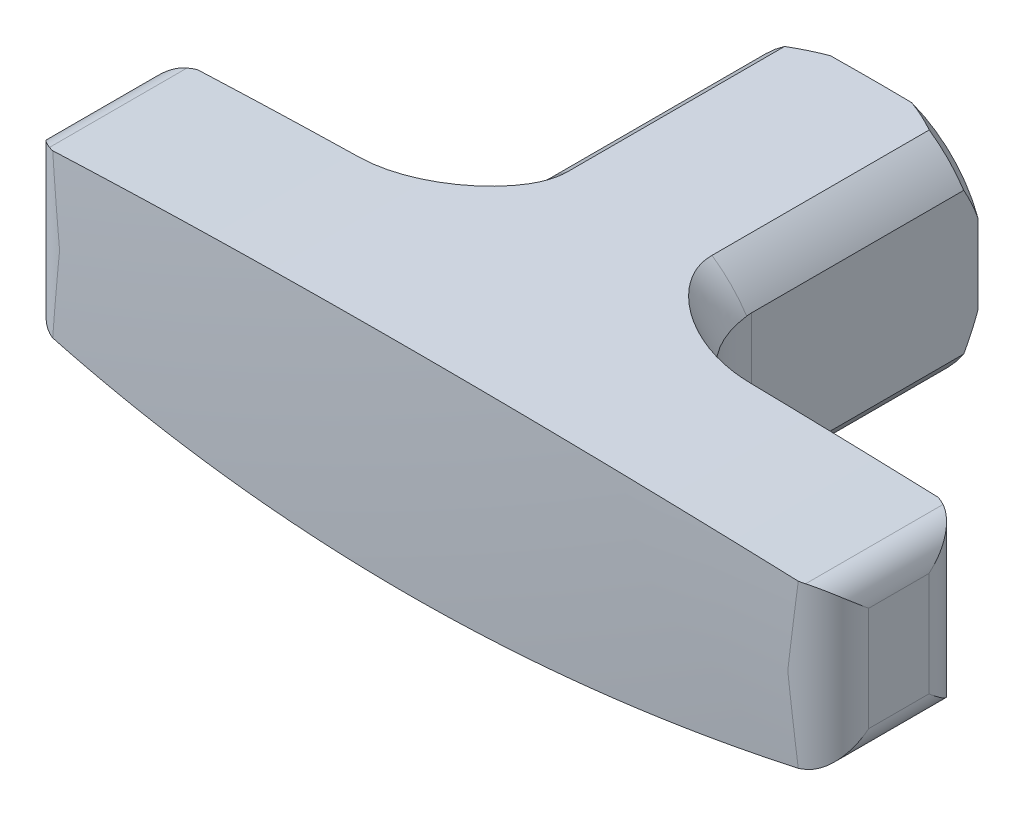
ISO-10303-21;
HEADER;
FILE_DESCRIPTION(('STEP AP214'),'2;1');
FILE_NAME('part.step','',(''),(''),'','','');
FILE_SCHEMA(('AUTOMOTIVE_DESIGN { 1 0 10303 214 1 1 1 1 }'));
ENDSEC;
DATA;
#1=APPLICATION_CONTEXT('core data for automotive mechanical design processes');
#2=APPLICATION_PROTOCOL_DEFINITION('international standard','automotive_design',2000,#1);
#3=PRODUCT_CONTEXT('',#1,'mechanical');
#4=PRODUCT('Part','Part','',(#3));
#5=PRODUCT_RELATED_PRODUCT_CATEGORY('part','',(#4));
#6=PRODUCT_DEFINITION_FORMATION('','',#4);
#7=PRODUCT_DEFINITION_CONTEXT('part definition',#1,'design');
#8=PRODUCT_DEFINITION('design','',#6,#7);
#9=PRODUCT_DEFINITION_SHAPE('','',#8);
#10=(LENGTH_UNIT() NAMED_UNIT(*) SI_UNIT(.MILLI.,.METRE.));
#11=(NAMED_UNIT(*) PLANE_ANGLE_UNIT() SI_UNIT($,.RADIAN.));
#12=(NAMED_UNIT(*) SI_UNIT($,.STERADIAN.) SOLID_ANGLE_UNIT());
#13=UNCERTAINTY_MEASURE_WITH_UNIT(LENGTH_MEASURE(1.E-05),#10,'distance_accuracy_value','');
#14=(GEOMETRIC_REPRESENTATION_CONTEXT(3) GLOBAL_UNCERTAINTY_ASSIGNED_CONTEXT((#13)) GLOBAL_UNIT_ASSIGNED_CONTEXT((#10,
#11,#12)) REPRESENTATION_CONTEXT('',''));
#15=CARTESIAN_POINT('',(0.,0.,0.));
#16=DIRECTION('',(0.,0.,1.));
#17=DIRECTION('',(1.,0.,0.));
#18=AXIS2_PLACEMENT_3D('',#15,#16,#17);
#19=CARTESIAN_POINT('',(-9.92261828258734E-13,0.,-229.835000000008));
#20=DIRECTION('',(0.,0.,-1.));
#21=DIRECTION('',(1.,0.,0.));
#22=AXIS2_PLACEMENT_3D('',#19,#20,#21);
#23=SPHERICAL_SURFACE('',#22,252.835000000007);
#24=CARTESIAN_POINT('',(-25.2498,-10.8950721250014,21.5000000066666));
#25=CARTESIAN_POINT('',(-25.2713311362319,-10.844823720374,21.500015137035));
#26=CARTESIAN_POINT('',(-25.2910180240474,-10.7938554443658,21.50022893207));
#27=CARTESIAN_POINT('',(-25.3275880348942,-10.6909777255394,21.5009434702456));
#28=CARTESIAN_POINT('',(-25.3444741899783,-10.6390693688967,21.5014439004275));
#29=CARTESIAN_POINT('',(-25.376335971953,-10.5348114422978,21.5026205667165));
#30=CARTESIAN_POINT('',(-25.3913156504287,-10.4824630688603,21.5032964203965));
#31=CARTESIAN_POINT('',(-25.4198241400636,-10.3773580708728,21.5047763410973));
#32=CARTESIAN_POINT('',(-25.4333524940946,-10.324601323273,21.5055804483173));
#33=CARTESIAN_POINT('',(-25.4721360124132,-10.1663138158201,21.508122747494));
#34=CARTESIAN_POINT('',(-25.4957036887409,-10.0603737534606,21.5099959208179));
#35=CARTESIAN_POINT('',(-25.5397410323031,-9.84780192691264,21.5139435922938));
#36=CARTESIAN_POINT('',(-25.5602087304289,-9.74116976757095,21.5160182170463));
#37=CARTESIAN_POINT('',(-25.5987530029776,-9.52771283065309,21.5202774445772));
#38=CARTESIAN_POINT('',(-25.61683455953,-9.42088894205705,21.5224618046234));
#39=CARTESIAN_POINT('',(-25.6511392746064,-9.20697378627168,21.5268898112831));
#40=CARTESIAN_POINT('',(-25.6673628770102,-9.09988258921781,21.5291334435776));
#41=CARTESIAN_POINT('',(-25.7138064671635,-8.77802255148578,21.5359027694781));
#42=CARTESIAN_POINT('',(-25.7417542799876,-8.56292685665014,21.5404615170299));
#43=CARTESIAN_POINT('',(-25.7967800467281,-8.10280288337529,21.5501004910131));
#44=CARTESIAN_POINT('',(-25.8232176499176,-7.85769952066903,21.5551668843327));
#45=CARTESIAN_POINT('',(-25.8717540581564,-7.36705401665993,21.565033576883));
#46=CARTESIAN_POINT('',(-25.8938526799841,-7.12151185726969,21.5698338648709));
#47=CARTESIAN_POINT('',(-25.9549471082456,-6.38437710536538,21.5836964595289));
#48=CARTESIAN_POINT('',(-25.9887340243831,-5.89234313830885,21.5922190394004));
#49=CARTESIAN_POINT('',(-26.0461474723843,-4.90774656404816,21.6074241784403));
#50=CARTESIAN_POINT('',(-26.0697752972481,-4.41518403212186,21.6141069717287));
#51=CARTESIAN_POINT('',(-26.1086786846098,-3.42975444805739,21.6254423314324));
#52=CARTESIAN_POINT('',(-26.123955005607,-2.93688742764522,21.6300950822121));
#53=CARTESIAN_POINT('',(-26.1472170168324,-1.94848067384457,21.6372833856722));
#54=CARTESIAN_POINT('',(-26.1551655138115,-1.45294000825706,21.639808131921));
#55=CARTESIAN_POINT('',(-26.1641023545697,-0.461781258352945,21.6426518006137));
#56=CARTESIAN_POINT('',(-26.1650905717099,0.0338368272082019,21.642970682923));
#57=CARTESIAN_POINT('',(-26.1601606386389,1.02516039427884,21.6413965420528));
#58=CARTESIAN_POINT('',(-26.1542407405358,1.52086586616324,21.639502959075));
#59=CARTESIAN_POINT('',(-26.135156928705,2.51212333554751,21.6335383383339));
#60=CARTESIAN_POINT('',(-26.1219931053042,3.007675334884,21.6294673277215));
#61=CARTESIAN_POINT('',(-26.093954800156,3.81472595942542,21.6211350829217));
#62=CARTESIAN_POINT('',(-26.0815257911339,4.12631712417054,21.6175044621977));
#63=CARTESIAN_POINT('',(-26.0531038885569,4.74929398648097,21.6094559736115));
#64=CARTESIAN_POINT('',(-26.037111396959,5.06067970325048,21.6050381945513));
#65=CARTESIAN_POINT('',(-26.0010581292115,5.68286120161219,21.5954760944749));
#66=CARTESIAN_POINT('',(-25.9810018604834,5.99365725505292,21.5903325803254));
#67=CARTESIAN_POINT('',(-25.9360183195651,6.61500354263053,21.579396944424));
#68=CARTESIAN_POINT('',(-25.9110893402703,6.92555365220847,21.573604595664));
#69=CARTESIAN_POINT('',(-25.8691604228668,7.38996807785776,21.5645546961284));
#70=CARTESIAN_POINT('',(-25.8544823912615,7.5440465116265,21.5614882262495));
#71=CARTESIAN_POINT('',(-25.8233592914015,7.85201126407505,21.5552568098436));
#72=CARTESIAN_POINT('',(-25.8069143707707,8.00589759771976,21.5520918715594));
#73=CARTESIAN_POINT('',(-25.7719532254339,8.31327530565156,21.5457013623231));
#74=CARTESIAN_POINT('',(-25.7534391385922,8.46676692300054,21.5424758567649));
#75=CARTESIAN_POINT('',(-25.7138616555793,8.77346999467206,21.5360100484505));
#76=CARTESIAN_POINT('',(-25.6927975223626,8.92668135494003,21.532769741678));
#77=CARTESIAN_POINT('',(-25.6473289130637,9.23325880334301,21.5263391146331));
#78=CARTESIAN_POINT('',(-25.6229110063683,9.38662291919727,21.5231490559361));
#79=CARTESIAN_POINT('',(-25.5696915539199,9.69249476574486,21.5169598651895));
#80=CARTESIAN_POINT('',(-25.5408934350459,9.84500307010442,21.5139605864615));
#81=CARTESIAN_POINT('',(-25.4926565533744,10.0730244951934,21.5097869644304));
#82=CARTESIAN_POINT('',(-25.4756994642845,10.1490562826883,21.5084476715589));
#83=CARTESIAN_POINT('',(-25.4395890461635,10.3005659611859,21.5059416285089));
#84=CARTESIAN_POINT('',(-25.4204367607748,10.376044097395,21.504774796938));
#85=CARTESIAN_POINT('',(-25.3790551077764,10.5264044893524,21.5027044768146));
#86=CARTESIAN_POINT('',(-25.356817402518,10.6012845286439,21.5018017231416));
#87=CARTESIAN_POINT('',(-25.3199675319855,10.7125292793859,21.5007907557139));
#88=CARTESIAN_POINT('',(-25.3070905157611,10.7494602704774,21.5005108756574));
#89=CARTESIAN_POINT('',(-25.2797442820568,10.8227533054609,21.5001175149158));
#90=CARTESIAN_POINT('',(-25.2652740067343,10.8591149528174,21.5000041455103));
#91=CARTESIAN_POINT('',(-25.2498,10.8950721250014,21.5000000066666));
#92=B_SPLINE_CURVE_WITH_KNOTS('',3,(#24,#25,#26,#27,#28,#29,#30,#31,#32,#33,#34,#35,#36,#37,#38,
#39,#40,#41,#42,#43,#44,#45,#46,#47,#48,#49,#50,#51,#52,#53,#54,#55,#56,#57,#58,#59,#60,#61,#62,
#63,#64,#65,#66,#67,#68,#69,#70,#71,#72,#73,#74,#75,#76,#77,#78,#79,#80,#81,#82,#83,#84,#85,#86,
#87,#88,#89,#90,#91),.UNSPECIFIED.,.F.,.F.,(4,2,2,2,2,2,2,2,2,2,2,2,2,2,2,2,2,2,2,2,2,2,2,2,2,2,
2,2,2,2,2,2,2,4),(0.,0.163873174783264,0.327567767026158,0.490908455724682,0.654300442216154,
0.979860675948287,1.30562684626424,1.63070169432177,1.95569871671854,2.60648297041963,
3.34616696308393,4.08588218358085,5.56551452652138,7.04495849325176,8.5242680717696,
10.0110453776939,11.4978497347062,12.9850303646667,14.4721924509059,15.4077551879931,
16.3432124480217,17.2776377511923,18.2123910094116,18.6768021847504,19.1411745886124,
19.6050715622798,20.0691029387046,20.5350499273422,21.0006342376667,21.2343434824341,
21.4679420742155,21.7021846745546,21.8194906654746,21.9368750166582),.UNSPECIFIED.);
#93=CARTESIAN_POINT('',(-25.9984396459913,-5.71347822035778,21.5948600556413));
#94=VERTEX_POINT('',#93);
#95=CARTESIAN_POINT('',(-25.9984396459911,5.71347822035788,21.5948600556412));
#96=VERTEX_POINT('',#95);
#97=EDGE_CURVE('E365',#94,#96,#92,.T.);
#98=ORIENTED_EDGE('',*,*,#97,.T.);
#99=CARTESIAN_POINT('',(-26.5293588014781,5.63940310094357,21.5410678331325));
#100=CARTESIAN_POINT('',(-25.4640024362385,5.78957881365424,21.6501338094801));
#101=CARTESIAN_POINT('',(-24.3967092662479,5.93079648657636,21.7526249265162));
#102=CARTESIAN_POINT('',(-22.2591784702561,6.19514454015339,21.9443769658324));
#103=CARTESIAN_POINT('',(-21.1889423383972,6.31828281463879,22.033643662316));
#104=CARTESIAN_POINT('',(-19.045520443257,6.54643263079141,22.1989620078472));
#105=CARTESIAN_POINT('',(-17.9723346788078,6.65144416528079,22.2750136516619));
#106=CARTESIAN_POINT('',(-15.8230106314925,6.84329292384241,22.413901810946));
#107=CARTESIAN_POINT('',(-14.7468712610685,6.93012216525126,22.4767325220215));
#108=CARTESIAN_POINT('',(-13.6697239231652,7.00779043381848,22.5329194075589));
#109=B_SPLINE_CURVE_WITH_KNOTS('',3,(#99,#100,#101,#102,#103,#104,#105,#106,#107,#108),
.UNSPECIFIED.,.F.,.F.,(4,2,2,2,4),(0.,3.24415139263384,6.48688208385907,9.72961405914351,
12.9737667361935),.UNSPECIFIED.);
#110=CARTESIAN_POINT('',(-13.6735574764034,7.00751396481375,22.532719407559));
#111=VERTEX_POINT('',#110);
#112=EDGE_CURVE('E354',#96,#111,#109,.T.);
#113=ORIENTED_EDGE('',*,*,#112,.T.);
#114=CARTESIAN_POINT('',(0.,0.,22.532719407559));
#115=DIRECTION('',(0.,0.,-1.));
#116=DIRECTION('',(0.,1.,0.));
#117=AXIS2_PLACEMENT_3D('',#114,#115,#116);
#118=CIRCLE('',#117,15.3646160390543);
#119=CARTESIAN_POINT('',(-13.6735574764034,-7.00751396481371,22.532719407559));
#120=VERTEX_POINT('',#119);
#121=EDGE_CURVE('E536',#120,#111,#118,.T.);
#122=ORIENTED_EDGE('',*,*,#121,.F.);
#123=CARTESIAN_POINT('',(-13.6697239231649,-7.00779043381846,22.532919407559));
#124=CARTESIAN_POINT('',(-14.7468712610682,-6.93012216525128,22.4767325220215));
#125=CARTESIAN_POINT('',(-15.8230106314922,-6.84329292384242,22.413901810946));
#126=CARTESIAN_POINT('',(-17.9723346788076,-6.65144416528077,22.275013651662));
#127=CARTESIAN_POINT('',(-19.0455204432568,-6.54643263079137,22.1989620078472));
#128=CARTESIAN_POINT('',(-21.1889423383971,-6.31828281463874,22.033643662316));
#129=CARTESIAN_POINT('',(-22.259178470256,-6.19514454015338,21.9443769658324));
#130=CARTESIAN_POINT('',(-24.3967092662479,-5.93079648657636,21.7526249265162));
#131=CARTESIAN_POINT('',(-25.4640024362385,-5.78957881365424,21.6501338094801));
#132=CARTESIAN_POINT('',(-26.5293588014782,-5.6394031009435,21.5410678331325));
#133=B_SPLINE_CURVE_WITH_KNOTS('',3,(#123,#124,#125,#126,#127,#128,#129,#130,#131,#132),
.UNSPECIFIED.,.F.,.F.,(4,2,2,2,4),(0.,3.24415267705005,6.4868846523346,9.72961534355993,
12.9737667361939),.UNSPECIFIED.);
#134=EDGE_CURVE('E330',#120,#94,#133,.T.);
#135=ORIENTED_EDGE('',*,*,#134,.T.);
#136=EDGE_LOOP('',(#98,#113,#122,#135));
#137=FACE_BOUND('',#136,.T.);
#138=ADVANCED_FACE('F14',(#137),#23,.F.);
#139=CARTESIAN_POINT('',(0.,0.,16.5438083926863));
#140=DIRECTION('',(0.,0.,-1.));
#141=DIRECTION('',(0.,1.,0.));
#142=AXIS2_PLACEMENT_3D('',#139,#140,#141);
#143=TOROIDAL_SURFACE('',#142,15.,6.);
#144=ORIENTED_EDGE('',*,*,#121,.T.);
#145=CARTESIAN_POINT('',(-15.3648160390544,6.87793772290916,22.2566395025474));
#146=CARTESIAN_POINT('',(-15.1174601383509,6.89800716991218,22.3265203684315));
#147=CARTESIAN_POINT('',(-14.866524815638,6.91786447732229,22.3832956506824));
#148=CARTESIAN_POINT('',(-14.3604248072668,6.95688789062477,22.4713471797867));
#149=CARTESIAN_POINT('',(-14.1052649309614,6.97605471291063,22.5026506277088));
#150=CARTESIAN_POINT('',(-13.5951706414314,7.01332327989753,22.5404636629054));
#151=CARTESIAN_POINT('',(-13.3402510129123,7.03143236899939,22.5471712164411));
#152=CARTESIAN_POINT('',(-12.8307656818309,7.06659241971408,22.5373328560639));
#153=CARTESIAN_POINT('',(-12.5762000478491,7.08364319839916,22.5207829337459));
#154=CARTESIAN_POINT('',(-12.1002489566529,7.11456655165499,22.4688686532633));
#155=CARTESIAN_POINT('',(-11.8785912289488,7.12857353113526,22.4360354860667));
#156=CARTESIAN_POINT('',(-11.4383507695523,7.15562904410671,22.3540590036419));
#157=CARTESIAN_POINT('',(-11.2197675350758,7.16867773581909,22.3049183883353));
#158=CARTESIAN_POINT('',(-10.5690963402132,7.20640662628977,22.1338826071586));
#159=CARTESIAN_POINT('',(-10.142824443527,7.22962194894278,21.9884579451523));
#160=CARTESIAN_POINT('',(-9.48727152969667,7.26322443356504,21.7135548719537));
#161=CARTESIAN_POINT('',(-9.24994355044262,7.27492511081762,21.6026975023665));
#162=CARTESIAN_POINT('',(-8.78457111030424,7.29702797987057,21.3625666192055));
#163=CARTESIAN_POINT('',(-8.55652896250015,7.30742984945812,21.2332885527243));
#164=CARTESIAN_POINT('',(-8.11153583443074,7.32696094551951,20.9571177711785));
#165=CARTESIAN_POINT('',(-7.89457799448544,7.33609096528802,20.8102361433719));
#166=CARTESIAN_POINT('',(-7.47348291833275,7.35312866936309,20.4991283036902));
#167=CARTESIAN_POINT('',(-7.26933986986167,7.36103691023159,20.3349100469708));
#168=CARTESIAN_POINT('',(-6.95067084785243,7.37290407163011,20.0542969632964));
#169=CARTESIAN_POINT('',(-6.83141340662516,7.37722665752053,19.9432595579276));
#170=CARTESIAN_POINT('',(-6.59975825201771,7.38541676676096,19.7142425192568));
#171=CARTESIAN_POINT('',(-6.48735899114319,7.38928439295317,19.5962644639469));
#172=CARTESIAN_POINT('',(-6.27061503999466,7.39656286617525,19.353179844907));
#173=CARTESIAN_POINT('',(-6.16626698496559,7.39997390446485,19.2280762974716));
#174=CARTESIAN_POINT('',(-5.96716491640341,7.4063322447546,18.9704360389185));
#175=CARTESIAN_POINT('',(-5.87240784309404,7.40927969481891,18.8379017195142));
#176=CARTESIAN_POINT('',(-5.72006328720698,7.41391762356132,18.6042155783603));
#177=CARTESIAN_POINT('',(-5.65960006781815,7.41572640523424,18.5049396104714));
#178=CARTESIAN_POINT('',(-5.54559770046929,7.41908833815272,18.3024219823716));
#179=CARTESIAN_POINT('',(-5.49206026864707,7.42064142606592,18.1991793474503));
#180=CARTESIAN_POINT('',(-5.39327191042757,7.42347143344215,17.9892854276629));
#181=CARTESIAN_POINT('',(-5.3479884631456,7.4247494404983,17.8826495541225));
#182=CARTESIAN_POINT('',(-5.26672367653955,7.42701957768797,17.6659317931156));
#183=CARTESIAN_POINT('',(-5.23073530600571,7.42801192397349,17.5558525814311));
#184=CARTESIAN_POINT('',(-5.17989407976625,7.42940340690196,17.3713174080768));
#185=CARTESIAN_POINT('',(-5.16203380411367,7.42988906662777,17.2976825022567));
#186=CARTESIAN_POINT('',(-5.13113540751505,7.43072603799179,17.1494175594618));
#187=CARTESIAN_POINT('',(-5.11809603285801,7.43107738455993,17.0747877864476));
#188=CARTESIAN_POINT('',(-5.09702218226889,7.43164394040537,16.9242825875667));
#189=CARTESIAN_POINT('',(-5.08902375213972,7.43185816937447,16.8484020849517));
#190=CARTESIAN_POINT('',(-5.07832091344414,7.43214441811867,16.6962202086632));
#191=CARTESIAN_POINT('',(-5.07561994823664,7.43221634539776,16.6199185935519));
#192=CARTESIAN_POINT('',(-5.07564444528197,7.43221592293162,16.5436083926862));
#193=B_SPLINE_CURVE_WITH_KNOTS('',3,(#145,#146,#147,#148,#149,#150,#151,#152,#153,#154,#155,
#156,#157,#158,#159,#160,#161,#162,#163,#164,#165,#166,#167,#168,#169,#170,#171,#172,#173,#174,
#175,#176,#177,#178,#179,#180,#181,#182,#183,#184,#185,#186,#187,#188,#189,#190,#191,#192),
.UNSPECIFIED.,.F.,.F.,(4,2,2,2,2,2,2,2,2,2,2,2,2,2,2,2,2,2,2,2,2,2,2,4),(0.,0.772911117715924,
1.54499576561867,2.31085228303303,3.07684081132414,3.74973077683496,4.42250939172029,
5.77027809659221,6.55624635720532,7.34240921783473,8.12807950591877,8.91339083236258,
9.40215808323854,9.89081463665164,10.379265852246,10.8675607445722,11.2160882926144,
11.5647020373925,11.9119110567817,12.2588566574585,12.4860295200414,12.7131432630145,
12.941863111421,13.1707315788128),.UNSPECIFIED.);
#194=CARTESIAN_POINT('',(-5.07564443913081,7.43221592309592,16.5438083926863));
#195=VERTEX_POINT('',#194);
#196=EDGE_CURVE('E480',#111,#195,#193,.T.);
#197=ORIENTED_EDGE('',*,*,#196,.T.);
#198=CARTESIAN_POINT('',(0.,0.,16.5438083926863));
#199=DIRECTION('',(0.,0.,-1.));
#200=DIRECTION('',(0.,1.,0.));
#201=AXIS2_PLACEMENT_3D('',#198,#199,#200);
#202=CIRCLE('',#201,9.);
#203=CARTESIAN_POINT('',(-7.51059243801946,4.95893146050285,16.5438083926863));
#204=VERTEX_POINT('',#203);
#205=EDGE_CURVE('E545',#204,#195,#202,.T.);
#206=ORIENTED_EDGE('',*,*,#205,.F.);
#207=CARTESIAN_POINT('',(-7.51058054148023,-4.95894948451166,16.5436083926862));
#208=CARTESIAN_POINT('',(-7.520449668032,-4.94393890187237,16.709966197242));
#209=CARTESIAN_POINT('',(-7.53730546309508,-4.93090967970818,16.8760761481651));
#210=CARTESIAN_POINT('',(-7.58482718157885,-4.90831468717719,17.2065158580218));
#211=CARTESIAN_POINT('',(-7.61549044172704,-4.89874824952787,17.3708459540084));
#212=CARTESIAN_POINT('',(-7.69040149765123,-4.88258846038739,17.69621855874));
#213=CARTESIAN_POINT('',(-7.73462516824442,-4.87598987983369,17.8572663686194));
#214=CARTESIAN_POINT('',(-7.83636765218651,-4.8651022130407,18.1751842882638));
#215=CARTESIAN_POINT('',(-7.89388653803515,-4.86081313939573,18.3320543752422));
#216=CARTESIAN_POINT('',(-8.0218134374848,-4.85378236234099,18.6404694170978));
#217=CARTESIAN_POINT('',(-8.09222064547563,-4.85104056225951,18.7920147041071));
#218=CARTESIAN_POINT('',(-8.24543304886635,-4.84618055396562,19.0887179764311));
#219=CARTESIAN_POINT('',(-8.3282385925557,-4.84406236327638,19.2338757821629));
#220=CARTESIAN_POINT('',(-8.50569258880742,-4.83931872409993,19.5168252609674));
#221=CARTESIAN_POINT('',(-8.60034531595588,-4.83669309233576,19.6546142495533));
#222=CARTESIAN_POINT('',(-8.80077973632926,-4.82952356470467,19.9217694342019));
#223=CARTESIAN_POINT('',(-8.90655922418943,-4.82498004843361,20.0511372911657));
#224=CARTESIAN_POINT('',(-9.10771117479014,-4.8133436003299,20.2772131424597));
#225=CARTESIAN_POINT('',(-9.20134040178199,-4.80688488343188,20.3755098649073));
#226=CARTESIAN_POINT('',(-9.39487039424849,-4.79021742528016,20.5653723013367));
#227=CARTESIAN_POINT('',(-9.49476995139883,-4.78000940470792,20.6569393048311));
#228=CARTESIAN_POINT('',(-9.70001531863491,-4.75424638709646,20.8326921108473));
#229=CARTESIAN_POINT('',(-9.80535422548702,-4.7386980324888,20.9168869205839));
#230=CARTESIAN_POINT('',(-10.020579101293,-4.7001940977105,21.0773923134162));
#231=CARTESIAN_POINT('',(-10.1304626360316,-4.67724243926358,21.1537070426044));
#232=CARTESIAN_POINT('',(-10.3114743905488,-4.63183770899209,21.2707671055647));
#233=CARTESIAN_POINT('',(-10.381686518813,-4.61242408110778,21.3141207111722));
#234=CARTESIAN_POINT('',(-10.5227535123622,-4.56897802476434,21.3973074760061));
#235=CARTESIAN_POINT('',(-10.593608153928,-4.5449471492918,21.4371418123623));
#236=CARTESIAN_POINT('',(-10.7351791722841,-4.49157490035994,21.5130598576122));
#237=CARTESIAN_POINT('',(-10.8058955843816,-4.46224235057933,21.5491496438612));
#238=CARTESIAN_POINT('',(-10.9464111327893,-4.39758597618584,21.6174771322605));
#239=CARTESIAN_POINT('',(-11.0162107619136,-4.36226552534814,21.6497169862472));
#240=CARTESIAN_POINT('',(-11.1548326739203,-4.28461847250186,21.7106654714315));
#241=CARTESIAN_POINT('',(-11.2236298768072,-4.2422055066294,21.7393218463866));
#242=CARTESIAN_POINT('',(-11.3581631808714,-4.15052086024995,21.7925977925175));
#243=CARTESIAN_POINT('',(-11.4238992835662,-4.1012491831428,21.8172173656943));
#244=CARTESIAN_POINT('',(-11.5512851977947,-3.99606212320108,21.8625707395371));
#245=CARTESIAN_POINT('',(-11.6129344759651,-3.94014587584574,21.8833040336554));
#246=CARTESIAN_POINT('',(-11.7313489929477,-3.82229933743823,21.9211789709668));
#247=CARTESIAN_POINT('',(-11.7881153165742,-3.76037038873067,21.9383214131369));
#248=CARTESIAN_POINT('',(-11.8998191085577,-3.62722285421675,21.9704358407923));
#249=CARTESIAN_POINT('',(-11.9544093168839,-3.55566374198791,21.9851998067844));
#250=CARTESIAN_POINT('',(-12.0575358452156,-3.40781695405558,22.0117117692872));
#251=CARTESIAN_POINT('',(-12.1060712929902,-3.33152859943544,22.0234593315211));
#252=CARTESIAN_POINT('',(-12.2431499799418,-3.09679743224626,22.055086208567));
#253=CARTESIAN_POINT('',(-12.322966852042,-2.93273394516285,22.0712962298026));
#254=CARTESIAN_POINT('',(-12.4534206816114,-2.6186810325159,22.0957741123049));
#255=CARTESIAN_POINT('',(-12.5065267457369,-2.46972209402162,22.1048115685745));
#256=CARTESIAN_POINT('',(-12.6002734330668,-2.16768563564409,22.1197893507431));
#257=CARTESIAN_POINT('',(-12.640904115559,-2.01460493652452,22.1257272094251));
#258=CARTESIAN_POINT('',(-12.7115554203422,-1.70540696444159,22.1355190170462));
#259=CARTESIAN_POINT('',(-12.7415362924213,-1.54928056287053,22.1393651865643));
#260=CARTESIAN_POINT('',(-12.7919695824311,-1.23545164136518,22.1455730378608));
#261=CARTESIAN_POINT('',(-12.8124192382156,-1.07774867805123,22.1479342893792));
#262=CARTESIAN_POINT('',(-12.8540166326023,-0.669377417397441,22.1526246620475));
#263=CARTESIAN_POINT('',(-12.8686437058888,-0.418021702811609,22.154135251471));
#264=CARTESIAN_POINT('',(-12.877643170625,0.0852629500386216,22.1550773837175));
#265=CARTESIAN_POINT('',(-12.8719955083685,0.337192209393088,22.1545068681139));
#266=CARTESIAN_POINT('',(-12.8399169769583,0.838684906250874,22.1510446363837));
#267=CARTESIAN_POINT('',(-12.8135731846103,1.08825383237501,22.1481626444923));
#268=CARTESIAN_POINT('',(-12.7376558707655,1.58358291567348,22.1389444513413));
#269=CARTESIAN_POINT('',(-12.68811837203,1.82934837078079,22.1326136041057));
#270=CARTESIAN_POINT('',(-12.575982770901,2.25442959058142,22.1160619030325));
#271=CARTESIAN_POINT('',(-12.5194801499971,2.43538525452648,22.1071595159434));
#272=CARTESIAN_POINT('',(-12.3862994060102,2.78974541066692,22.0835713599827));
#273=CARTESIAN_POINT('',(-12.3096189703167,2.96314903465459,22.0688849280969));
#274=CARTESIAN_POINT('',(-12.1756425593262,3.21424337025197,22.039634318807));
#275=CARTESIAN_POINT('',(-12.1273074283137,3.2971349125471,22.0285487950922));
#276=CARTESIAN_POINT('',(-12.0239316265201,3.45817059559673,22.0032883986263));
#277=CARTESIAN_POINT('',(-11.9688915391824,3.53631514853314,21.9891137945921));
#278=CARTESIAN_POINT('',(-11.8522121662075,3.68626806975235,21.9570542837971));
#279=CARTESIAN_POINT('',(-11.790597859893,3.75809865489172,21.9391831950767));
#280=CARTESIAN_POINT('',(-11.6610633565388,3.89444538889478,21.8990898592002));
#281=CARTESIAN_POINT('',(-11.5931450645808,3.95896373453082,21.8768689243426));
#282=CARTESIAN_POINT('',(-11.4023161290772,4.12201415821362,21.8102346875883));
#283=CARTESIAN_POINT('',(-11.2742010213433,4.21272750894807,21.7611772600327));
#284=CARTESIAN_POINT('',(-11.0095172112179,4.36930486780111,21.6480478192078));
#285=CARTESIAN_POINT('',(-10.8729275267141,4.43510408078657,21.5839373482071));
#286=CARTESIAN_POINT('',(-10.6456610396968,4.52677334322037,21.4660014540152));
#287=CARTESIAN_POINT('',(-10.555209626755,4.55860815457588,21.4161228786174));
#288=CARTESIAN_POINT('',(-10.3752785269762,4.61472114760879,21.3106219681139));
#289=CARTESIAN_POINT('',(-10.2857992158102,4.63899650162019,21.2549974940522));
#290=CARTESIAN_POINT('',(-10.1087736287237,4.68147331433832,21.1382860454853));
#291=CARTESIAN_POINT('',(-10.0212313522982,4.69966313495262,21.077188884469));
#292=CARTESIAN_POINT('',(-9.84897422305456,4.73121430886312,20.949950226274));
#293=CARTESIAN_POINT('',(-9.76426023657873,4.74457419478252,20.8838072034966));
#294=CARTESIAN_POINT('',(-9.55970904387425,4.77289500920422,20.7150147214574));
#295=CARTESIAN_POINT('',(-9.44180066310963,4.78572561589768,20.609659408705));
#296=CARTESIAN_POINT('',(-9.2144338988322,4.80610193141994,20.389699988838));
#297=CARTESIAN_POINT('',(-9.10497882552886,4.8136455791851,20.2750922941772));
#298=CARTESIAN_POINT('',(-8.89541553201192,4.82545472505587,20.0374926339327));
#299=CARTESIAN_POINT('',(-8.79530666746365,4.82972044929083,19.9145012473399));
#300=CARTESIAN_POINT('',(-8.60508015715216,4.83652261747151,19.6608983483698));
#301=CARTESIAN_POINT('',(-8.51496696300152,4.83905829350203,19.5302834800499));
#302=CARTESIAN_POINT('',(-8.34375631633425,4.84365844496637,19.2597788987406));
#303=CARTESIAN_POINT('',(-8.26286215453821,4.8457130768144,19.1197603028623));
#304=CARTESIAN_POINT('',(-8.11267204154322,4.85032577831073,18.833718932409));
#305=CARTESIAN_POINT('',(-8.04337119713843,4.85288363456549,18.6876987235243));
#306=CARTESIAN_POINT('',(-7.91682917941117,4.85935314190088,18.3906757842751));
#307=CARTESIAN_POINT('',(-7.85957913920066,4.86326379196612,18.2396768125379));
#308=CARTESIAN_POINT('',(-7.75746428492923,4.87314210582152,17.9336672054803));
#309=CARTESIAN_POINT('',(-7.71259569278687,4.8791091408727,17.7786578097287));
#310=CARTESIAN_POINT('',(-7.63044870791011,4.89465822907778,17.4450549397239));
#311=CARTESIAN_POINT('',(-7.59494262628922,4.90461229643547,17.2660391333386));
#312=CARTESIAN_POINT('',(-7.54039097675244,4.92857602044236,16.9059788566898));
#313=CARTESIAN_POINT('',(-7.52132832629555,4.94258144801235,16.7249366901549));
#314=CARTESIAN_POINT('',(-7.51058054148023,4.95894948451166,16.5436083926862));
#315=B_SPLINE_CURVE_WITH_KNOTS('',3,(#207,#208,#209,#210,#211,#212,#213,#214,#215,#216,#217,
#218,#219,#220,#221,#222,#223,#224,#225,#226,#227,#228,#229,#230,#231,#232,#233,#234,#235,#236,
#237,#238,#239,#240,#241,#242,#243,#244,#245,#246,#247,#248,#249,#250,#251,#252,#253,#254,#255,
#256,#257,#258,#259,#260,#261,#262,#263,#264,#265,#266,#267,#268,#269,#270,#271,#272,#273,#274,
#275,#276,#277,#278,#279,#280,#281,#282,#283,#284,#285,#286,#287,#288,#289,#290,#291,#292,#293,
#294,#295,#296,#297,#298,#299,#300,#301,#302,#303,#304,#305,#306,#307,#308,#309,#310,#311,#312,
#313,#314),.UNSPECIFIED.,.F.,.F.,(4,2,2,2,2,2,2,2,2,2,2,2,2,2,2,2,2,2,2,2,2,2,2,2,2,2,2,2,2,2,2,
2,2,2,2,2,2,2,2,2,2,2,2,2,2,2,2,2,2,2,2,2,2,4),(0.,0.501802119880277,1.00350749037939,
1.50432541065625,2.00514606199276,2.50593541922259,3.00673884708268,3.50772349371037,
4.00860902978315,4.41599502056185,4.82330274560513,5.23010567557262,5.63669346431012,
5.89083912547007,6.14489945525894,6.39854077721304,6.65203966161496,6.90888627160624,
7.16573275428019,7.4226126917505,7.67943541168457,7.95262969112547,8.22586328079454,
8.77327913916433,9.24788464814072,9.72286735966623,10.1996047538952,10.6764802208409,
11.430900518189,12.1860672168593,12.9380735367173,13.6889157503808,14.257371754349,
14.8258929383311,15.1153473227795,15.4047765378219,15.6931427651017,15.9814221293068,
16.471570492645,16.9629849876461,17.2868386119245,17.6108132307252,17.9354039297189,
18.2600931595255,18.7353441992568,19.210780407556,19.686183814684,20.161798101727,
20.6464284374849,21.1308537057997,21.6149212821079,22.0988409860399,22.64635422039,
23.1932979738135),.UNSPECIFIED.);
#316=CARTESIAN_POINT('',(-7.51059243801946,-4.95893146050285,16.5438083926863));
#317=VERTEX_POINT('',#316);
#318=EDGE_CURVE('E582',#317,#204,#315,.T.);
#319=ORIENTED_EDGE('',*,*,#318,.F.);
#320=CARTESIAN_POINT('',(-5.07564443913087,-7.43221592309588,16.5438083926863));
#321=VERTEX_POINT('',#320);
#322=EDGE_CURVE('E543',#321,#317,#202,.T.);
#323=ORIENTED_EDGE('',*,*,#322,.F.);
#324=CARTESIAN_POINT('',(-5.07564444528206,-7.43221592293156,16.5436083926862));
#325=CARTESIAN_POINT('',(-5.07557701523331,-7.43221700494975,16.6459869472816));
#326=CARTESIAN_POINT('',(-5.08046529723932,-7.4320871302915,16.7483304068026));
#327=CARTESIAN_POINT('',(-5.09967706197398,-7.43157281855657,16.9519710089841));
#328=CARTESIAN_POINT('',(-5.11398572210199,-7.43118878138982,17.0532695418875));
#329=CARTESIAN_POINT('',(-5.15131086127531,-7.43018031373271,17.2528135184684));
#330=CARTESIAN_POINT('',(-5.17420707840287,-7.42955920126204,17.3510817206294));
#331=CARTESIAN_POINT('',(-5.22798103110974,-7.42808715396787,17.5454328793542));
#332=CARTESIAN_POINT('',(-5.25886241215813,-7.42723611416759,17.6415148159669));
#333=CARTESIAN_POINT('',(-5.33944932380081,-7.42499086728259,17.8631538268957));
#334=CARTESIAN_POINT('',(-5.39198848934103,-7.42351031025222,17.9876809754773));
#335=CARTESIAN_POINT('',(-5.50790137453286,-7.4201852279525,18.2315598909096));
#336=CARTESIAN_POINT('',(-5.57127873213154,-7.41834058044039,18.3509099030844));
#337=CARTESIAN_POINT('',(-5.70753890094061,-7.41429596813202,18.5850442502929));
#338=CARTESIAN_POINT('',(-5.78048026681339,-7.41209379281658,18.6997942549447));
#339=CARTESIAN_POINT('',(-5.93409935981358,-7.40735748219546,18.9240064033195));
#340=CARTESIAN_POINT('',(-6.01478006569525,-7.4048232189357,19.03346648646));
#341=CARTESIAN_POINT('',(-6.23579777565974,-7.39772740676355,19.3148479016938));
#342=CARTESIAN_POINT('',(-6.38159233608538,-7.39289739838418,19.4824889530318));
#343=CARTESIAN_POINT('',(-6.68694977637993,-7.38239357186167,19.8047243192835));
#344=CARTESIAN_POINT('',(-6.84652108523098,-7.37671923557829,19.9593105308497));
#345=CARTESIAN_POINT('',(-7.17690233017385,-7.3645227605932,20.2557681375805));
#346=CARTESIAN_POINT('',(-7.3477083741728,-7.3580009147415,20.3976438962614));
#347=CARTESIAN_POINT('',(-7.69887099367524,-7.34409007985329,20.6688689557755));
#348=CARTESIAN_POINT('',(-7.87922563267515,-7.33670126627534,20.7982207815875));
#349=CARTESIAN_POINT('',(-8.25872936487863,-7.32058580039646,21.0513157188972));
#350=CARTESIAN_POINT('',(-8.4583644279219,-7.31180709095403,21.1743267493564));
#351=CARTESIAN_POINT('',(-8.86578165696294,-7.29322008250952,21.4059479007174));
#352=CARTESIAN_POINT('',(-9.07356425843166,-7.2834117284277,21.5145572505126));
#353=CARTESIAN_POINT('',(-9.49628447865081,-7.26273661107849,21.7168277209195));
#354=CARTESIAN_POINT('',(-9.71122336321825,-7.25186965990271,21.8104861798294));
#355=CARTESIAN_POINT('',(-10.147324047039,-7.22905615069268,21.9821636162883));
#356=CARTESIAN_POINT('',(-10.368488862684,-7.2171090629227,22.0601748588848));
#357=CARTESIAN_POINT('',(-10.8572609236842,-7.18982740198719,22.2125845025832));
#358=CARTESIAN_POINT('',(-11.12590359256,-7.17427465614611,22.283656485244));
#359=CARTESIAN_POINT('',(-11.6683213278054,-7.14169015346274,22.4011563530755));
#360=CARTESIAN_POINT('',(-11.9420938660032,-7.12465911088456,22.4475960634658));
#361=CARTESIAN_POINT('',(-12.4922598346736,-7.08922084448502,22.5143501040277));
#362=CARTESIAN_POINT('',(-12.7686477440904,-7.07081611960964,22.5347107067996));
#363=CARTESIAN_POINT('',(-13.321859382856,-7.03275615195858,22.5480452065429));
#364=CARTESIAN_POINT('',(-13.5986826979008,-7.01310175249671,22.5410373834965));
#365=CARTESIAN_POINT('',(-14.1263357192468,-6.97448007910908,22.5002506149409));
#366=CARTESIAN_POINT('',(-14.3773518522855,-6.95559928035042,22.4688279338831));
#367=CARTESIAN_POINT('',(-14.8750003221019,-6.9171933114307,22.3813718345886));
#368=CARTESIAN_POINT('',(-15.121632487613,-6.89766811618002,22.3253374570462));
#369=CARTESIAN_POINT('',(-15.3648160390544,-6.87793772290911,22.2566395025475));
#370=B_SPLINE_CURVE_WITH_KNOTS('',3,(#324,#325,#326,#327,#328,#329,#330,#331,#332,#333,#334,
#335,#336,#337,#338,#339,#340,#341,#342,#343,#344,#345,#346,#347,#348,#349,#350,#351,#352,#353,
#354,#355,#356,#357,#358,#359,#360,#361,#362,#363,#364,#365,#366,#367,#368,#369),.UNSPECIFIED.,
.F.,.F.,(4,2,2,2,2,2,2,2,2,2,2,2,2,2,2,2,2,2,2,2,2,2,4),(0.,0.306962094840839,0.613442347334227,
0.915781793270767,1.21825951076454,1.62310871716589,2.0280940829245,2.43568606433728,
2.84343555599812,3.50906959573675,4.17511381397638,4.84092849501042,5.50660865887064,
6.20997425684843,6.91337749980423,7.61690583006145,8.32078108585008,9.1546153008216,
9.98804885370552,10.8200015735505,11.6513987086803,12.4112327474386,13.1710964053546),.UNSPECIFIED.);
#371=EDGE_CURVE('E324',#321,#120,#370,.T.);
#372=ORIENTED_EDGE('',*,*,#371,.T.);
#373=EDGE_LOOP('',(#144,#197,#206,#319,#323,#372));
#374=FACE_BOUND('',#373,.T.);
#375=ADVANCED_FACE('F634',(#374),#143,.F.);
#376=CARTESIAN_POINT('',(0.,0.,0.));
#377=DIRECTION('',(0.,0.,-1.));
#378=DIRECTION('',(0.,1.,0.));
#379=AXIS2_PLACEMENT_3D('',#376,#377,#378);
#380=CYLINDRICAL_SURFACE('',#379,9.);
#381=ORIENTED_EDGE('',*,*,#205,.T.);
#382=DIRECTION('',(0.,0.,-1.));
#383=VECTOR('',#382,1.);
#384=CARTESIAN_POINT('',(-5.0756444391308,7.4322159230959,0.));
#385=LINE('',#384,#383);
#386=CARTESIAN_POINT('',(-5.07564443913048,7.43221592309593,1.29999999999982));
#387=VERTEX_POINT('',#386);
#388=EDGE_CURVE('E486',#195,#387,#385,.T.);
#389=ORIENTED_EDGE('',*,*,#388,.T.);
#390=CARTESIAN_POINT('',(0.,0.,1.3));
#391=DIRECTION('',(0.,0.,-1.));
#392=DIRECTION('',(0.,1.,0.));
#393=AXIS2_PLACEMENT_3D('',#390,#391,#392);
#394=CIRCLE('',#393,9.);
#395=CARTESIAN_POINT('',(-7.5,4.9749371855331,1.3));
#396=VERTEX_POINT('',#395);
#397=EDGE_CURVE('E607',#396,#387,#394,.T.);
#398=ORIENTED_EDGE('',*,*,#397,.F.);
#399=DIRECTION('',(0.,0.,-1.));
#400=VECTOR('',#399,1.);
#401=CARTESIAN_POINT('',(-7.5,4.9749371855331,0.));
#402=LINE('',#401,#400);
#403=CARTESIAN_POINT('',(-7.5,4.9749371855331,16.1874419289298));
#404=VERTEX_POINT('',#403);
#405=EDGE_CURVE('E637',#396,#404,#402,.F.);
#406=ORIENTED_EDGE('',*,*,#405,.T.);
#407=CARTESIAN_POINT('',(-7.51059243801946,4.95893146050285,16.5438083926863));
#408=CARTESIAN_POINT('',(-7.50706557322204,4.96426537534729,16.484586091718));
#409=CARTESIAN_POINT('',(-7.50441943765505,4.9682661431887,16.4252777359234));
#410=CARTESIAN_POINT('',(-7.50088862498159,4.97360138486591,16.3064889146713));
#411=CARTESIAN_POINT('',(-7.50000394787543,4.97493585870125,16.2470084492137));
#412=CARTESIAN_POINT('',(-7.5,4.9749371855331,16.1874419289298));
#413=B_SPLINE_CURVE_WITH_KNOTS('',3,(#407,#408,#409,#410,#411,#412),.UNSPECIFIED.,.F.,.F.,(4,2,
4),(0.,0.178506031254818,0.357012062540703),.UNSPECIFIED.);
#414=EDGE_CURVE('E561',#204,#404,#413,.T.);
#415=ORIENTED_EDGE('',*,*,#414,.F.);
#416=EDGE_LOOP('',(#381,#389,#398,#406,#415));
#417=FACE_BOUND('',#416,.T.);
#418=ADVANCED_FACE('F635',(#417),#380,.T.);
#419=CARTESIAN_POINT('',(7.51059243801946,-4.95893146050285,16.5438083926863));
#420=VERTEX_POINT('',#419);
#421=CARTESIAN_POINT('',(5.07564443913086,-7.43221592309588,16.5438083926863));
#422=VERTEX_POINT('',#421);
#423=EDGE_CURVE('E539',#420,#422,#202,.T.);
#424=ORIENTED_EDGE('',*,*,#423,.T.);
#425=DIRECTION('',(0.,0.,-1.));
#426=VECTOR('',#425,1.);
#427=CARTESIAN_POINT('',(5.07564443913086,-7.4322159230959,0.));
#428=LINE('',#427,#426);
#429=CARTESIAN_POINT('',(5.07564443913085,-7.43221592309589,1.3));
#430=VERTEX_POINT('',#429);
#431=EDGE_CURVE('E660',#422,#430,#428,.T.);
#432=ORIENTED_EDGE('',*,*,#431,.T.);
#433=CARTESIAN_POINT('',(7.5,-4.9749371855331,1.3));
#434=VERTEX_POINT('',#433);
#435=EDGE_CURVE('E610',#434,#430,#394,.T.);
#436=ORIENTED_EDGE('',*,*,#435,.F.);
#437=DIRECTION('',(0.,0.,-1.));
#438=VECTOR('',#437,1.);
#439=CARTESIAN_POINT('',(7.5,-4.9749371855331,0.));
#440=LINE('',#439,#438);
#441=CARTESIAN_POINT('',(7.5,-4.9749371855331,16.1874419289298));
#442=VERTEX_POINT('',#441);
#443=EDGE_CURVE('E662',#434,#442,#440,.F.);
#444=ORIENTED_EDGE('',*,*,#443,.T.);
#445=CARTESIAN_POINT('',(7.51059243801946,-4.95893146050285,16.5438083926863));
#446=CARTESIAN_POINT('',(7.50706557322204,-4.96426537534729,16.484586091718));
#447=CARTESIAN_POINT('',(7.50441943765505,-4.9682661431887,16.4252777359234));
#448=CARTESIAN_POINT('',(7.50088862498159,-4.97360138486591,16.3064889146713));
#449=CARTESIAN_POINT('',(7.50000394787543,-4.97493585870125,16.2470084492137));
#450=CARTESIAN_POINT('',(7.5,-4.9749371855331,16.1874419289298));
#451=B_SPLINE_CURVE_WITH_KNOTS('',3,(#445,#446,#447,#448,#449,#450),.UNSPECIFIED.,.F.,.F.,(4,2,
4),(0.,0.178506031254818,0.357012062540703),.UNSPECIFIED.);
#452=EDGE_CURVE('E638',#420,#442,#451,.T.);
#453=ORIENTED_EDGE('',*,*,#452,.F.);
#454=EDGE_LOOP('',(#424,#432,#436,#444,#453));
#455=FACE_BOUND('',#454,.T.);
#456=ADVANCED_FACE('F659',(#455),#380,.T.);
#457=CARTESIAN_POINT('',(0.,0.,1.3));
#458=DIRECTION('',(0.,0.,1.));
#459=DIRECTION('',(0.,-1.,0.));
#460=AXIS2_PLACEMENT_3D('',#457,#458,#459);
#461=CONICAL_SURFACE('',#460,9.,0.785398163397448);
#462=ORIENTED_EDGE('',*,*,#435,.T.);
#463=CARTESIAN_POINT('',(5.07601350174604,-7.43220606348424,1.3002));
#464=CARTESIAN_POINT('',(4.89621897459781,-7.43700890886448,1.20279250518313));
#465=CARTESIAN_POINT('',(4.71490221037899,-7.44159818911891,1.10810293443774));
#466=CARTESIAN_POINT('',(4.34930234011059,-7.45031841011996,0.925456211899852));
#467=CARTESIAN_POINT('',(4.16502498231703,-7.45445013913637,0.837487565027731));
#468=CARTESIAN_POINT('',(3.79289043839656,-7.46224236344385,0.669201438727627));
#469=CARTESIAN_POINT('',(3.60503204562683,-7.46590269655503,0.588886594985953));
#470=CARTESIAN_POINT('',(3.22535337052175,-7.47272628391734,0.437214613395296));
#471=CARTESIAN_POINT('',(3.03352671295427,-7.4758886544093,0.365873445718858));
#472=CARTESIAN_POINT('',(2.83982362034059,-7.47878344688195,0.29979999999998));
#473=B_SPLINE_CURVE_WITH_KNOTS('',3,(#463,#464,#465,#466,#467,#468,#469,#470,#471,#472),
.UNSPECIFIED.,.F.,.F.,(4,2,2,2,4),(0.,0.613657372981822,1.22624052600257,1.83903387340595,
2.45290280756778),.UNSPECIFIED.);
#474=CARTESIAN_POINT('',(2.84041004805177,-7.47877468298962,0.299999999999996));
#475=VERTEX_POINT('',#474);
#476=EDGE_CURVE('E308',#430,#475,#473,.T.);
#477=ORIENTED_EDGE('',*,*,#476,.T.);
#478=CARTESIAN_POINT('',(0.,0.,0.3));
#479=DIRECTION('',(0.,0.,-1.));
#480=DIRECTION('',(0.,1.,0.));
#481=AXIS2_PLACEMENT_3D('',#478,#479,#480);
#482=CIRCLE('',#481,8.);
#483=CARTESIAN_POINT('',(7.5,-2.78388218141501,0.3));
#484=VERTEX_POINT('',#483);
#485=EDGE_CURVE('E606',#484,#475,#482,.T.);
#486=ORIENTED_EDGE('',*,*,#485,.F.);
#487=CARTESIAN_POINT('',(7.5,18.3427832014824,12.116853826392));
#488=CARTESIAN_POINT('',(7.5,18.0676096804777,11.8621540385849));
#489=CARTESIAN_POINT('',(7.5,17.7920321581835,11.6078904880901));
#490=CARTESIAN_POINT('',(7.5,17.2399473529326,11.1003709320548));
#491=CARTESIAN_POINT('',(7.5,16.9634400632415,10.8471149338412));
#492=CARTESIAN_POINT('',(7.5,16.1322277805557,10.0889577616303));
#493=CARTESIAN_POINT('',(7.5,15.5759505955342,9.585777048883));
#494=CARTESIAN_POINT('',(7.5,14.4545876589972,8.5825595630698));
#495=CARTESIAN_POINT('',(7.5,13.8894692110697,8.08255922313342));
#496=CARTESIAN_POINT('',(7.5,13.0361890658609,7.33904552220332));
#497=CARTESIAN_POINT('',(7.5,12.7508436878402,7.09230150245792));
#498=CARTESIAN_POINT('',(7.5,12.1779334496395,6.60140794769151));
#499=CARTESIAN_POINT('',(7.5,11.8903685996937,6.35725840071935));
#500=CARTESIAN_POINT('',(7.5,11.1387792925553,5.72605395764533));
#501=CARTESIAN_POINT('',(7.5,10.6727067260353,5.34142049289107));
#502=CARTESIAN_POINT('',(7.5,9.96684692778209,4.77272122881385));
#503=CARTESIAN_POINT('',(7.5,9.73040218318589,4.58450464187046));
#504=CARTESIAN_POINT('',(7.5,9.25490338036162,4.21140053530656));
#505=CARTESIAN_POINT('',(7.5,9.01584937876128,4.02651294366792));
#506=CARTESIAN_POINT('',(7.5,8.53495973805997,3.66094903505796));
#507=CARTESIAN_POINT('',(7.5,8.29312751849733,3.48026822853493));
#508=CARTESIAN_POINT('',(7.5,7.80587666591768,3.12377539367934));
#509=CARTESIAN_POINT('',(7.5,7.56045789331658,2.94796355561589));
#510=CARTESIAN_POINT('',(7.5,7.06551064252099,2.60242917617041));
#511=CARTESIAN_POINT('',(7.5,6.81598394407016,2.43270409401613));
#512=CARTESIAN_POINT('',(7.5,6.31199187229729,2.10077901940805));
#513=CARTESIAN_POINT('',(7.5,6.05752705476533,1.93857818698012));
#514=CARTESIAN_POINT('',(7.5,5.54877417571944,1.62734404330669));
#515=CARTESIAN_POINT('',(7.5,5.29462088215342,1.4780916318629));
#516=CARTESIAN_POINT('',(7.5,4.77982503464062,1.19106608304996));
#517=CARTESIAN_POINT('',(7.5,4.51918175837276,1.0532942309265));
#518=CARTESIAN_POINT('',(7.5,3.99074563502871,0.792541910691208));
#519=CARTESIAN_POINT('',(7.5,3.722957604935,0.669551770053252));
#520=CARTESIAN_POINT('',(7.5,3.17947874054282,0.442372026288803));
#521=CARTESIAN_POINT('',(7.5,2.90379017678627,0.338177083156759));
#522=CARTESIAN_POINT('',(7.5,2.40582810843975,0.173726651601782));
#523=CARTESIAN_POINT('',(7.5,2.18509082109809,0.108846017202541));
#524=CARTESIAN_POINT('',(7.5,1.73929640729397,-0.00398177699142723));
#525=CARTESIAN_POINT('',(7.5,1.51423982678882,-0.0519310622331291));
#526=CARTESIAN_POINT('',(7.5,1.06157040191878,-0.128515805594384));
#527=CARTESIAN_POINT('',(7.5,0.833968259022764,-0.157213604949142));
#528=CARTESIAN_POINT('',(7.5,0.377088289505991,-0.193977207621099));
#529=CARTESIAN_POINT('',(7.5,0.147810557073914,-0.202044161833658));
#530=CARTESIAN_POINT('',(7.5,-0.311108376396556,-0.197067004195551));
#531=CARTESIAN_POINT('',(7.5,-0.540748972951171,-0.183967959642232));
#532=CARTESIAN_POINT('',(7.5,-0.997927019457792,-0.137321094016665));
#533=CARTESIAN_POINT('',(7.5,-1.2254642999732,-0.10377163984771));
#534=CARTESIAN_POINT('',(7.5,-1.67764543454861,-0.0178761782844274));
#535=CARTESIAN_POINT('',(7.5,-1.90227806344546,0.0345280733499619));
#536=CARTESIAN_POINT('',(7.5,-2.34702149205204,0.155742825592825));
#537=CARTESIAN_POINT('',(7.5,-2.56713210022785,0.224554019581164));
#538=CARTESIAN_POINT('',(7.5,-3.02847542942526,0.385137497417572));
#539=CARTESIAN_POINT('',(7.5,-3.26909011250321,0.478670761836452));
#540=CARTESIAN_POINT('',(7.5,-3.74434491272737,0.679960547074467));
#541=CARTESIAN_POINT('',(7.5,-3.97898242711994,0.787723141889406));
#542=CARTESIAN_POINT('',(7.5,-4.44299815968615,1.01488587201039));
#543=CARTESIAN_POINT('',(7.5,-4.67236692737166,1.13430516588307));
#544=CARTESIAN_POINT('',(7.5,-5.12598265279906,1.3823813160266));
#545=CARTESIAN_POINT('',(7.5,-5.35023026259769,1.51103698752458));
#546=CARTESIAN_POINT('',(7.5,-5.79701218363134,1.77748915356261));
#547=CARTESIAN_POINT('',(7.5,-6.01949011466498,1.91537974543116));
#548=CARTESIAN_POINT('',(7.5,-6.46044410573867,2.19740473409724));
#549=CARTESIAN_POINT('',(7.5,-6.67892007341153,2.34153927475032));
#550=CARTESIAN_POINT('',(7.5,-7.11218457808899,2.63478442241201));
#551=CARTESIAN_POINT('',(7.5,-7.32697651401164,2.78389002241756));
#552=CARTESIAN_POINT('',(7.5,-7.75355073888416,3.08633099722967));
#553=CARTESIAN_POINT('',(7.5,-7.96533305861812,3.23966632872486));
#554=CARTESIAN_POINT('',(7.5,-8.4069705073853,3.56511077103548));
#555=CARTESIAN_POINT('',(7.5,-8.63655678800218,3.73758417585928));
#556=CARTESIAN_POINT('',(7.5,-9.09302900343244,4.08607213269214));
#557=CARTESIAN_POINT('',(7.5,-9.31991486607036,4.26208677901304));
#558=CARTESIAN_POINT('',(7.5,-9.99713552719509,4.79458230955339));
#559=CARTESIAN_POINT('',(7.5,-10.4439936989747,5.15548521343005));
#560=CARTESIAN_POINT('',(7.5,-11.3311051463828,5.88605275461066));
#561=CARTESIAN_POINT('',(7.5,-11.7713522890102,6.25572479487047));
#562=CARTESIAN_POINT('',(7.5,-12.6464717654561,7.00138831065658));
#563=CARTESIAN_POINT('',(7.5,-13.0813439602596,7.37737994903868));
#564=CARTESIAN_POINT('',(7.5,-13.922686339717,8.1130312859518));
#565=CARTESIAN_POINT('',(7.5,-14.3293856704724,8.47242950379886));
#566=CARTESIAN_POINT('',(7.5,-15.1397597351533,9.19463161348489));
#567=CARTESIAN_POINT('',(7.5,-15.5434344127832,9.55743556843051));
#568=CARTESIAN_POINT('',(7.5,-16.3475563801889,10.285085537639));
#569=CARTESIAN_POINT('',(7.5,-16.7480083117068,10.6499264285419));
#570=CARTESIAN_POINT('',(7.5,-17.5468420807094,11.3818349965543));
#571=CARTESIAN_POINT('',(7.5,-17.9452240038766,11.7489025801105));
#572=CARTESIAN_POINT('',(7.5,-18.3427832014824,12.116853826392));
#573=B_SPLINE_CURVE_WITH_KNOTS('',3,(#487,#488,#489,#490,#491,#492,#493,#494,#495,#496,#497,
#498,#499,#500,#501,#502,#503,#504,#505,#506,#507,#508,#509,#510,#511,#512,#513,#514,#515,#516,
#517,#518,#519,#520,#521,#522,#523,#524,#525,#526,#527,#528,#529,#530,#531,#532,#533,#534,#535,
#536,#537,#538,#539,#540,#541,#542,#543,#544,#545,#546,#547,#548,#549,#550,#551,#552,#553,#554,
#555,#556,#557,#558,#559,#560,#561,#562,#563,#564,#565,#566,#567,#568,#569,#570,#571,#572),
.UNSPECIFIED.,.F.,.F.,(4,2,2,2,2,2,2,2,2,2,2,2,2,2,2,2,2,2,2,2,2,2,2,2,2,2,2,2,2,2,2,2,2,2,2,2,
2,2,2,2,2,2,4),(0.,1.12486927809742,2.24974672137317,4.49998530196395,6.76359131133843,
7.89527584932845,9.02695517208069,10.8396782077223,11.7462891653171,12.6528804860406,
13.5584552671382,14.4640653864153,15.3692929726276,16.2744192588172,17.1583988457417,
18.0424772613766,18.925973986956,19.8092193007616,20.4988790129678,21.1884521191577,
21.8757812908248,22.5630721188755,23.2521495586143,23.9412820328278,24.6325618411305,
25.3238708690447,26.0977670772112,26.8719947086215,27.6475169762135,28.4229399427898,
29.2080477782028,29.9931737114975,30.7775314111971,31.561881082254,32.4232982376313,
33.2847383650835,35.0077670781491,36.732306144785,38.456889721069,40.0851003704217,
41.7133412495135,43.338520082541,44.9636311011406),.UNSPECIFIED.);
#574=EDGE_CURVE('E666',#484,#434,#573,.T.);
#575=ORIENTED_EDGE('',*,*,#574,.T.);
#576=EDGE_LOOP('',(#462,#477,#486,#575));
#577=FACE_BOUND('',#576,.T.);
#578=ADVANCED_FACE('F795',(#577),#461,.T.);
#579=ORIENTED_EDGE('',*,*,#397,.T.);
#580=CARTESIAN_POINT('',(-5.07601350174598,7.43220606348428,1.3002));
#581=CARTESIAN_POINT('',(-4.89621897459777,7.43700890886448,1.2027925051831));
#582=CARTESIAN_POINT('',(-4.71490221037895,7.44159818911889,1.10810293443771));
#583=CARTESIAN_POINT('',(-4.34930234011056,7.45031841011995,0.925456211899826));
#584=CARTESIAN_POINT('',(-4.165024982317,7.45445013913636,0.837487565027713));
#585=CARTESIAN_POINT('',(-3.79289043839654,7.46224236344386,0.669201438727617));
#586=CARTESIAN_POINT('',(-3.60503204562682,7.46590269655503,0.588886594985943));
#587=CARTESIAN_POINT('',(-3.22535337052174,7.47272628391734,0.43721461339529));
#588=CARTESIAN_POINT('',(-3.03352671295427,7.47588865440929,0.365873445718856));
#589=CARTESIAN_POINT('',(-2.83982362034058,7.47878344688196,0.299799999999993));
#590=B_SPLINE_CURVE_WITH_KNOTS('',3,(#580,#581,#582,#583,#584,#585,#586,#587,#588,#589),
.UNSPECIFIED.,.F.,.F.,(4,2,2,2,4),(0.,0.61365737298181,1.22624052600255,1.83903387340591,
2.45290280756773),.UNSPECIFIED.);
#591=CARTESIAN_POINT('',(-2.84041004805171,7.47877468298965,0.3));
#592=VERTEX_POINT('',#591);
#593=EDGE_CURVE('E474',#387,#592,#590,.T.);
#594=ORIENTED_EDGE('',*,*,#593,.T.);
#595=CARTESIAN_POINT('',(-7.5,2.78388218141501,0.3));
#596=VERTEX_POINT('',#595);
#597=EDGE_CURVE('E604',#596,#592,#482,.T.);
#598=ORIENTED_EDGE('',*,*,#597,.F.);
#599=CARTESIAN_POINT('',(-7.5,-18.3427832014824,12.116853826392));
#600=CARTESIAN_POINT('',(-7.5,-18.0676096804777,11.8621540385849));
#601=CARTESIAN_POINT('',(-7.5,-17.7920321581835,11.6078904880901));
#602=CARTESIAN_POINT('',(-7.5,-17.2399473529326,11.1003709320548));
#603=CARTESIAN_POINT('',(-7.5,-16.9634400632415,10.8471149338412));
#604=CARTESIAN_POINT('',(-7.5,-16.1322277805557,10.0889577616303));
#605=CARTESIAN_POINT('',(-7.5,-15.5759505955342,9.585777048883));
#606=CARTESIAN_POINT('',(-7.5,-14.4545876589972,8.5825595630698));
#607=CARTESIAN_POINT('',(-7.5,-13.8894692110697,8.08255922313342));
#608=CARTESIAN_POINT('',(-7.5,-13.0361890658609,7.33904552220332));
#609=CARTESIAN_POINT('',(-7.5,-12.7508436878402,7.09230150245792));
#610=CARTESIAN_POINT('',(-7.5,-12.1779334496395,6.60140794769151));
#611=CARTESIAN_POINT('',(-7.5,-11.8903685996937,6.35725840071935));
#612=CARTESIAN_POINT('',(-7.5,-11.1387792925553,5.72605395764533));
#613=CARTESIAN_POINT('',(-7.5,-10.6727067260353,5.34142049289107));
#614=CARTESIAN_POINT('',(-7.5,-9.96684692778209,4.77272122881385));
#615=CARTESIAN_POINT('',(-7.5,-9.73040218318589,4.58450464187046));
#616=CARTESIAN_POINT('',(-7.5,-9.25490338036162,4.21140053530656));
#617=CARTESIAN_POINT('',(-7.5,-9.01584937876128,4.02651294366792));
#618=CARTESIAN_POINT('',(-7.5,-8.53495973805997,3.66094903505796));
#619=CARTESIAN_POINT('',(-7.5,-8.29312751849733,3.48026822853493));
#620=CARTESIAN_POINT('',(-7.5,-7.80587666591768,3.12377539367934));
#621=CARTESIAN_POINT('',(-7.5,-7.56045789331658,2.94796355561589));
#622=CARTESIAN_POINT('',(-7.5,-7.06551064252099,2.60242917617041));
#623=CARTESIAN_POINT('',(-7.5,-6.81598394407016,2.43270409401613));
#624=CARTESIAN_POINT('',(-7.5,-6.31199187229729,2.10077901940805));
#625=CARTESIAN_POINT('',(-7.5,-6.05752705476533,1.93857818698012));
#626=CARTESIAN_POINT('',(-7.5,-5.54877417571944,1.62734404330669));
#627=CARTESIAN_POINT('',(-7.5,-5.29462088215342,1.4780916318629));
#628=CARTESIAN_POINT('',(-7.5,-4.77982503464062,1.19106608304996));
#629=CARTESIAN_POINT('',(-7.5,-4.51918175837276,1.0532942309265));
#630=CARTESIAN_POINT('',(-7.5,-3.99074563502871,0.792541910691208));
#631=CARTESIAN_POINT('',(-7.5,-3.722957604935,0.669551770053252));
#632=CARTESIAN_POINT('',(-7.5,-3.17947874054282,0.442372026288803));
#633=CARTESIAN_POINT('',(-7.5,-2.90379017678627,0.338177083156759));
#634=CARTESIAN_POINT('',(-7.5,-2.40582810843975,0.173726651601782));
#635=CARTESIAN_POINT('',(-7.5,-2.18509082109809,0.108846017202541));
#636=CARTESIAN_POINT('',(-7.5,-1.73929640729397,-0.00398177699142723));
#637=CARTESIAN_POINT('',(-7.5,-1.51423982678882,-0.0519310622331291));
#638=CARTESIAN_POINT('',(-7.5,-1.06157040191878,-0.128515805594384));
#639=CARTESIAN_POINT('',(-7.5,-0.833968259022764,-0.157213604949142));
#640=CARTESIAN_POINT('',(-7.5,-0.377088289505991,-0.193977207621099));
#641=CARTESIAN_POINT('',(-7.5,-0.147810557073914,-0.202044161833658));
#642=CARTESIAN_POINT('',(-7.5,0.311108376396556,-0.197067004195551));
#643=CARTESIAN_POINT('',(-7.5,0.540748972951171,-0.183967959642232));
#644=CARTESIAN_POINT('',(-7.5,0.997927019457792,-0.137321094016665));
#645=CARTESIAN_POINT('',(-7.5,1.2254642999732,-0.10377163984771));
#646=CARTESIAN_POINT('',(-7.5,1.67764543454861,-0.0178761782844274));
#647=CARTESIAN_POINT('',(-7.5,1.90227806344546,0.0345280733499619));
#648=CARTESIAN_POINT('',(-7.5,2.34702149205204,0.155742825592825));
#649=CARTESIAN_POINT('',(-7.5,2.56713210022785,0.224554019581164));
#650=CARTESIAN_POINT('',(-7.5,3.02847542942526,0.385137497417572));
#651=CARTESIAN_POINT('',(-7.5,3.26909011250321,0.478670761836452));
#652=CARTESIAN_POINT('',(-7.5,3.74434491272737,0.679960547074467));
#653=CARTESIAN_POINT('',(-7.5,3.97898242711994,0.787723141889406));
#654=CARTESIAN_POINT('',(-7.5,4.44299815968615,1.01488587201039));
#655=CARTESIAN_POINT('',(-7.5,4.67236692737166,1.13430516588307));
#656=CARTESIAN_POINT('',(-7.5,5.12598265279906,1.3823813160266));
#657=CARTESIAN_POINT('',(-7.5,5.35023026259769,1.51103698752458));
#658=CARTESIAN_POINT('',(-7.5,5.79701218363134,1.77748915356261));
#659=CARTESIAN_POINT('',(-7.5,6.01949011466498,1.91537974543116));
#660=CARTESIAN_POINT('',(-7.5,6.46044410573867,2.19740473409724));
#661=CARTESIAN_POINT('',(-7.5,6.67892007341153,2.34153927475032));
#662=CARTESIAN_POINT('',(-7.5,7.11218457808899,2.63478442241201));
#663=CARTESIAN_POINT('',(-7.5,7.32697651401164,2.78389002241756));
#664=CARTESIAN_POINT('',(-7.5,7.75355073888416,3.08633099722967));
#665=CARTESIAN_POINT('',(-7.5,7.96533305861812,3.23966632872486));
#666=CARTESIAN_POINT('',(-7.5,8.4069705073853,3.56511077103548));
#667=CARTESIAN_POINT('',(-7.5,8.63655678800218,3.73758417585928));
#668=CARTESIAN_POINT('',(-7.5,9.09302900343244,4.08607213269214));
#669=CARTESIAN_POINT('',(-7.5,9.31991486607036,4.26208677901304));
#670=CARTESIAN_POINT('',(-7.5,9.99713552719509,4.79458230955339));
#671=CARTESIAN_POINT('',(-7.5,10.4439936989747,5.15548521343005));
#672=CARTESIAN_POINT('',(-7.5,11.3311051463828,5.88605275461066));
#673=CARTESIAN_POINT('',(-7.5,11.7713522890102,6.25572479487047));
#674=CARTESIAN_POINT('',(-7.5,12.6464717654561,7.00138831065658));
#675=CARTESIAN_POINT('',(-7.5,13.0813439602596,7.37737994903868));
#676=CARTESIAN_POINT('',(-7.5,13.922686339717,8.1130312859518));
#677=CARTESIAN_POINT('',(-7.5,14.3293856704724,8.47242950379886));
#678=CARTESIAN_POINT('',(-7.5,15.1397597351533,9.19463161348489));
#679=CARTESIAN_POINT('',(-7.5,15.5434344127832,9.55743556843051));
#680=CARTESIAN_POINT('',(-7.5,16.3475563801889,10.285085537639));
#681=CARTESIAN_POINT('',(-7.5,16.7480083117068,10.6499264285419));
#682=CARTESIAN_POINT('',(-7.5,17.5468420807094,11.3818349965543));
#683=CARTESIAN_POINT('',(-7.5,17.9452240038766,11.7489025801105));
#684=CARTESIAN_POINT('',(-7.5,18.3427832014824,12.116853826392));
#685=B_SPLINE_CURVE_WITH_KNOTS('',3,(#599,#600,#601,#602,#603,#604,#605,#606,#607,#608,#609,
#610,#611,#612,#613,#614,#615,#616,#617,#618,#619,#620,#621,#622,#623,#624,#625,#626,#627,#628,
#629,#630,#631,#632,#633,#634,#635,#636,#637,#638,#639,#640,#641,#642,#643,#644,#645,#646,#647,
#648,#649,#650,#651,#652,#653,#654,#655,#656,#657,#658,#659,#660,#661,#662,#663,#664,#665,#666,
#667,#668,#669,#670,#671,#672,#673,#674,#675,#676,#677,#678,#679,#680,#681,#682,#683,#684),
.UNSPECIFIED.,.F.,.F.,(4,2,2,2,2,2,2,2,2,2,2,2,2,2,2,2,2,2,2,2,2,2,2,2,2,2,2,2,2,2,2,2,2,2,2,2,
2,2,2,2,2,2,4),(0.,1.12486927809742,2.24974672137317,4.49998530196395,6.76359131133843,
7.89527584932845,9.02695517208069,10.8396782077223,11.7462891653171,12.6528804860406,
13.5584552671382,14.4640653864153,15.3692929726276,16.2744192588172,17.1583988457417,
18.0424772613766,18.925973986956,19.8092193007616,20.4988790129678,21.1884521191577,
21.8757812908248,22.5630721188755,23.2521495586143,23.9412820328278,24.6325618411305,
25.3238708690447,26.0977670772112,26.8719947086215,27.6475169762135,28.4229399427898,
29.2080477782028,29.9931737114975,30.7775314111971,31.561881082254,32.4232982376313,
33.2847383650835,35.0077670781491,36.732306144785,38.456889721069,40.0851003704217,
41.7133412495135,43.338520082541,44.9636311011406),.UNSPECIFIED.);
#686=EDGE_CURVE('E713',#596,#396,#685,.T.);
#687=ORIENTED_EDGE('',*,*,#686,.T.);
#688=EDGE_LOOP('',(#579,#594,#598,#687));
#689=FACE_BOUND('',#688,.T.);
#690=ADVANCED_FACE('F790',(#689),#461,.T.);
#691=CARTESIAN_POINT('',(8.,0.,0.3));
#692=DIRECTION('',(0.,0.,1.));
#693=DIRECTION('',(0.,-1.,0.));
#694=AXIS2_PLACEMENT_3D('',#691,#692,#693);
#695=PLANE('',#694);
#696=CARTESIAN_POINT('',(0.,0.,0.3));
#697=DIRECTION('',(0.,0.,-1.));
#698=DIRECTION('',(0.,1.,0.));
#699=AXIS2_PLACEMENT_3D('',#696,#697,#698);
#700=CIRCLE('',#699,5.);
#701=CARTESIAN_POINT('',(0.,5.,0.3));
#702=VERTEX_POINT('',#701);
#703=EDGE_CURVE('E600',#702,#702,#700,.T.);
#704=ORIENTED_EDGE('',*,*,#703,.F.);
#705=EDGE_LOOP('',(#704));
#706=FACE_BOUND('',#705,.T.);
#707=ORIENTED_EDGE('',*,*,#597,.T.);
#708=CARTESIAN_POINT('',(0.,-182.565,0.299999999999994));
#709=DIRECTION('',(0.,0.,1.));
#710=DIRECTION('',(0.,-1.,0.));
#711=AXIS2_PLACEMENT_3D('',#708,#709,#710);
#712=CIRCLE('',#711,190.065);
#713=CARTESIAN_POINT('',(2.84041004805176,7.47877468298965,0.300000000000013));
#714=VERTEX_POINT('',#713);
#715=EDGE_CURVE('E493',#592,#714,#712,.F.);
#716=ORIENTED_EDGE('',*,*,#715,.T.);
#717=CARTESIAN_POINT('',(7.5,2.78388218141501,0.3));
#718=VERTEX_POINT('',#717);
#719=EDGE_CURVE('E603',#714,#718,#482,.T.);
#720=ORIENTED_EDGE('',*,*,#719,.T.);
#721=DIRECTION('',(0.,-1.,0.));
#722=VECTOR('',#721,1.);
#723=CARTESIAN_POINT('',(7.5,0.,0.3));
#724=LINE('',#723,#722);
#725=EDGE_CURVE('E550',#718,#484,#724,.T.);
#726=ORIENTED_EDGE('',*,*,#725,.T.);
#727=ORIENTED_EDGE('',*,*,#485,.T.);
#728=CARTESIAN_POINT('',(0.,182.565,0.299999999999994));
#729=DIRECTION('',(0.,0.,1.));
#730=DIRECTION('',(0.,-1.,0.));
#731=AXIS2_PLACEMENT_3D('',#728,#729,#730);
#732=CIRCLE('',#731,190.065);
#733=CARTESIAN_POINT('',(-2.84041004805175,-7.47877468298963,0.3));
#734=VERTEX_POINT('',#733);
#735=EDGE_CURVE('E706',#475,#734,#732,.F.);
#736=ORIENTED_EDGE('',*,*,#735,.T.);
#737=CARTESIAN_POINT('',(-7.5,-2.78388218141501,0.3));
#738=VERTEX_POINT('',#737);
#739=EDGE_CURVE('E605',#734,#738,#482,.T.);
#740=ORIENTED_EDGE('',*,*,#739,.T.);
#741=DIRECTION('',(0.,1.,0.));
#742=VECTOR('',#741,1.);
#743=CARTESIAN_POINT('',(-7.5,0.,0.3));
#744=LINE('',#743,#742);
#745=EDGE_CURVE('E541',#738,#596,#744,.T.);
#746=ORIENTED_EDGE('',*,*,#745,.T.);
#747=EDGE_LOOP('',(#707,#716,#720,#726,#727,#736,#740,#746));
#748=FACE_BOUND('',#747,.T.);
#749=ADVANCED_FACE('F702',(#706,#748),#695,.F.);
#750=CARTESIAN_POINT('',(-28.25,-56.5,28.7207577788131));
#751=DIRECTION('',(1.,0.,0.));
#752=DIRECTION('',(0.,1.,0.));
#753=AXIS2_PLACEMENT_3D('',#750,#751,#752);
#754=PLANE('',#753);
#755=DIRECTION('',(0.,0.,-1.));
#756=VECTOR('',#755,1.);
#757=CARTESIAN_POINT('',(-28.25,3.65900952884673,56.5));
#758=LINE('',#757,#756);
#759=CARTESIAN_POINT('',(-28.25,3.65900952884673,28.720757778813));
#760=VERTEX_POINT('',#759);
#761=CARTESIAN_POINT('',(-28.25,3.65900952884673,24.5));
#762=VERTEX_POINT('',#761);
#763=EDGE_CURVE('E762',#760,#762,#758,.T.);
#764=ORIENTED_EDGE('',*,*,#763,.T.);
#765=DIRECTION('',(0.,1.,0.));
#766=VECTOR('',#765,1.);
#767=CARTESIAN_POINT('',(-28.25,-56.5,24.5));
#768=LINE('',#767,#766);
#769=CARTESIAN_POINT('',(-28.25,-3.6590095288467,24.5));
#770=VERTEX_POINT('',#769);
#771=EDGE_CURVE('E724',#770,#762,#768,.T.);
#772=ORIENTED_EDGE('',*,*,#771,.F.);
#773=DIRECTION('',(0.,0.,-1.));
#774=VECTOR('',#773,1.);
#775=CARTESIAN_POINT('',(-28.25,-3.6590095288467,56.5));
#776=LINE('',#775,#774);
#777=CARTESIAN_POINT('',(-28.25,-3.6590095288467,28.720757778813));
#778=VERTEX_POINT('',#777);
#779=EDGE_CURVE('E760',#778,#770,#776,.T.);
#780=ORIENTED_EDGE('',*,*,#779,.F.);
#781=DIRECTION('',(0.,1.,0.));
#782=VECTOR('',#781,1.);
#783=CARTESIAN_POINT('',(-28.25,-56.5,28.7207577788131));
#784=LINE('',#783,#782);
#785=EDGE_CURVE('E721',#778,#760,#784,.T.);
#786=ORIENTED_EDGE('',*,*,#785,.T.);
#787=EDGE_LOOP('',(#764,#772,#780,#786));
#788=FACE_BOUND('',#787,.T.);
#789=ADVANCED_FACE('F789',(#788),#754,.F.);
#790=CARTESIAN_POINT('',(28.25,-56.5,24.5));
#791=DIRECTION('',(-1.,0.,0.));
#792=DIRECTION('',(0.,-1.,0.));
#793=AXIS2_PLACEMENT_3D('',#790,#791,#792);
#794=PLANE('',#793);
#795=DIRECTION('',(0.,1.,0.));
#796=VECTOR('',#795,1.);
#797=CARTESIAN_POINT('',(28.25,-56.5,24.5000000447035));
#798=LINE('',#797,#796);
#799=CARTESIAN_POINT('',(28.25,-3.65900952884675,24.5000000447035));
#800=VERTEX_POINT('',#799);
#801=CARTESIAN_POINT('',(28.25,3.65900952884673,24.5000000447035));
#802=VERTEX_POINT('',#801);
#803=EDGE_CURVE('E729',#800,#802,#798,.T.);
#804=ORIENTED_EDGE('',*,*,#803,.T.);
#805=DIRECTION('',(0.,0.,-1.));
#806=VECTOR('',#805,1.);
#807=CARTESIAN_POINT('',(28.25,3.65900952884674,56.5));
#808=LINE('',#807,#806);
#809=CARTESIAN_POINT('',(28.25,3.65900952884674,28.720757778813));
#810=VERTEX_POINT('',#809);
#811=EDGE_CURVE('E237',#802,#810,#808,.F.);
#812=ORIENTED_EDGE('',*,*,#811,.T.);
#813=DIRECTION('',(0.,1.,0.));
#814=VECTOR('',#813,1.);
#815=CARTESIAN_POINT('',(28.25,-56.5,28.720757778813));
#816=LINE('',#815,#814);
#817=CARTESIAN_POINT('',(28.25,-3.65900952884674,28.720757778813));
#818=VERTEX_POINT('',#817);
#819=EDGE_CURVE('E715',#818,#810,#816,.T.);
#820=ORIENTED_EDGE('',*,*,#819,.F.);
#821=DIRECTION('',(0.,0.,-1.));
#822=VECTOR('',#821,1.);
#823=CARTESIAN_POINT('',(28.25,-3.65900952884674,56.5));
#824=LINE('',#823,#822);
#825=EDGE_CURVE('E216',#800,#818,#824,.F.);
#826=ORIENTED_EDGE('',*,*,#825,.F.);
#827=EDGE_LOOP('',(#804,#812,#820,#826));
#828=FACE_BOUND('',#827,.T.);
#829=ADVANCED_FACE('F347',(#828),#794,.F.);
#830=CARTESIAN_POINT('',(25.2498,10.895072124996,21.5000000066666));
#831=CARTESIAN_POINT('',(25.2713311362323,10.8448237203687,21.500015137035));
#832=CARTESIAN_POINT('',(25.2910180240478,10.7938554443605,21.50022893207));
#833=CARTESIAN_POINT('',(25.3275880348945,10.690977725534,21.5009434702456));
#834=CARTESIAN_POINT('',(25.3444741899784,10.6390693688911,21.5014439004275));
#835=CARTESIAN_POINT('',(25.376335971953,10.5348114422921,21.5026205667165));
#836=CARTESIAN_POINT('',(25.3913156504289,10.4824630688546,21.5032964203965));
#837=CARTESIAN_POINT('',(25.4198241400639,10.3773580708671,21.5047763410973));
#838=CARTESIAN_POINT('',(25.433352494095,10.3246013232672,21.5055804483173));
#839=CARTESIAN_POINT('',(25.4721360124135,10.1663138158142,21.508122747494));
#840=CARTESIAN_POINT('',(25.4957036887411,10.0603737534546,21.5099959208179));
#841=CARTESIAN_POINT('',(25.5397410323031,9.84780192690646,21.5139435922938));
#842=CARTESIAN_POINT('',(25.5602087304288,9.74116976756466,21.5160182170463));
#843=CARTESIAN_POINT('',(25.5987530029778,9.52771283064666,21.5202774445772));
#844=CARTESIAN_POINT('',(25.6168345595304,9.42088894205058,21.5224618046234));
#845=CARTESIAN_POINT('',(25.6511392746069,9.20697378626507,21.5268898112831));
#846=CARTESIAN_POINT('',(25.6673628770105,9.09988258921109,21.5291334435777));
#847=CARTESIAN_POINT('',(25.7138064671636,8.77802255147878,21.5359027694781));
#848=CARTESIAN_POINT('',(25.7417542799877,8.56292685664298,21.5404615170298));
#849=CARTESIAN_POINT('',(25.7967800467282,8.10280288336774,21.5501004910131));
#850=CARTESIAN_POINT('',(25.8232176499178,7.85769952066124,21.5551668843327));
#851=CARTESIAN_POINT('',(25.8717540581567,7.36705401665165,21.5650335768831));
#852=CARTESIAN_POINT('',(25.8938526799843,7.12151185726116,21.569833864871));
#853=CARTESIAN_POINT('',(25.9549471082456,6.38437710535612,21.5836964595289));
#854=CARTESIAN_POINT('',(25.9887340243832,5.89234313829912,21.5922190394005));
#855=CARTESIAN_POINT('',(26.0461474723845,4.90774656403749,21.6074241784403));
#856=CARTESIAN_POINT('',(26.0697752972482,4.41518403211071,21.6141069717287));
#857=CARTESIAN_POINT('',(26.1086786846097,3.42975444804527,21.6254423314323));
#858=CARTESIAN_POINT('',(26.1239550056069,2.93688742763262,21.6300950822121));
#859=CARTESIAN_POINT('',(26.1472170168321,1.94848067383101,21.6372833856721));
#860=CARTESIAN_POINT('',(26.1551655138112,1.45294000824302,21.6398081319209));
#861=CARTESIAN_POINT('',(26.1641023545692,0.461781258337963,21.6426518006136));
#862=CARTESIAN_POINT('',(26.1650905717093,-0.033836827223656,21.6429706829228));
#863=CARTESIAN_POINT('',(26.1601606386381,-1.02516039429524,21.6413965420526));
#864=CARTESIAN_POINT('',(26.154240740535,-1.52086586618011,21.6395029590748));
#865=CARTESIAN_POINT('',(26.1351569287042,-2.51212333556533,21.6335383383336));
#866=CARTESIAN_POINT('',(26.1219931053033,-3.00767533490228,21.6294673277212));
#867=CARTESIAN_POINT('',(26.0939548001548,-3.81472595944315,21.6211350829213));
#868=CARTESIAN_POINT('',(26.0815257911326,-4.12631712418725,21.6175044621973));
#869=CARTESIAN_POINT('',(26.0531038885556,-4.74929398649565,21.6094559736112));
#870=CARTESIAN_POINT('',(26.0371113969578,-5.06067970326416,21.605038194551));
#871=CARTESIAN_POINT('',(26.0010581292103,-5.68286120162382,21.5954760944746));
#872=CARTESIAN_POINT('',(25.981001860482,-5.99365725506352,21.5903325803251));
#873=CARTESIAN_POINT('',(25.9360183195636,-6.61500354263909,21.5793969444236));
#874=CARTESIAN_POINT('',(25.911089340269,-6.92555365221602,21.5736045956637));
#875=CARTESIAN_POINT('',(25.8691604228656,-7.38996807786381,21.5645546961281));
#876=CARTESIAN_POINT('',(25.8544823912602,-7.54404651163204,21.5614882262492));
#877=CARTESIAN_POINT('',(25.8233592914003,-7.85201126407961,21.5552568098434));
#878=CARTESIAN_POINT('',(25.8069143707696,-8.00589759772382,21.5520918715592));
#879=CARTESIAN_POINT('',(25.7719532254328,-8.31327530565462,21.5457013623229));
#880=CARTESIAN_POINT('',(25.7534391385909,-8.46676692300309,21.5424758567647));
#881=CARTESIAN_POINT('',(25.7138616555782,-8.77346999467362,21.5360100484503));
#882=CARTESIAN_POINT('',(25.6927975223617,-8.92668135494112,21.5327697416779));
#883=CARTESIAN_POINT('',(25.647328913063,-9.23325880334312,21.526339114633));
#884=CARTESIAN_POINT('',(25.6229110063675,-9.38662291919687,21.523149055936));
#885=CARTESIAN_POINT('',(25.5696915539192,-9.69249476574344,21.5169598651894));
#886=CARTESIAN_POINT('',(25.5408934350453,-9.84500307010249,21.5139605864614));
#887=CARTESIAN_POINT('',(25.4926565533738,-10.0730244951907,21.5097869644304));
#888=CARTESIAN_POINT('',(25.4756994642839,-10.1490562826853,21.5084476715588));
#889=CARTESIAN_POINT('',(25.4395890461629,-10.3005659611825,21.5059416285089));
#890=CARTESIAN_POINT('',(25.4204367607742,-10.3760440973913,21.504774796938));
#891=CARTESIAN_POINT('',(25.379055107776,-10.5264044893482,21.5027044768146));
#892=CARTESIAN_POINT('',(25.3568174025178,-10.6012845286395,21.5018017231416));
#893=CARTESIAN_POINT('',(25.3199675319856,-10.7125292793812,21.5007907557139));
#894=CARTESIAN_POINT('',(25.3070905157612,-10.7494602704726,21.5005108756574));
#895=CARTESIAN_POINT('',(25.2797442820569,-10.8227533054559,21.5001175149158));
#896=CARTESIAN_POINT('',(25.2652740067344,-10.8591149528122,21.5000041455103));
#897=CARTESIAN_POINT('',(25.2498,-10.8950721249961,21.5000000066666));
#898=B_SPLINE_CURVE_WITH_KNOTS('',3,(#830,#831,#832,#833,#834,#835,#836,#837,#838,#839,#840,
#841,#842,#843,#844,#845,#846,#847,#848,#849,#850,#851,#852,#853,#854,#855,#856,#857,#858,#859,
#860,#861,#862,#863,#864,#865,#866,#867,#868,#869,#870,#871,#872,#873,#874,#875,#876,#877,#878,
#879,#880,#881,#882,#883,#884,#885,#886,#887,#888,#889,#890,#891,#892,#893,#894,#895,#896,#897),
.UNSPECIFIED.,.F.,.F.,(4,2,2,2,2,2,2,2,2,2,2,2,2,2,2,2,2,2,2,2,2,2,2,2,2,2,2,2,2,2,2,2,2,4),(0.,
0.1638731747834,0.327567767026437,0.490908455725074,0.654300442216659,0.979860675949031,
1.30562684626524,1.63070169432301,1.95569871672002,2.60648297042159,3.34616696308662,
4.08588218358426,5.56551452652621,7.04495849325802,8.52426807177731,10.0110453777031,
11.4978497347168,12.9850303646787,14.4721924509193,15.4077551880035,16.343212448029,
17.2776377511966,18.2123910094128,18.6768021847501,19.1411745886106,19.6050715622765,
20.0691029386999,20.5350499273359,21.0006342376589,21.2343434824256,21.4679420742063,
21.7021846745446,21.8194906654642,21.9368750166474),.UNSPECIFIED.);
#899=CARTESIAN_POINT('',(25.9984396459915,5.71347822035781,21.594860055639));
#900=VERTEX_POINT('',#899);
#901=CARTESIAN_POINT('',(25.9984396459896,-5.71347822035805,21.5948600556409));
#902=VERTEX_POINT('',#901);
#903=EDGE_CURVE('E373',#900,#902,#898,.T.);
#904=ORIENTED_EDGE('',*,*,#903,.T.);
#905=CARTESIAN_POINT('',(26.5293588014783,-5.6394031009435,21.5410678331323));
#906=CARTESIAN_POINT('',(25.4640024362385,-5.78957881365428,21.65013380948));
#907=CARTESIAN_POINT('',(24.3967092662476,-5.93079648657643,21.7526249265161));
#908=CARTESIAN_POINT('',(22.2591784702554,-6.19514454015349,21.9443769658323));
#909=CARTESIAN_POINT('',(21.1889423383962,-6.31828281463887,22.0336436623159));
#910=CARTESIAN_POINT('',(19.0455204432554,-6.54643263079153,22.1989620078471));
#911=CARTESIAN_POINT('',(17.9723346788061,-6.65144416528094,22.2750136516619));
#912=CARTESIAN_POINT('',(15.8230106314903,-6.84329292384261,22.413901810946));
#913=CARTESIAN_POINT('',(14.746871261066,-6.93012216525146,22.4767325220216));
#914=CARTESIAN_POINT('',(13.6697239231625,-7.00779043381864,22.532919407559));
#915=B_SPLINE_CURVE_WITH_KNOTS('',3,(#905,#906,#907,#908,#909,#910,#911,#912,#913,#914),
.UNSPECIFIED.,.F.,.F.,(4,2,2,2,4),(0.,3.24415139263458,6.48688208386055,9.72961405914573,
12.9737667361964),.UNSPECIFIED.);
#916=CARTESIAN_POINT('',(13.6735574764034,-7.00751396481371,22.5327194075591));
#917=VERTEX_POINT('',#916);
#918=EDGE_CURVE('E292',#902,#917,#915,.T.);
#919=ORIENTED_EDGE('',*,*,#918,.T.);
#920=CARTESIAN_POINT('',(13.6735574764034,7.00751396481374,22.5327194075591));
#921=VERTEX_POINT('',#920);
#922=EDGE_CURVE('E538',#921,#917,#118,.T.);
#923=ORIENTED_EDGE('',*,*,#922,.F.);
#924=CARTESIAN_POINT('',(13.6697239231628,7.00779043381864,22.532919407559));
#925=CARTESIAN_POINT('',(14.7468712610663,6.93012216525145,22.4767325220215));
#926=CARTESIAN_POINT('',(15.8230106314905,6.84329292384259,22.413901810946));
#927=CARTESIAN_POINT('',(17.9723346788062,6.65144416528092,22.2750136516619));
#928=CARTESIAN_POINT('',(19.0455204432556,6.54643263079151,22.1989620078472));
#929=CARTESIAN_POINT('',(21.1889423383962,6.31828281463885,22.0336436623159));
#930=CARTESIAN_POINT('',(22.2591784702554,6.19514454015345,21.9443769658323));
#931=CARTESIAN_POINT('',(24.3967092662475,5.93079648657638,21.7526249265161));
#932=CARTESIAN_POINT('',(25.4640024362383,5.78957881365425,21.65013380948));
#933=CARTESIAN_POINT('',(26.5293588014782,5.63940310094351,21.5410678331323));
#934=B_SPLINE_CURVE_WITH_KNOTS('',3,(#924,#925,#926,#927,#928,#929,#930,#931,#932,#933),
.UNSPECIFIED.,.F.,.F.,(4,2,2,2,4),(0.,3.24415267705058,6.48688465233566,9.72961534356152,
12.973766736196),.UNSPECIFIED.);
#935=EDGE_CURVE('E451',#921,#900,#934,.T.);
#936=ORIENTED_EDGE('',*,*,#935,.T.);
#937=EDGE_LOOP('',(#904,#919,#923,#936));
#938=FACE_BOUND('',#937,.T.);
#939=ADVANCED_FACE('F343',(#938),#23,.F.);
#940=ORIENTED_EDGE('',*,*,#922,.T.);
#941=CARTESIAN_POINT('',(15.3648160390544,-6.87793772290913,22.2566395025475));
#942=CARTESIAN_POINT('',(15.1174601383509,-6.8980071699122,22.3265203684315));
#943=CARTESIAN_POINT('',(14.866524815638,-6.91786447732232,22.3832956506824));
#944=CARTESIAN_POINT('',(14.3604248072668,-6.95688789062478,22.4713471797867));
#945=CARTESIAN_POINT('',(14.1052649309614,-6.97605471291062,22.5026506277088));
#946=CARTESIAN_POINT('',(13.5951706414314,-7.01332327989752,22.5404636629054));
#947=CARTESIAN_POINT('',(13.3402510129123,-7.03143236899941,22.5471712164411));
#948=CARTESIAN_POINT('',(12.8307656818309,-7.06659241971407,22.5373328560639));
#949=CARTESIAN_POINT('',(12.5762000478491,-7.0836431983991,22.5207829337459));
#950=CARTESIAN_POINT('',(12.1002489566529,-7.11456655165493,22.4688686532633));
#951=CARTESIAN_POINT('',(11.8785912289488,-7.12857353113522,22.4360354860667));
#952=CARTESIAN_POINT('',(11.4383507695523,-7.1556290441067,22.3540590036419));
#953=CARTESIAN_POINT('',(11.2197675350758,-7.1686777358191,22.3049183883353));
#954=CARTESIAN_POINT('',(10.5690963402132,-7.20640662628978,22.1338826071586));
#955=CARTESIAN_POINT('',(10.142824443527,-7.22962194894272,21.9884579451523));
#956=CARTESIAN_POINT('',(9.48727152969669,-7.26322443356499,21.7135548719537));
#957=CARTESIAN_POINT('',(9.24994355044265,-7.27492511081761,21.6026975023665));
#958=CARTESIAN_POINT('',(8.78457111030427,-7.29702797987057,21.3625666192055));
#959=CARTESIAN_POINT('',(8.55652896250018,-7.3074298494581,21.2332885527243));
#960=CARTESIAN_POINT('',(8.11153583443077,-7.32696094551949,20.9571177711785));
#961=CARTESIAN_POINT('',(7.89457799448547,-7.33609096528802,20.810236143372));
#962=CARTESIAN_POINT('',(7.47348291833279,-7.35312866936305,20.4991283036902));
#963=CARTESIAN_POINT('',(7.26933986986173,-7.3610369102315,20.3349100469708));
#964=CARTESIAN_POINT('',(6.95067084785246,-7.37290407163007,20.0542969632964));
#965=CARTESIAN_POINT('',(6.83141340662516,-7.37722665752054,19.9432595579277));
#966=CARTESIAN_POINT('',(6.59975825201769,-7.385416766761,19.7142425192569));
#967=CARTESIAN_POINT('',(6.48735899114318,-7.38928439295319,19.5962644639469));
#968=CARTESIAN_POINT('',(6.27061503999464,-7.39656286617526,19.353179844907));
#969=CARTESIAN_POINT('',(6.16626698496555,-7.39997390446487,19.2280762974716));
#970=CARTESIAN_POINT('',(5.96716491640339,-7.40633224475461,18.9704360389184));
#971=CARTESIAN_POINT('',(5.87240784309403,-7.40927969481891,18.8379017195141));
#972=CARTESIAN_POINT('',(5.72006328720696,-7.41391762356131,18.6042155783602));
#973=CARTESIAN_POINT('',(5.65960006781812,-7.41572640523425,18.5049396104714));
#974=CARTESIAN_POINT('',(5.54559770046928,-7.41908833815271,18.3024219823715));
#975=CARTESIAN_POINT('',(5.4920602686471,-7.42064142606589,18.1991793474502));
#976=CARTESIAN_POINT('',(5.39327191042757,-7.42347143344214,17.9892854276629));
#977=CARTESIAN_POINT('',(5.34798846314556,-7.42474944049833,17.8826495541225));
#978=CARTESIAN_POINT('',(5.26672367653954,-7.42701957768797,17.6659317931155));
#979=CARTESIAN_POINT('',(5.2307353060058,-7.42801192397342,17.555852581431));
#980=CARTESIAN_POINT('',(5.17989407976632,-7.42940340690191,17.3713174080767));
#981=CARTESIAN_POINT('',(5.16203380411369,-7.42988906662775,17.2976825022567));
#982=CARTESIAN_POINT('',(5.13113540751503,-7.4307260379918,17.1494175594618));
#983=CARTESIAN_POINT('',(5.11809603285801,-7.43107738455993,17.0747877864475));
#984=CARTESIAN_POINT('',(5.09702218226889,-7.43164394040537,16.9242825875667));
#985=CARTESIAN_POINT('',(5.08902375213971,-7.43185816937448,16.8484020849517));
#986=CARTESIAN_POINT('',(5.07832091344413,-7.43214441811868,16.6962202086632));
#987=CARTESIAN_POINT('',(5.07561994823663,-7.43221634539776,16.619918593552));
#988=CARTESIAN_POINT('',(5.07564444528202,-7.43221592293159,16.5436083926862));
#989=B_SPLINE_CURVE_WITH_KNOTS('',3,(#941,#942,#943,#944,#945,#946,#947,#948,#949,#950,#951,
#952,#953,#954,#955,#956,#957,#958,#959,#960,#961,#962,#963,#964,#965,#966,#967,#968,#969,#970,
#971,#972,#973,#974,#975,#976,#977,#978,#979,#980,#981,#982,#983,#984,#985,#986,#987,#988),
.UNSPECIFIED.,.F.,.F.,(4,2,2,2,2,2,2,2,2,2,2,2,2,2,2,2,2,2,2,2,2,2,2,4),(0.,0.772911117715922,
1.54499576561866,2.31085228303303,3.07684081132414,3.74973077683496,4.42250939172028,
5.77027809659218,6.55624635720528,7.34240921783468,8.12807950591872,8.91339083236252,
9.40215808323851,9.89081463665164,10.3792658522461,10.8675607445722,11.2160882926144,
11.5647020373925,11.9119110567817,12.2588566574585,12.4860295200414,12.7131432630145,
12.941863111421,13.1707315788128),.UNSPECIFIED.);
#990=EDGE_CURVE('E299',#917,#422,#989,.T.);
#991=ORIENTED_EDGE('',*,*,#990,.T.);
#992=ORIENTED_EDGE('',*,*,#423,.F.);
#993=CARTESIAN_POINT('',(7.51058054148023,4.95894948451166,16.5436083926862));
#994=CARTESIAN_POINT('',(7.520449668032,4.94393890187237,16.709966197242));
#995=CARTESIAN_POINT('',(7.53730546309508,4.93090967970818,16.8760761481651));
#996=CARTESIAN_POINT('',(7.58482718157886,4.90831468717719,17.2065158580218));
#997=CARTESIAN_POINT('',(7.61549044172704,4.89874824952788,17.3708459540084));
#998=CARTESIAN_POINT('',(7.69040149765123,4.88258846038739,17.69621855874));
#999=CARTESIAN_POINT('',(7.73462516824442,4.87598987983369,17.8572663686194));
#1000=CARTESIAN_POINT('',(7.83636765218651,4.86510221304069,18.1751842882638));
#1001=CARTESIAN_POINT('',(7.89388653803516,4.86081313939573,18.3320543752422));
#1002=CARTESIAN_POINT('',(8.02181343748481,4.85378236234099,18.6404694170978));
#1003=CARTESIAN_POINT('',(8.09222064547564,4.85104056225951,18.7920147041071));
#1004=CARTESIAN_POINT('',(8.24543304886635,4.84618055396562,19.0887179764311));
#1005=CARTESIAN_POINT('',(8.3282385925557,4.84406236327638,19.2338757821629));
#1006=CARTESIAN_POINT('',(8.50569258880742,4.83931872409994,19.5168252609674));
#1007=CARTESIAN_POINT('',(8.60034531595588,4.83669309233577,19.6546142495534));
#1008=CARTESIAN_POINT('',(8.80077973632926,4.82952356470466,19.9217694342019));
#1009=CARTESIAN_POINT('',(8.90655922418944,4.82498004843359,20.0511372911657));
#1010=CARTESIAN_POINT('',(9.10771117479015,4.81334360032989,20.2772131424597));
#1011=CARTESIAN_POINT('',(9.20134040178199,4.80688488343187,20.3755098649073));
#1012=CARTESIAN_POINT('',(9.39487039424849,4.79021742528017,20.5653723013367));
#1013=CARTESIAN_POINT('',(9.49476995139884,4.78000940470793,20.6569393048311));
#1014=CARTESIAN_POINT('',(9.70001531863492,4.75424638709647,20.8326921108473));
#1015=CARTESIAN_POINT('',(9.80535422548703,4.73869803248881,20.9168869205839));
#1016=CARTESIAN_POINT('',(10.020579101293,4.70019409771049,21.0773923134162));
#1017=CARTESIAN_POINT('',(10.1304626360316,4.67724243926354,21.1537070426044));
#1018=CARTESIAN_POINT('',(10.3114743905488,4.63183770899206,21.2707671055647));
#1019=CARTESIAN_POINT('',(10.381686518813,4.61242408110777,21.3141207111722));
#1020=CARTESIAN_POINT('',(10.5227535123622,4.56897802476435,21.3973074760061));
#1021=CARTESIAN_POINT('',(10.593608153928,4.5449471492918,21.4371418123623));
#1022=CARTESIAN_POINT('',(10.7351791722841,4.49157490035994,21.5130598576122));
#1023=CARTESIAN_POINT('',(10.8058955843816,4.46224235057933,21.5491496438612));
#1024=CARTESIAN_POINT('',(10.9464111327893,4.39758597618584,21.6174771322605));
#1025=CARTESIAN_POINT('',(11.0162107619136,4.36226552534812,21.6497169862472));
#1026=CARTESIAN_POINT('',(11.1548326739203,4.28461847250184,21.7106654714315));
#1027=CARTESIAN_POINT('',(11.2236298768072,4.24220550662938,21.7393218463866));
#1028=CARTESIAN_POINT('',(11.3581631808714,4.15052086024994,21.7925977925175));
#1029=CARTESIAN_POINT('',(11.4238992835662,4.10124918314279,21.8172173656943));
#1030=CARTESIAN_POINT('',(11.5512851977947,3.99606212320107,21.8625707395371));
#1031=CARTESIAN_POINT('',(11.6129344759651,3.94014587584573,21.8833040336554));
#1032=CARTESIAN_POINT('',(11.7313489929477,3.82229933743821,21.9211789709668));
#1033=CARTESIAN_POINT('',(11.7881153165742,3.76037038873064,21.9383214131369));
#1034=CARTESIAN_POINT('',(11.8998191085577,3.62722285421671,21.9704358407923));
#1035=CARTESIAN_POINT('',(11.9544093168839,3.55566374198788,21.9851998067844));
#1036=CARTESIAN_POINT('',(12.0575358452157,3.40781695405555,22.0117117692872));
#1037=CARTESIAN_POINT('',(12.1060712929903,3.3315285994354,22.0234593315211));
#1038=CARTESIAN_POINT('',(12.2431499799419,3.09679743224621,22.055086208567));
#1039=CARTESIAN_POINT('',(12.322966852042,2.9327339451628,22.0712962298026));
#1040=CARTESIAN_POINT('',(12.4534206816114,2.61868103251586,22.0957741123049));
#1041=CARTESIAN_POINT('',(12.506526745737,2.46972209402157,22.1048115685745));
#1042=CARTESIAN_POINT('',(12.6002734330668,2.16768563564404,22.1197893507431));
#1043=CARTESIAN_POINT('',(12.640904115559,2.01460493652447,22.1257272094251));
#1044=CARTESIAN_POINT('',(12.7115554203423,1.70540696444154,22.1355190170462));
#1045=CARTESIAN_POINT('',(12.7415362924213,1.54928056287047,22.1393651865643));
#1046=CARTESIAN_POINT('',(12.7919695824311,1.23545164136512,22.1455730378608));
#1047=CARTESIAN_POINT('',(12.8124192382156,1.07774867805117,22.1479342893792));
#1048=CARTESIAN_POINT('',(12.8540166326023,0.66937741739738,22.1526246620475));
#1049=CARTESIAN_POINT('',(12.8686437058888,0.41802170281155,22.154135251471));
#1050=CARTESIAN_POINT('',(12.877643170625,-0.0852629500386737,22.1550773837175));
#1051=CARTESIAN_POINT('',(12.8719955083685,-0.337192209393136,22.1545068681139));
#1052=CARTESIAN_POINT('',(12.8399169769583,-0.838684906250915,22.1510446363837));
#1053=CARTESIAN_POINT('',(12.8135731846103,-1.08825383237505,22.1481626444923));
#1054=CARTESIAN_POINT('',(12.7376558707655,-1.58358291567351,22.1389444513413));
#1055=CARTESIAN_POINT('',(12.68811837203,-1.82934837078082,22.1326136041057));
#1056=CARTESIAN_POINT('',(12.575982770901,-2.25442959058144,22.1160619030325));
#1057=CARTESIAN_POINT('',(12.5194801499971,-2.43538525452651,22.1071595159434));
#1058=CARTESIAN_POINT('',(12.3862994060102,-2.78974541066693,22.0835713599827));
#1059=CARTESIAN_POINT('',(12.3096189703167,-2.9631490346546,22.0688849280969));
#1060=CARTESIAN_POINT('',(12.1756425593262,-3.21424337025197,22.039634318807));
#1061=CARTESIAN_POINT('',(12.1273074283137,-3.29713491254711,22.0285487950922));
#1062=CARTESIAN_POINT('',(12.0239316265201,-3.45817059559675,22.0032883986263));
#1063=CARTESIAN_POINT('',(11.9688915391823,-3.53631514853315,21.9891137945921));
#1064=CARTESIAN_POINT('',(11.8522121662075,-3.68626806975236,21.9570542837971));
#1065=CARTESIAN_POINT('',(11.790597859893,-3.75809865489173,21.9391831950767));
#1066=CARTESIAN_POINT('',(11.6610633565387,-3.89444538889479,21.8990898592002));
#1067=CARTESIAN_POINT('',(11.5931450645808,-3.95896373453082,21.8768689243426));
#1068=CARTESIAN_POINT('',(11.4023161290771,-4.12201415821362,21.8102346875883));
#1069=CARTESIAN_POINT('',(11.2742010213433,-4.21272750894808,21.7611772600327));
#1070=CARTESIAN_POINT('',(11.0095172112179,-4.36930486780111,21.6480478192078));
#1071=CARTESIAN_POINT('',(10.8729275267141,-4.43510408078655,21.5839373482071));
#1072=CARTESIAN_POINT('',(10.6456610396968,-4.52677334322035,21.4660014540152));
#1073=CARTESIAN_POINT('',(10.5552096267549,-4.55860815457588,21.4161228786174));
#1074=CARTESIAN_POINT('',(10.3752785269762,-4.6147211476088,21.3106219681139));
#1075=CARTESIAN_POINT('',(10.2857992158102,-4.6389965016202,21.2549974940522));
#1076=CARTESIAN_POINT('',(10.1087736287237,-4.68147331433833,21.1382860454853));
#1077=CARTESIAN_POINT('',(10.0212313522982,-4.69966313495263,21.077188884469));
#1078=CARTESIAN_POINT('',(9.84897422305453,-4.73121430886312,20.949950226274));
#1079=CARTESIAN_POINT('',(9.76426023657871,-4.74457419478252,20.8838072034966));
#1080=CARTESIAN_POINT('',(9.55970904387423,-4.77289500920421,20.7150147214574));
#1081=CARTESIAN_POINT('',(9.44180066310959,-4.78572561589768,20.6096594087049));
#1082=CARTESIAN_POINT('',(9.21443389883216,-4.80610193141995,20.3896999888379));
#1083=CARTESIAN_POINT('',(9.10497882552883,-4.8136455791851,20.2750922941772));
#1084=CARTESIAN_POINT('',(8.89541553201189,-4.82545472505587,20.0374926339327));
#1085=CARTESIAN_POINT('',(8.79530666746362,-4.82972044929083,19.9145012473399));
#1086=CARTESIAN_POINT('',(8.60508015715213,-4.83652261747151,19.6608983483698));
#1087=CARTESIAN_POINT('',(8.5149669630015,-4.83905829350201,19.5302834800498));
#1088=CARTESIAN_POINT('',(8.34375631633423,-4.84365844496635,19.2597788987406));
#1089=CARTESIAN_POINT('',(8.26286215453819,-4.84571307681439,19.1197603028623));
#1090=CARTESIAN_POINT('',(8.11267204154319,-4.85032577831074,18.833718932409));
#1091=CARTESIAN_POINT('',(8.04337119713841,-4.85288363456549,18.6876987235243));
#1092=CARTESIAN_POINT('',(7.91682917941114,-4.85935314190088,18.390675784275));
#1093=CARTESIAN_POINT('',(7.85957913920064,-4.86326379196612,18.2396768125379));
#1094=CARTESIAN_POINT('',(7.75746428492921,-4.87314210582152,17.9336672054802));
#1095=CARTESIAN_POINT('',(7.71259569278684,-4.87910914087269,17.7786578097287));
#1096=CARTESIAN_POINT('',(7.63044870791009,-4.89465822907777,17.4450549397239));
#1097=CARTESIAN_POINT('',(7.59494262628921,-4.90461229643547,17.2660391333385));
#1098=CARTESIAN_POINT('',(7.54039097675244,-4.92857602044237,16.9059788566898));
#1099=CARTESIAN_POINT('',(7.52132832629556,-4.94258144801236,16.7249366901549));
#1100=CARTESIAN_POINT('',(7.51058054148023,-4.95894948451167,16.5436083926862));
#1101=B_SPLINE_CURVE_WITH_KNOTS('',3,(#993,#994,#995,#996,#997,#998,#999,#1000,#1001,#1002,
#1003,#1004,#1005,#1006,#1007,#1008,#1009,#1010,#1011,#1012,#1013,#1014,#1015,#1016,#1017,#1018,
#1019,#1020,#1021,#1022,#1023,#1024,#1025,#1026,#1027,#1028,#1029,#1030,#1031,#1032,#1033,#1034,
#1035,#1036,#1037,#1038,#1039,#1040,#1041,#1042,#1043,#1044,#1045,#1046,#1047,#1048,#1049,#1050,
#1051,#1052,#1053,#1054,#1055,#1056,#1057,#1058,#1059,#1060,#1061,#1062,#1063,#1064,#1065,#1066,
#1067,#1068,#1069,#1070,#1071,#1072,#1073,#1074,#1075,#1076,#1077,#1078,#1079,#1080,#1081,#1082,
#1083,#1084,#1085,#1086,#1087,#1088,#1089,#1090,#1091,#1092,#1093,#1094,#1095,#1096,#1097,#1098,
#1099,#1100),.UNSPECIFIED.,.F.,.F.,(4,2,2,2,2,2,2,2,2,2,2,2,2,2,2,2,2,2,2,2,2,2,2,2,2,2,2,2,2,2,
2,2,2,2,2,2,2,2,2,2,2,2,2,2,2,2,2,2,2,2,2,2,2,4),(0.,0.50180211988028,1.0035074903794,
1.50432541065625,2.00514606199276,2.50593541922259,3.00673884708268,3.50772349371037,
4.00860902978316,4.41599502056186,4.82330274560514,5.23010567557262,5.63669346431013,
5.89083912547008,6.14489945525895,6.39854077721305,6.65203966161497,6.90888627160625,
7.16573275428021,7.42261269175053,7.6794354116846,7.95262969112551,8.22586328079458,
8.77327913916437,9.24788464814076,9.72286735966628,10.1996047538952,10.676480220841,
11.430900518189,12.1860672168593,12.9380735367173,13.6889157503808,14.257371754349,
14.8258929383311,15.1153473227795,15.4047765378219,15.6931427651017,15.9814221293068,
16.471570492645,16.9629849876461,17.2868386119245,17.6108132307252,17.935403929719,
18.2600931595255,18.7353441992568,19.2107804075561,19.686183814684,20.161798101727,
20.6464284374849,21.1308537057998,21.614921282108,22.0988409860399,22.6463542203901,
23.1932979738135),.UNSPECIFIED.);
#1102=CARTESIAN_POINT('',(7.51059243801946,4.95893146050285,16.5438083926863));
#1103=VERTEX_POINT('',#1102);
#1104=EDGE_CURVE('E589',#1103,#420,#1101,.T.);
#1105=ORIENTED_EDGE('',*,*,#1104,.F.);
#1106=CARTESIAN_POINT('',(5.07564443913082,7.43221592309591,16.5438083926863));
#1107=VERTEX_POINT('',#1106);
#1108=EDGE_CURVE('E613',#1107,#1103,#202,.T.);
#1109=ORIENTED_EDGE('',*,*,#1108,.F.);
#1110=CARTESIAN_POINT('',(5.07564444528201,7.43221592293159,16.5436083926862));
#1111=CARTESIAN_POINT('',(5.07557701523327,7.43221700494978,16.6459869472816));
#1112=CARTESIAN_POINT('',(5.0804652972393,7.43208713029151,16.7483304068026));
#1113=CARTESIAN_POINT('',(5.09967706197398,7.43157281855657,16.9519710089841));
#1114=CARTESIAN_POINT('',(5.113985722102,7.43118878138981,17.0532695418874));
#1115=CARTESIAN_POINT('',(5.15131086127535,7.43018031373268,17.2528135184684));
#1116=CARTESIAN_POINT('',(5.17420707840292,7.429559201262,17.3510817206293));
#1117=CARTESIAN_POINT('',(5.22798103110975,7.42808715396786,17.5454328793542));
#1118=CARTESIAN_POINT('',(5.25886241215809,7.42723611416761,17.6415148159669));
#1119=CARTESIAN_POINT('',(5.33944932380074,7.42499086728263,17.8631538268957));
#1120=CARTESIAN_POINT('',(5.391988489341,7.42351031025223,17.9876809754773));
#1121=CARTESIAN_POINT('',(5.50790137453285,7.4201852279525,18.2315598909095));
#1122=CARTESIAN_POINT('',(5.57127873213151,7.41834058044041,18.3509099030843));
#1123=CARTESIAN_POINT('',(5.70753890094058,7.41429596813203,18.5850442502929));
#1124=CARTESIAN_POINT('',(5.78048026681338,7.41209379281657,18.6997942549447));
#1125=CARTESIAN_POINT('',(5.93409935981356,7.40735748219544,18.9240064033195));
#1126=CARTESIAN_POINT('',(6.01478006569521,7.40482321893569,19.0334664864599));
#1127=CARTESIAN_POINT('',(6.23579777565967,7.39772740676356,19.3148479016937));
#1128=CARTESIAN_POINT('',(6.38159233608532,7.39289739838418,19.4824889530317));
#1129=CARTESIAN_POINT('',(6.68694977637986,7.38239357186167,19.8047243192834));
#1130=CARTESIAN_POINT('',(6.8465210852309,7.3767192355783,19.9593105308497));
#1131=CARTESIAN_POINT('',(7.17690233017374,7.36452276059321,20.2557681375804));
#1132=CARTESIAN_POINT('',(7.34770837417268,7.35800091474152,20.3976438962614));
#1133=CARTESIAN_POINT('',(7.69887099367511,7.34409007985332,20.6688689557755));
#1134=CARTESIAN_POINT('',(7.87922563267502,7.33670126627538,20.7982207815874));
#1135=CARTESIAN_POINT('',(8.25872936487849,7.32058580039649,21.0513157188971));
#1136=CARTESIAN_POINT('',(8.45836442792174,7.31180709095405,21.1743267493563));
#1137=CARTESIAN_POINT('',(8.86578165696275,7.29322008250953,21.4059479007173));
#1138=CARTESIAN_POINT('',(9.07356425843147,7.28341172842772,21.5145572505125));
#1139=CARTESIAN_POINT('',(9.4962844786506,7.2627366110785,21.7168277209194));
#1140=CARTESIAN_POINT('',(9.71122336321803,7.2518696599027,21.8104861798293));
#1141=CARTESIAN_POINT('',(10.1473240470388,7.22905615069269,21.9821636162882));
#1142=CARTESIAN_POINT('',(10.3684888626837,7.21710906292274,22.0601748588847));
#1143=CARTESIAN_POINT('',(10.857260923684,7.18982740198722,22.2125845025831));
#1144=CARTESIAN_POINT('',(11.1259035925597,7.1742746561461,22.2836564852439));
#1145=CARTESIAN_POINT('',(11.6683213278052,7.14169015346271,22.4011563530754));
#1146=CARTESIAN_POINT('',(11.9420938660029,7.12465911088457,22.4475960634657));
#1147=CARTESIAN_POINT('',(12.4922598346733,7.08922084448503,22.5143501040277));
#1148=CARTESIAN_POINT('',(12.7686477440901,7.07081611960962,22.5347107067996));
#1149=CARTESIAN_POINT('',(13.3218593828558,7.03275615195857,22.5480452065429));
#1150=CARTESIAN_POINT('',(13.5986826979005,7.01310175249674,22.5410373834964));
#1151=CARTESIAN_POINT('',(14.1263357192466,6.97448007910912,22.5002506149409));
#1152=CARTESIAN_POINT('',(14.3773518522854,6.95559928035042,22.4688279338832));
#1153=CARTESIAN_POINT('',(14.8750003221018,6.91719331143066,22.3813718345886));
#1154=CARTESIAN_POINT('',(15.121632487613,6.89766811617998,22.3253374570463));
#1155=CARTESIAN_POINT('',(15.3648160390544,6.87793772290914,22.2566395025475));
#1156=B_SPLINE_CURVE_WITH_KNOTS('',3,(#1110,#1111,#1112,#1113,#1114,#1115,#1116,#1117,#1118,
#1119,#1120,#1121,#1122,#1123,#1124,#1125,#1126,#1127,#1128,#1129,#1130,#1131,#1132,#1133,#1134,
#1135,#1136,#1137,#1138,#1139,#1140,#1141,#1142,#1143,#1144,#1145,#1146,#1147,#1148,#1149,#1150,
#1151,#1152,#1153,#1154,#1155),.UNSPECIFIED.,.F.,.F.,(4,2,2,2,2,2,2,2,2,2,2,2,2,2,2,2,2,2,2,2,2,
2,4),(0.,0.30696209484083,0.613442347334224,0.915781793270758,1.21825951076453,1.62310871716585,
2.02809408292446,2.43568606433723,2.84343555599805,3.50906959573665,4.17511381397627,
4.84092849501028,5.50660865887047,6.20997425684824,6.91337749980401,7.61690583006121,
8.32078108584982,9.15461530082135,9.98804885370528,10.8200015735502,11.6513987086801,
12.4112327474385,13.1710964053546),.UNSPECIFIED.);
#1157=EDGE_CURVE('E458',#1107,#921,#1156,.T.);
#1158=ORIENTED_EDGE('',*,*,#1157,.T.);
#1159=EDGE_LOOP('',(#940,#991,#992,#1105,#1109,#1158));
#1160=FACE_BOUND('',#1159,.T.);
#1161=ADVANCED_FACE('F346',(#1160),#143,.F.);
#1162=CARTESIAN_POINT('',(5.07564443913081,7.43221592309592,1.3));
#1163=VERTEX_POINT('',#1162);
#1164=CARTESIAN_POINT('',(7.5,4.9749371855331,1.3));
#1165=VERTEX_POINT('',#1164);
#1166=EDGE_CURVE('E609',#1163,#1165,#394,.T.);
#1167=ORIENTED_EDGE('',*,*,#1166,.F.);
#1168=DIRECTION('',(0.,0.,-1.));
#1169=VECTOR('',#1168,1.);
#1170=CARTESIAN_POINT('',(5.0756444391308,7.4322159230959,0.));
#1171=LINE('',#1170,#1169);
#1172=EDGE_CURVE('E502',#1163,#1107,#1171,.F.);
#1173=ORIENTED_EDGE('',*,*,#1172,.T.);
#1174=ORIENTED_EDGE('',*,*,#1108,.T.);
#1175=CARTESIAN_POINT('',(7.5,4.9749371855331,16.1874419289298));
#1176=CARTESIAN_POINT('',(7.50000394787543,4.97493585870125,16.2470084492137));
#1177=CARTESIAN_POINT('',(7.50088862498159,4.97360138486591,16.3064889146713));
#1178=CARTESIAN_POINT('',(7.50441943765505,4.9682661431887,16.4252777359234));
#1179=CARTESIAN_POINT('',(7.50706557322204,4.96426537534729,16.484586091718));
#1180=CARTESIAN_POINT('',(7.51059243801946,4.95893146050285,16.5438083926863));
#1181=B_SPLINE_CURVE_WITH_KNOTS('',3,(#1175,#1176,#1177,#1178,#1179,#1180),.UNSPECIFIED.,.F.,
.F.,(4,2,4),(0.,0.178506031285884,0.357012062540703),.UNSPECIFIED.);
#1182=CARTESIAN_POINT('',(7.5,4.9749371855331,16.1874419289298));
#1183=VERTEX_POINT('',#1182);
#1184=EDGE_CURVE('E639',#1183,#1103,#1181,.T.);
#1185=ORIENTED_EDGE('',*,*,#1184,.F.);
#1186=DIRECTION('',(0.,0.,-1.));
#1187=VECTOR('',#1186,1.);
#1188=CARTESIAN_POINT('',(7.5,4.9749371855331,0.));
#1189=LINE('',#1188,#1187);
#1190=EDGE_CURVE('E590',#1183,#1165,#1189,.T.);
#1191=ORIENTED_EDGE('',*,*,#1190,.T.);
#1192=EDGE_LOOP('',(#1167,#1173,#1174,#1185,#1191));
#1193=FACE_BOUND('',#1192,.T.);
#1194=ADVANCED_FACE('F567',(#1193),#380,.T.);
#1195=CARTESIAN_POINT('',(-5.07564443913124,-7.43221592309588,1.3000000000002));
#1196=VERTEX_POINT('',#1195);
#1197=CARTESIAN_POINT('',(-7.5,-4.9749371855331,1.3));
#1198=VERTEX_POINT('',#1197);
#1199=EDGE_CURVE('E608',#1196,#1198,#394,.T.);
#1200=ORIENTED_EDGE('',*,*,#1199,.F.);
#1201=DIRECTION('',(0.,0.,-1.));
#1202=VECTOR('',#1201,1.);
#1203=CARTESIAN_POINT('',(-5.07564443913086,-7.43221592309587,0.));
#1204=LINE('',#1203,#1202);
#1205=EDGE_CURVE('E627',#1196,#321,#1204,.F.);
#1206=ORIENTED_EDGE('',*,*,#1205,.T.);
#1207=ORIENTED_EDGE('',*,*,#322,.T.);
#1208=CARTESIAN_POINT('',(-7.5,-4.9749371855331,16.1874419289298));
#1209=CARTESIAN_POINT('',(-7.50000394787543,-4.97493585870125,16.2470084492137));
#1210=CARTESIAN_POINT('',(-7.50088862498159,-4.97360138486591,16.3064889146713));
#1211=CARTESIAN_POINT('',(-7.50441943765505,-4.9682661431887,16.4252777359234));
#1212=CARTESIAN_POINT('',(-7.50706557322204,-4.96426537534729,16.484586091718));
#1213=CARTESIAN_POINT('',(-7.51059243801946,-4.95893146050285,16.5438083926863));
#1214=B_SPLINE_CURVE_WITH_KNOTS('',3,(#1208,#1209,#1210,#1211,#1212,#1213),.UNSPECIFIED.,.F.,
.F.,(4,2,4),(0.,0.178506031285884,0.357012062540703),.UNSPECIFIED.);
#1215=CARTESIAN_POINT('',(-7.5,-4.9749371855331,16.1874419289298));
#1216=VERTEX_POINT('',#1215);
#1217=EDGE_CURVE('E553',#1216,#317,#1214,.T.);
#1218=ORIENTED_EDGE('',*,*,#1217,.F.);
#1219=DIRECTION('',(0.,0.,-1.));
#1220=VECTOR('',#1219,1.);
#1221=CARTESIAN_POINT('',(-7.5,-4.9749371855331,0.));
#1222=LINE('',#1221,#1220);
#1223=EDGE_CURVE('E673',#1216,#1198,#1222,.T.);
#1224=ORIENTED_EDGE('',*,*,#1223,.T.);
#1225=EDGE_LOOP('',(#1200,#1206,#1207,#1218,#1224));
#1226=FACE_BOUND('',#1225,.T.);
#1227=ADVANCED_FACE('F625',(#1226),#380,.T.);
#1228=ORIENTED_EDGE('',*,*,#739,.F.);
#1229=CARTESIAN_POINT('',(-2.83982362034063,-7.47878344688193,0.299799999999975));
#1230=CARTESIAN_POINT('',(-3.03352671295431,-7.47588865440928,0.365873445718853));
#1231=CARTESIAN_POINT('',(-3.22535337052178,-7.47272628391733,0.437214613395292));
#1232=CARTESIAN_POINT('',(-3.60503204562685,-7.46590269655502,0.588886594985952));
#1233=CARTESIAN_POINT('',(-3.79289043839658,-7.46224236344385,0.669201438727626));
#1234=CARTESIAN_POINT('',(-4.16502498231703,-7.45445013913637,0.837487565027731));
#1235=CARTESIAN_POINT('',(-4.34930234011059,-7.45031841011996,0.925456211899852));
#1236=CARTESIAN_POINT('',(-4.71490221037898,-7.44159818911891,1.10810293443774));
#1237=CARTESIAN_POINT('',(-4.8962189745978,-7.43700890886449,1.20279250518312));
#1238=CARTESIAN_POINT('',(-5.07601350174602,-7.43220606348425,1.3002));
#1239=B_SPLINE_CURVE_WITH_KNOTS('',3,(#1229,#1230,#1231,#1232,#1233,#1234,#1235,#1236,#1237,
#1238),.UNSPECIFIED.,.F.,.F.,(4,2,2,2,4),(0.,0.613868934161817,1.22666228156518,
1.83924543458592,2.45290280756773),.UNSPECIFIED.);
#1240=EDGE_CURVE('E317',#734,#1196,#1239,.T.);
#1241=ORIENTED_EDGE('',*,*,#1240,.T.);
#1242=ORIENTED_EDGE('',*,*,#1199,.T.);
#1243=EDGE_CURVE('E712',#1198,#738,#685,.T.);
#1244=ORIENTED_EDGE('',*,*,#1243,.T.);
#1245=EDGE_LOOP('',(#1228,#1241,#1242,#1244));
#1246=FACE_BOUND('',#1245,.T.);
#1247=ADVANCED_FACE('F698',(#1246),#461,.T.);
#1248=CARTESIAN_POINT('',(-6.1929628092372E-13,0.,-219.835000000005));
#1249=DIRECTION('',(0.,0.,-1.));
#1250=DIRECTION('',(1.,0.,0.));
#1251=AXIS2_PLACEMENT_3D('',#1248,#1249,#1250);
#1252=SPHERICAL_SURFACE('',#1251,252.835000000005);
#1253=CARTESIAN_POINT('',(-26.5293588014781,5.63940310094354,31.5410678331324));
#1254=CARTESIAN_POINT('',(-25.4308545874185,5.79424969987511,31.653526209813));
#1255=CARTESIAN_POINT('',(-24.3303271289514,5.93957013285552,31.7589925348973));
#1256=CARTESIAN_POINT('',(-22.125656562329,6.21103959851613,31.9559031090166));
#1257=CARTESIAN_POINT('',(-21.0215134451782,6.3371885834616,32.0473473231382));
#1258=CARTESIAN_POINT('',(-17.7044299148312,6.68668657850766,32.3005802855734));
#1259=CARTESIAN_POINT('',(-15.4867211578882,6.8811027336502,32.4412810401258));
#1260=CARTESIAN_POINT('',(-11.0595152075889,7.19084148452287,32.6653298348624));
#1261=CARTESIAN_POINT('',(-8.85007875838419,7.30673893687,32.7490947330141));
#1262=CARTESIAN_POINT('',(-4.42709484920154,7.46131786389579,32.8607980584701));
#1263=CARTESIAN_POINT('',(-2.21354742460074,7.49999999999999,32.8887369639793));
#1264=CARTESIAN_POINT('',(2.21354742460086,7.5,32.8887369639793));
#1265=CARTESIAN_POINT('',(4.42709484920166,7.46131786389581,32.8607980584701));
#1266=CARTESIAN_POINT('',(8.8500787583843,7.30673893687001,32.749094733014));
#1267=CARTESIAN_POINT('',(11.059515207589,7.19084148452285,32.6653298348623));
#1268=CARTESIAN_POINT('',(15.4867211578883,6.88110273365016,32.4412810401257));
#1269=CARTESIAN_POINT('',(17.7044299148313,6.68668657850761,32.3005802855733));
#1270=CARTESIAN_POINT('',(21.0215134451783,6.33718858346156,32.0473473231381));
#1271=CARTESIAN_POINT('',(22.1256565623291,6.21103959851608,31.9559031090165));
#1272=CARTESIAN_POINT('',(24.3303271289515,5.93957013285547,31.7589925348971));
#1273=CARTESIAN_POINT('',(25.4308545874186,5.79424969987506,31.6535262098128));
#1274=CARTESIAN_POINT('',(26.5293588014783,5.63940310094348,31.5410678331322));
#1275=B_SPLINE_CURVE_WITH_KNOTS('',3,(#1253,#1254,#1255,#1256,#1257,#1258,#1259,#1260,#1261,
#1262,#1263,#1264,#1265,#1266,#1267,#1268,#1269,#1270,#1271,#1272,#1273,#1274),.UNSPECIFIED.,
.F.,.F.,(4,2,2,2,2,2,2,2,2,2,4),(0.,3.34501437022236,6.69003706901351,13.3797351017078,
20.0199108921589,26.6600298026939,33.3001487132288,39.9403245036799,46.6300225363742,
49.9750452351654,53.3200596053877),.UNSPECIFIED.);
#1276=CARTESIAN_POINT('',(-26.1636760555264,5.69058764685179,31.5782384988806));
#1277=VERTEX_POINT('',#1276);
#1278=CARTESIAN_POINT('',(26.1636760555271,5.69058764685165,31.5782384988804));
#1279=VERTEX_POINT('',#1278);
#1280=EDGE_CURVE('E432',#1277,#1279,#1275,.T.);
#1281=ORIENTED_EDGE('',*,*,#1280,.F.);
#1282=CARTESIAN_POINT('',(-25.5532001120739,0.,31.7053967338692));
#1283=CARTESIAN_POINT('',(-25.55683289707,0.0333223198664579,31.7050276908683));
#1284=CARTESIAN_POINT('',(-25.5604650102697,0.0666446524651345,31.7046520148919));
#1285=CARTESIAN_POINT('',(-25.6724289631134,1.09403841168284,31.6928647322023));
#1286=CARTESIAN_POINT('',(-25.7801472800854,2.08812003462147,31.6755584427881));
#1287=CARTESIAN_POINT('',(-25.9933942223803,4.07636939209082,31.6292404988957));
#1288=CARTESIAN_POINT('',(-26.09892255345,5.07053712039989,31.6002272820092));
#1289=CARTESIAN_POINT('',(-26.4111186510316,8.05659657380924,31.495652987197));
#1290=CARTESIAN_POINT('',(-26.6129941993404,10.0484091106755,31.4025996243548));
#1291=CARTESIAN_POINT('',(-26.9956967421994,14.0315331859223,31.1707811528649));
#1292=CARTESIAN_POINT('',(-27.1765226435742,16.0228446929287,31.032013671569));
#1293=CARTESIAN_POINT('',(-27.4248251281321,19.008547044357,30.7904070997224));
#1294=CARTESIAN_POINT('',(-27.5037560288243,20.0033660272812,30.7043168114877));
#1295=CARTESIAN_POINT('',(-27.652615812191,21.9926603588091,30.5211386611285));
#1296=CARTESIAN_POINT('',(-27.722544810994,22.9871357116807,30.4240509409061));
#1297=CARTESIAN_POINT('',(-27.8518849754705,24.9756685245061,30.2190520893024));
#1298=CARTESIAN_POINT('',(-27.911296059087,25.9697259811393,30.1111408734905));
#1299=CARTESIAN_POINT('',(-28.0178273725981,27.9572756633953,29.8847080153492));
#1300=CARTESIAN_POINT('',(-28.0649477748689,28.9507678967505,29.7661865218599));
#1301=CARTESIAN_POINT('',(-28.1559031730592,31.212065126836,29.4845238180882));
#1302=CARTESIAN_POINT('',(-28.1952161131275,32.4796579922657,29.3181144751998));
#1303=CARTESIAN_POINT('',(-28.2324654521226,34.3796692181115,29.056366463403));
#1304=CARTESIAN_POINT('',(-28.2412620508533,35.01272619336,28.9671023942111));
#1305=CARTESIAN_POINT('',(-28.2507126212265,36.2783514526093,28.7846381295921));
#1306=CARTESIAN_POINT('',(-28.2513664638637,36.9109197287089,28.6914378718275));
#1307=CARTESIAN_POINT('',(-28.243466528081,38.1762050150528,28.5011250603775));
#1308=CARTESIAN_POINT('',(-28.2349014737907,38.808921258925,28.4040078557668));
#1309=CARTESIAN_POINT('',(-28.2072227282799,40.0735420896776,28.2061473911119));
#1310=CARTESIAN_POINT('',(-28.1881094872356,40.7054467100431,28.1054042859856));
#1311=CARTESIAN_POINT('',(-28.1502337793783,41.6526871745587,27.951718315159));
#1312=CARTESIAN_POINT('',(-28.1360691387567,41.9684168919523,27.9000467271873));
#1313=CARTESIAN_POINT('',(-28.1043980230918,42.5995736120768,27.7958924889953));
#1314=CARTESIAN_POINT('',(-28.0868915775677,42.9150006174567,27.743409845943));
#1315=CARTESIAN_POINT('',(-28.0482303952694,43.5455483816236,27.6376687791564));
#1316=CARTESIAN_POINT('',(-28.0270751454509,43.8606690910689,27.5844102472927));
#1317=CARTESIAN_POINT('',(-27.9807328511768,44.4905013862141,27.4771786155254));
#1318=CARTESIAN_POINT('',(-27.9555456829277,44.8052129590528,27.4232054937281));
#1319=CARTESIAN_POINT('',(-27.9281505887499,45.1196810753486,27.3689037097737));
#1320=B_SPLINE_CURVE_WITH_KNOTS('',3,(#1282,#1283,#1284,#1285,#1286,#1287,#1288,#1289,#1290,
#1291,#1292,#1293,#1294,#1295,#1296,#1297,#1298,#1299,#1300,#1301,#1302,#1303,#1304,#1305,#1306,
#1307,#1308,#1309,#1310,#1311,#1312,#1313,#1314,#1315,#1316,#1317,#1318,#1319),.UNSPECIFIED.,
.F.,.F.,(4,2,2,2,2,2,2,2,2,2,2,2,2,2,2,2,2,2,4),(0.,0.100565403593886,3.10063025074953,
6.10109561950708,12.1129975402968,18.1252115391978,21.1300837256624,24.134917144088,
27.1397740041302,30.1445887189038,33.9813788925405,35.8994681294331,37.8175877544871,
39.7380561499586,41.658442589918,42.6191576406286,43.5798642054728,44.5407059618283,
45.5015772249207),.UNSPECIFIED.);
#1321=CARTESIAN_POINT('',(-25.553200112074,0.,31.7053967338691));
#1322=VERTEX_POINT('',#1321);
#1323=EDGE_CURVE('E380',#1322,#1277,#1320,.T.);
#1324=ORIENTED_EDGE('',*,*,#1323,.F.);
#1325=CARTESIAN_POINT('',(-25.5532001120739,0.,31.7053967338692));
#1326=CARTESIAN_POINT('',(-25.55683289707,-0.0333223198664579,31.7050276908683));
#1327=CARTESIAN_POINT('',(-25.5604650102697,-0.0666446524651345,31.7046520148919));
#1328=CARTESIAN_POINT('',(-25.6724289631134,-1.09403841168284,31.6928647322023));
#1329=CARTESIAN_POINT('',(-25.7801472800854,-2.08812003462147,31.6755584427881));
#1330=CARTESIAN_POINT('',(-25.9933942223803,-4.07636939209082,31.6292404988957));
#1331=CARTESIAN_POINT('',(-26.09892255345,-5.07053712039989,31.6002272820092));
#1332=CARTESIAN_POINT('',(-26.4111186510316,-8.05659657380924,31.495652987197));
#1333=CARTESIAN_POINT('',(-26.6129941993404,-10.0484091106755,31.4025996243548));
#1334=CARTESIAN_POINT('',(-26.9956967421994,-14.0315331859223,31.1707811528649));
#1335=CARTESIAN_POINT('',(-27.1765226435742,-16.0228446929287,31.032013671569));
#1336=CARTESIAN_POINT('',(-27.4248251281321,-19.008547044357,30.7904070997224));
#1337=CARTESIAN_POINT('',(-27.5037560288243,-20.0033660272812,30.7043168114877));
#1338=CARTESIAN_POINT('',(-27.652615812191,-21.9926603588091,30.5211386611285));
#1339=CARTESIAN_POINT('',(-27.722544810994,-22.9871357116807,30.4240509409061));
#1340=CARTESIAN_POINT('',(-27.8518849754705,-24.9756685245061,30.2190520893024));
#1341=CARTESIAN_POINT('',(-27.911296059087,-25.9697259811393,30.1111408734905));
#1342=CARTESIAN_POINT('',(-28.0178273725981,-27.9572756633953,29.8847080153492));
#1343=CARTESIAN_POINT('',(-28.0649477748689,-28.9507678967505,29.7661865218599));
#1344=CARTESIAN_POINT('',(-28.1559031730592,-31.212065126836,29.4845238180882));
#1345=CARTESIAN_POINT('',(-28.1952161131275,-32.4796579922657,29.3181144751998));
#1346=CARTESIAN_POINT('',(-28.2324654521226,-34.3796692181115,29.056366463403));
#1347=CARTESIAN_POINT('',(-28.2412620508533,-35.01272619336,28.9671023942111));
#1348=CARTESIAN_POINT('',(-28.2507126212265,-36.2783514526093,28.7846381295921));
#1349=CARTESIAN_POINT('',(-28.2513664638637,-36.9109197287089,28.6914378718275));
#1350=CARTESIAN_POINT('',(-28.243466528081,-38.1762050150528,28.5011250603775));
#1351=CARTESIAN_POINT('',(-28.2349014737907,-38.808921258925,28.4040078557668));
#1352=CARTESIAN_POINT('',(-28.2072227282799,-40.0735420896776,28.2061473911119));
#1353=CARTESIAN_POINT('',(-28.1881094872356,-40.7054467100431,28.1054042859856));
#1354=CARTESIAN_POINT('',(-28.1502337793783,-41.6526871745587,27.951718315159));
#1355=CARTESIAN_POINT('',(-28.1360691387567,-41.9684168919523,27.9000467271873));
#1356=CARTESIAN_POINT('',(-28.1043980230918,-42.5995736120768,27.7958924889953));
#1357=CARTESIAN_POINT('',(-28.0868915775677,-42.9150006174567,27.743409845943));
#1358=CARTESIAN_POINT('',(-28.0482303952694,-43.5455483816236,27.6376687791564));
#1359=CARTESIAN_POINT('',(-28.0270751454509,-43.8606690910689,27.5844102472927));
#1360=CARTESIAN_POINT('',(-27.9807328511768,-44.4905013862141,27.4771786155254));
#1361=CARTESIAN_POINT('',(-27.9555456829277,-44.8052129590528,27.4232054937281));
#1362=CARTESIAN_POINT('',(-27.9281505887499,-45.1196810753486,27.3689037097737));
#1363=B_SPLINE_CURVE_WITH_KNOTS('',3,(#1325,#1326,#1327,#1328,#1329,#1330,#1331,#1332,#1333,
#1334,#1335,#1336,#1337,#1338,#1339,#1340,#1341,#1342,#1343,#1344,#1345,#1346,#1347,#1348,#1349,
#1350,#1351,#1352,#1353,#1354,#1355,#1356,#1357,#1358,#1359,#1360,#1361,#1362),.UNSPECIFIED.,
.F.,.F.,(4,2,2,2,2,2,2,2,2,2,2,2,2,2,2,2,2,2,4),(0.,0.100565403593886,3.10063025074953,
6.10109561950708,12.1129975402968,18.1252115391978,21.1300837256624,24.134917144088,
27.1397740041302,30.1445887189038,33.9813788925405,35.8994681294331,37.8175877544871,
39.7380561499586,41.658442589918,42.6191576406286,43.5798642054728,44.5407059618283,
45.5015772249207),.UNSPECIFIED.);
#1364=CARTESIAN_POINT('',(-26.1636760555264,-5.69058764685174,31.5782384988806));
#1365=VERTEX_POINT('',#1364);
#1366=EDGE_CURVE('E1021',#1365,#1322,#1363,.F.);
#1367=ORIENTED_EDGE('',*,*,#1366,.F.);
#1368=CARTESIAN_POINT('',(26.5293588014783,-5.6394031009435,31.5410678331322));
#1369=CARTESIAN_POINT('',(25.4308545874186,-5.7942496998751,31.6535262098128));
#1370=CARTESIAN_POINT('',(24.3303271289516,-5.93957013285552,31.7589925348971));
#1371=CARTESIAN_POINT('',(22.1256565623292,-6.21103959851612,31.9559031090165));
#1372=CARTESIAN_POINT('',(21.0215134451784,-6.33718858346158,32.0473473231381));
#1373=CARTESIAN_POINT('',(17.7044299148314,-6.68668657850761,32.3005802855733));
#1374=CARTESIAN_POINT('',(15.4867211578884,-6.88110273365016,32.4412810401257));
#1375=CARTESIAN_POINT('',(11.0595152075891,-7.19084148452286,32.6653298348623));
#1376=CARTESIAN_POINT('',(8.85007875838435,-7.30673893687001,32.749094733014));
#1377=CARTESIAN_POINT('',(4.42709484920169,-7.46131786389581,32.8607980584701));
#1378=CARTESIAN_POINT('',(2.21354742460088,-7.49999999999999,32.8887369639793));
#1379=CARTESIAN_POINT('',(-2.21354742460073,-7.49999999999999,32.8887369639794));
#1380=CARTESIAN_POINT('',(-4.42709484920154,-7.46131786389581,32.8607980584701));
#1381=CARTESIAN_POINT('',(-8.85007875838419,-7.30673893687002,32.749094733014));
#1382=CARTESIAN_POINT('',(-11.0595152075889,-7.19084148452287,32.6653298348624));
#1383=CARTESIAN_POINT('',(-15.4867211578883,-6.88110273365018,32.4412810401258));
#1384=CARTESIAN_POINT('',(-17.7044299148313,-6.68668657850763,32.3005802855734));
#1385=CARTESIAN_POINT('',(-21.0215134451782,-6.33718858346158,32.0473473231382));
#1386=CARTESIAN_POINT('',(-22.1256565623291,-6.21103959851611,31.9559031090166));
#1387=CARTESIAN_POINT('',(-24.3303271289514,-5.9395701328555,31.7589925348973));
#1388=CARTESIAN_POINT('',(-25.4308545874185,-5.79424969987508,31.653526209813));
#1389=CARTESIAN_POINT('',(-26.5293588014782,-5.63940310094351,31.5410678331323));
#1390=B_SPLINE_CURVE_WITH_KNOTS('',3,(#1368,#1369,#1370,#1371,#1372,#1373,#1374,#1375,#1376,
#1377,#1378,#1379,#1380,#1381,#1382,#1383,#1384,#1385,#1386,#1387,#1388,#1389),.UNSPECIFIED.,
.F.,.F.,(4,2,2,2,2,2,2,2,2,2,4),(0.,3.34501437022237,6.69003706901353,13.3797351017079,
20.019910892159,26.660029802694,33.3001487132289,39.94032450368,46.6300225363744,
49.9750452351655,53.3200596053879),.UNSPECIFIED.);
#1391=CARTESIAN_POINT('',(26.1636760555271,-5.69058764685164,31.5782384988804));
#1392=VERTEX_POINT('',#1391);
#1393=EDGE_CURVE('E270',#1392,#1365,#1390,.T.);
#1394=ORIENTED_EDGE('',*,*,#1393,.F.);
#1395=CARTESIAN_POINT('',(25.553200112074,0.,31.7053967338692));
#1396=CARTESIAN_POINT('',(25.5568328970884,-0.0333223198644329,31.7050276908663));
#1397=CARTESIAN_POINT('',(25.5604650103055,-0.0666446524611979,31.7046520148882));
#1398=CARTESIAN_POINT('',(25.6724289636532,-1.09403841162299,31.6928647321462));
#1399=CARTESIAN_POINT('',(25.7801472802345,-2.08812003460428,31.6755584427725));
#1400=CARTESIAN_POINT('',(25.9933942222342,-4.07636939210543,31.6292404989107));
#1401=CARTESIAN_POINT('',(26.0989225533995,-5.07053712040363,31.6002272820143));
#1402=CARTESIAN_POINT('',(26.411118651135,-8.05659657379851,31.495652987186));
#1403=CARTESIAN_POINT('',(26.6129941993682,-10.0484091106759,31.4025996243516));
#1404=CARTESIAN_POINT('',(26.9956967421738,-14.0315331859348,31.1707811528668));
#1405=CARTESIAN_POINT('',(27.1765226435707,-16.0228446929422,31.0320136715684));
#1406=CARTESIAN_POINT('',(27.424825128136,-19.0085470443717,30.7904070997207));
#1407=CARTESIAN_POINT('',(27.5037560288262,-20.0033660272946,30.7043168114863));
#1408=CARTESIAN_POINT('',(27.6526158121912,-21.9926603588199,30.5211386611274));
#1409=CARTESIAN_POINT('',(27.7225448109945,-22.9871357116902,30.424050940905));
#1410=CARTESIAN_POINT('',(27.8518849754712,-24.9756685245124,30.2190520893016));
#1411=CARTESIAN_POINT('',(27.9112960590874,-25.9697259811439,30.1111408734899));
#1412=CARTESIAN_POINT('',(28.0178273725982,-27.9572756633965,29.8847080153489));
#1413=CARTESIAN_POINT('',(28.0649477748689,-28.9507678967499,29.7661865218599));
#1414=CARTESIAN_POINT('',(28.1559031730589,-31.2120651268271,29.4845238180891));
#1415=CARTESIAN_POINT('',(28.1952161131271,-32.4796579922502,29.3181144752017));
#1416=CARTESIAN_POINT('',(28.2324654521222,-34.3796692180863,29.0563664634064));
#1417=CARTESIAN_POINT('',(28.241262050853,-35.0127261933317,28.967102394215));
#1418=CARTESIAN_POINT('',(28.2507126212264,-36.2783514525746,28.784638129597));
#1419=CARTESIAN_POINT('',(28.2513664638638,-36.910919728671,28.691437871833));
#1420=CARTESIAN_POINT('',(28.2434665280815,-38.1762050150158,28.501125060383));
#1421=CARTESIAN_POINT('',(28.2349014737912,-38.808921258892,28.4040078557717));
#1422=CARTESIAN_POINT('',(28.2072227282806,-40.0735420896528,28.2061473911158));
#1423=CARTESIAN_POINT('',(28.1881094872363,-40.7054467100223,28.1054042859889));
#1424=CARTESIAN_POINT('',(28.1502337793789,-41.6526871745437,27.9517183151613));
#1425=CARTESIAN_POINT('',(28.1360691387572,-41.9684168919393,27.9000467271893));
#1426=CARTESIAN_POINT('',(28.1043980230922,-42.5995736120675,27.7958924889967));
#1427=CARTESIAN_POINT('',(28.0868915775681,-42.9150006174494,27.7434098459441));
#1428=CARTESIAN_POINT('',(28.0482303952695,-43.54554838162,27.6376687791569));
#1429=CARTESIAN_POINT('',(28.027075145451,-43.8606690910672,27.5844102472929));
#1430=CARTESIAN_POINT('',(27.9807328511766,-44.4905013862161,27.477178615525));
#1431=CARTESIAN_POINT('',(27.9555456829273,-44.8052129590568,27.4232054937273));
#1432=CARTESIAN_POINT('',(27.9281505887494,-45.1196810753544,27.3689037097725));
#1433=B_SPLINE_CURVE_WITH_KNOTS('',3,(#1395,#1396,#1397,#1398,#1399,#1400,#1401,#1402,#1403,
#1404,#1405,#1406,#1407,#1408,#1409,#1410,#1411,#1412,#1413,#1414,#1415,#1416,#1417,#1418,#1419,
#1420,#1421,#1422,#1423,#1424,#1425,#1426,#1427,#1428,#1429,#1430,#1431,#1432),.UNSPECIFIED.,
.F.,.F.,(4,2,2,2,2,2,2,2,2,2,2,2,2,2,2,2,2,2,4),(0.,0.10056540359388,3.10063025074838,
6.10109561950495,12.1129975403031,18.1252115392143,21.1300837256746,24.1349171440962,
27.1397740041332,30.1445887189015,33.9813788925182,35.8994681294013,37.8175877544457,
39.7380561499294,41.6584425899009,42.6191576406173,43.5798642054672,44.5407059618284,
45.5015772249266),.UNSPECIFIED.);
#1434=CARTESIAN_POINT('',(25.5532001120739,0.,31.7053967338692));
#1435=VERTEX_POINT('',#1434);
#1436=EDGE_CURVE('E235',#1435,#1392,#1433,.T.);
#1437=ORIENTED_EDGE('',*,*,#1436,.F.);
#1438=CARTESIAN_POINT('',(25.553200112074,0.,31.7053967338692));
#1439=CARTESIAN_POINT('',(25.5568328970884,0.0333223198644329,31.7050276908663));
#1440=CARTESIAN_POINT('',(25.5604650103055,0.0666446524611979,31.7046520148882));
#1441=CARTESIAN_POINT('',(25.6724289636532,1.09403841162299,31.6928647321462));
#1442=CARTESIAN_POINT('',(25.7801472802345,2.08812003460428,31.6755584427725));
#1443=CARTESIAN_POINT('',(25.9933942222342,4.07636939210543,31.6292404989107));
#1444=CARTESIAN_POINT('',(26.0989225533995,5.07053712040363,31.6002272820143));
#1445=CARTESIAN_POINT('',(26.411118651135,8.05659657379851,31.495652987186));
#1446=CARTESIAN_POINT('',(26.6129941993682,10.0484091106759,31.4025996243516));
#1447=CARTESIAN_POINT('',(26.9956967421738,14.0315331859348,31.1707811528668));
#1448=CARTESIAN_POINT('',(27.1765226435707,16.0228446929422,31.0320136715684));
#1449=CARTESIAN_POINT('',(27.424825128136,19.0085470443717,30.7904070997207));
#1450=CARTESIAN_POINT('',(27.5037560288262,20.0033660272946,30.7043168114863));
#1451=CARTESIAN_POINT('',(27.6526158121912,21.9926603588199,30.5211386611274));
#1452=CARTESIAN_POINT('',(27.7225448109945,22.9871357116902,30.424050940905));
#1453=CARTESIAN_POINT('',(27.8518849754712,24.9756685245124,30.2190520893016));
#1454=CARTESIAN_POINT('',(27.9112960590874,25.9697259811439,30.1111408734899));
#1455=CARTESIAN_POINT('',(28.0178273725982,27.9572756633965,29.8847080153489));
#1456=CARTESIAN_POINT('',(28.0649477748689,28.9507678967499,29.7661865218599));
#1457=CARTESIAN_POINT('',(28.1559031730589,31.2120651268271,29.4845238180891));
#1458=CARTESIAN_POINT('',(28.1952161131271,32.4796579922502,29.3181144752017));
#1459=CARTESIAN_POINT('',(28.2324654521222,34.3796692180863,29.0563664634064));
#1460=CARTESIAN_POINT('',(28.241262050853,35.0127261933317,28.967102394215));
#1461=CARTESIAN_POINT('',(28.2507126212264,36.2783514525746,28.784638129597));
#1462=CARTESIAN_POINT('',(28.2513664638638,36.910919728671,28.691437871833));
#1463=CARTESIAN_POINT('',(28.2434665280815,38.1762050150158,28.501125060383));
#1464=CARTESIAN_POINT('',(28.2349014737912,38.808921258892,28.4040078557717));
#1465=CARTESIAN_POINT('',(28.2072227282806,40.0735420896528,28.2061473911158));
#1466=CARTESIAN_POINT('',(28.1881094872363,40.7054467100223,28.1054042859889));
#1467=CARTESIAN_POINT('',(28.1502337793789,41.6526871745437,27.9517183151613));
#1468=CARTESIAN_POINT('',(28.1360691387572,41.9684168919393,27.9000467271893));
#1469=CARTESIAN_POINT('',(28.1043980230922,42.5995736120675,27.7958924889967));
#1470=CARTESIAN_POINT('',(28.0868915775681,42.9150006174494,27.7434098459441));
#1471=CARTESIAN_POINT('',(28.0482303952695,43.54554838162,27.6376687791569));
#1472=CARTESIAN_POINT('',(28.027075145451,43.8606690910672,27.5844102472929));
#1473=CARTESIAN_POINT('',(27.9807328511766,44.4905013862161,27.477178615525));
#1474=CARTESIAN_POINT('',(27.9555456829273,44.8052129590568,27.4232054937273));
#1475=CARTESIAN_POINT('',(27.9281505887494,45.1196810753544,27.3689037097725));
#1476=B_SPLINE_CURVE_WITH_KNOTS('',3,(#1438,#1439,#1440,#1441,#1442,#1443,#1444,#1445,#1446,
#1447,#1448,#1449,#1450,#1451,#1452,#1453,#1454,#1455,#1456,#1457,#1458,#1459,#1460,#1461,#1462,
#1463,#1464,#1465,#1466,#1467,#1468,#1469,#1470,#1471,#1472,#1473,#1474,#1475),.UNSPECIFIED.,
.F.,.F.,(4,2,2,2,2,2,2,2,2,2,2,2,2,2,2,2,2,2,4),(0.,0.10056540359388,3.10063025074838,
6.10109561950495,12.1129975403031,18.1252115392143,21.1300837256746,24.1349171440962,
27.1397740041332,30.1445887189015,33.9813788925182,35.8994681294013,37.8175877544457,
39.7380561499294,41.6584425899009,42.6191576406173,43.5798642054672,44.5407059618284,
45.5015772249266),.UNSPECIFIED.);
#1477=EDGE_CURVE('E1018',#1279,#1435,#1476,.F.);
#1478=ORIENTED_EDGE('',*,*,#1477,.F.);
#1479=EDGE_LOOP('',(#1281,#1324,#1367,#1394,#1437,#1478));
#1480=FACE_BOUND('',#1479,.T.);
#1481=ADVANCED_FACE('F16',(#1480),#1252,.T.);
#1482=ORIENTED_EDGE('',*,*,#719,.F.);
#1483=CARTESIAN_POINT('',(2.83982362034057,7.47878344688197,0.299799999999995));
#1484=CARTESIAN_POINT('',(3.03352671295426,7.4758886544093,0.365873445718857));
#1485=CARTESIAN_POINT('',(3.22535337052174,7.47272628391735,0.437214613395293));
#1486=CARTESIAN_POINT('',(3.60503204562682,7.46590269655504,0.58888659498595));
#1487=CARTESIAN_POINT('',(3.79289043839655,7.46224236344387,0.669201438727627));
#1488=CARTESIAN_POINT('',(4.16502498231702,7.45445013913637,0.837487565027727));
#1489=CARTESIAN_POINT('',(4.34930234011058,7.45031841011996,0.925456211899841));
#1490=CARTESIAN_POINT('',(4.71490221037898,7.4415981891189,1.10810293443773));
#1491=CARTESIAN_POINT('',(4.8962189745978,7.43700890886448,1.20279250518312));
#1492=CARTESIAN_POINT('',(5.07601350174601,7.43220606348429,1.30020000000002));
#1493=B_SPLINE_CURVE_WITH_KNOTS('',3,(#1483,#1484,#1485,#1486,#1487,#1488,#1489,#1490,#1491,
#1492),.UNSPECIFIED.,.F.,.F.,(4,2,2,2,4),(0.,0.613868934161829,1.22666228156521,
1.83924543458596,2.45290280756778),.UNSPECIFIED.);
#1494=EDGE_CURVE('E466',#714,#1163,#1493,.T.);
#1495=ORIENTED_EDGE('',*,*,#1494,.T.);
#1496=ORIENTED_EDGE('',*,*,#1166,.T.);
#1497=EDGE_CURVE('E664',#1165,#718,#573,.T.);
#1498=ORIENTED_EDGE('',*,*,#1497,.T.);
#1499=EDGE_LOOP('',(#1482,#1495,#1496,#1498));
#1500=FACE_BOUND('',#1499,.T.);
#1501=ADVANCED_FACE('F675',(#1500),#461,.T.);
#1502=CARTESIAN_POINT('',(0.,0.,0.));
#1503=DIRECTION('',(0.,0.,-1.));
#1504=DIRECTION('',(0.,1.,0.));
#1505=AXIS2_PLACEMENT_3D('',#1502,#1503,#1504);
#1506=CYLINDRICAL_SURFACE('',#1505,5.);
#1507=CARTESIAN_POINT('',(0.,0.,0.));
#1508=DIRECTION('',(0.,0.,-1.));
#1509=DIRECTION('',(0.,1.,0.));
#1510=AXIS2_PLACEMENT_3D('',#1507,#1508,#1509);
#1511=CIRCLE('',#1510,5.);
#1512=CARTESIAN_POINT('',(0.,5.,0.));
#1513=VERTEX_POINT('',#1512);
#1514=EDGE_CURVE('E597',#1513,#1513,#1511,.T.);
#1515=ORIENTED_EDGE('',*,*,#1514,.F.);
#1516=EDGE_LOOP('',(#1515));
#1517=FACE_BOUND('',#1516,.T.);
#1518=ORIENTED_EDGE('',*,*,#703,.T.);
#1519=EDGE_LOOP('',(#1518));
#1520=FACE_BOUND('',#1519,.T.);
#1521=ADVANCED_FACE('F779',(#1517,#1520),#1506,.T.);
#1522=CARTESIAN_POINT('',(5.,0.,0.));
#1523=DIRECTION('',(0.,0.,1.));
#1524=DIRECTION('',(0.,-1.,0.));
#1525=AXIS2_PLACEMENT_3D('',#1522,#1523,#1524);
#1526=PLANE('',#1525);
#1527=CARTESIAN_POINT('',(0.,0.,0.));
#1528=DIRECTION('',(0.,0.,-1.));
#1529=DIRECTION('',(-1.,0.,0.));
#1530=AXIS2_PLACEMENT_3D('',#1527,#1528,#1529);
#1531=CIRCLE('',#1530,3.);
#1532=CARTESIAN_POINT('',(-3.,0.,0.));
#1533=VERTEX_POINT('',#1532);
#1534=EDGE_CURVE('E756',#1533,#1533,#1531,.T.);
#1535=ORIENTED_EDGE('',*,*,#1534,.F.);
#1536=EDGE_LOOP('',(#1535));
#1537=FACE_BOUND('',#1536,.T.);
#1538=ORIENTED_EDGE('',*,*,#1514,.T.);
#1539=EDGE_LOOP('',(#1538));
#1540=FACE_BOUND('',#1539,.T.);
#1541=ADVANCED_FACE('F776',(#1537,#1540),#1526,.F.);
#1542=CARTESIAN_POINT('',(-7.5,-56.5,16.1874419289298));
#1543=DIRECTION('',(1.,0.,0.));
#1544=DIRECTION('',(0.,1.,0.));
#1545=AXIS2_PLACEMENT_3D('',#1542,#1543,#1544);
#1546=PLANE('',#1545);
#1547=DIRECTION('',(0.,1.,0.));
#1548=VECTOR('',#1547,1.);
#1549=CARTESIAN_POINT('',(-7.5,-56.5,16.1874419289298));
#1550=LINE('',#1549,#1548);
#1551=EDGE_CURVE('E632',#1216,#404,#1550,.T.);
#1552=ORIENTED_EDGE('',*,*,#1551,.T.);
#1553=ORIENTED_EDGE('',*,*,#405,.F.);
#1554=ORIENTED_EDGE('',*,*,#686,.F.);
#1555=ORIENTED_EDGE('',*,*,#745,.F.);
#1556=ORIENTED_EDGE('',*,*,#1243,.F.);
#1557=ORIENTED_EDGE('',*,*,#1223,.F.);
#1558=EDGE_LOOP('',(#1552,#1553,#1554,#1555,#1556,#1557));
#1559=FACE_BOUND('',#1558,.T.);
#1560=ADVANCED_FACE('F574',(#1559),#1546,.F.);
#1561=CARTESIAN_POINT('',(-13.5,-56.5,16.1874419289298));
#1562=DIRECTION('',(0.,1.,0.));
#1563=DIRECTION('',(-1.,0.,0.));
#1564=AXIS2_PLACEMENT_3D('',#1561,#1562,#1563);
#1565=CYLINDRICAL_SURFACE('',#1564,6.);
#1566=ORIENTED_EDGE('',*,*,#414,.T.);
#1567=ORIENTED_EDGE('',*,*,#1551,.F.);
#1568=ORIENTED_EDGE('',*,*,#1217,.T.);
#1569=ORIENTED_EDGE('',*,*,#318,.T.);
#1570=EDGE_LOOP('',(#1566,#1567,#1568,#1569));
#1571=FACE_BOUND('',#1570,.T.);
#1572=ADVANCED_FACE('F569',(#1571),#1565,.F.);
#1573=CARTESIAN_POINT('',(7.5,-56.5,-3.));
#1574=DIRECTION('',(-1.,0.,0.));
#1575=DIRECTION('',(0.,-1.,0.));
#1576=AXIS2_PLACEMENT_3D('',#1573,#1574,#1575);
#1577=PLANE('',#1576);
#1578=DIRECTION('',(0.,1.,0.));
#1579=VECTOR('',#1578,1.);
#1580=CARTESIAN_POINT('',(7.5,-56.5,16.1874419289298));
#1581=LINE('',#1580,#1579);
#1582=EDGE_CURVE('E653',#442,#1183,#1581,.T.);
#1583=ORIENTED_EDGE('',*,*,#1582,.F.);
#1584=ORIENTED_EDGE('',*,*,#443,.F.);
#1585=ORIENTED_EDGE('',*,*,#574,.F.);
#1586=ORIENTED_EDGE('',*,*,#725,.F.);
#1587=ORIENTED_EDGE('',*,*,#1497,.F.);
#1588=ORIENTED_EDGE('',*,*,#1190,.F.);
#1589=EDGE_LOOP('',(#1583,#1584,#1585,#1586,#1587,#1588));
#1590=FACE_BOUND('',#1589,.T.);
#1591=ADVANCED_FACE('F573',(#1590),#1577,.F.);
#1592=CARTESIAN_POINT('',(13.5,-56.5,16.1874419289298));
#1593=DIRECTION('',(0.,1.,0.));
#1594=DIRECTION('',(-1.,0.,0.));
#1595=AXIS2_PLACEMENT_3D('',#1592,#1593,#1594);
#1596=CYLINDRICAL_SURFACE('',#1595,6.);
#1597=ORIENTED_EDGE('',*,*,#452,.T.);
#1598=ORIENTED_EDGE('',*,*,#1582,.T.);
#1599=ORIENTED_EDGE('',*,*,#1184,.T.);
#1600=ORIENTED_EDGE('',*,*,#1104,.T.);
#1601=EDGE_LOOP('',(#1597,#1598,#1599,#1600));
#1602=FACE_BOUND('',#1601,.T.);
#1603=ADVANCED_FACE('F392',(#1602),#1596,.F.);
#1604=CARTESIAN_POINT('',(-25.25,-56.5,24.5));
#1605=DIRECTION('',(0.,1.,0.));
#1606=DIRECTION('',(-1.,0.,0.));
#1607=AXIS2_PLACEMENT_3D('',#1604,#1605,#1606);
#1608=CYLINDRICAL_SURFACE('',#1607,3.);
#1609=ORIENTED_EDGE('',*,*,#771,.T.);
#1610=CARTESIAN_POINT('',(-26.5291588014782,5.63943129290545,21.7863764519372));
#1611=CARTESIAN_POINT('',(-26.5889086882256,5.63100968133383,21.8145326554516));
#1612=CARTESIAN_POINT('',(-26.6473609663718,5.62001264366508,21.8445070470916));
#1613=CARTESIAN_POINT('',(-26.7612888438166,5.59343393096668,21.9076594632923));
#1614=CARTESIAN_POINT('',(-26.8167696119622,5.57786054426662,21.9408316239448));
#1615=CARTESIAN_POINT('',(-26.9773236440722,5.52544555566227,22.0439051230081));
#1616=CARTESIAN_POINT('',(-27.0778217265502,5.48270092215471,22.1179940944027));
#1617=CARTESIAN_POINT('',(-27.2925477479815,5.37122958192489,22.2970841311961));
#1618=CARTESIAN_POINT('',(-27.4023664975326,5.29856461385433,22.4048352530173));
#1619=CARTESIAN_POINT('',(-27.6008519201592,5.13937401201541,22.6301899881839));
#1620=CARTESIAN_POINT('',(-27.6893977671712,5.05277366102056,22.7478449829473));
#1621=CARTESIAN_POINT('',(-27.8217308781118,4.89858675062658,22.9520692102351));
#1622=CARTESIAN_POINT('',(-27.8708995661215,4.83337461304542,23.0370330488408));
#1623=CARTESIAN_POINT('',(-27.9598563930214,4.69960826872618,23.2092347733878));
#1624=CARTESIAN_POINT('',(-27.9996405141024,4.63105264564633,23.2964736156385));
#1625=CARTESIAN_POINT('',(-28.1053684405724,4.421901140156,23.5604377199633));
#1626=CARTESIAN_POINT('',(-28.1579057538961,4.27755542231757,23.7397569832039));
#1627=CARTESIAN_POINT('',(-28.2121239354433,4.05437083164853,24.0150863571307));
#1628=CARTESIAN_POINT('',(-28.2261082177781,3.97701003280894,24.1101780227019));
#1629=CARTESIAN_POINT('',(-28.2448994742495,3.82173548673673,24.3006979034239));
#1630=CARTESIAN_POINT('',(-28.249718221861,3.74382257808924,24.396125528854));
#1631=CARTESIAN_POINT('',(-28.2499959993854,3.66362830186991,24.4943431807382));
#1632=CARTESIAN_POINT('',(-28.2499999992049,3.66131889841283,24.4971716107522));
#1633=CARTESIAN_POINT('',(-28.25,3.65900952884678,24.5));
#1634=B_SPLINE_CURVE_WITH_KNOTS('',3,(#1610,#1611,#1612,#1613,#1614,#1615,#1616,#1617,#1618,
#1619,#1620,#1621,#1622,#1623,#1624,#1625,#1626,#1627,#1628,#1629,#1630,#1631,#1632,#1633),
.UNSPECIFIED.,.F.,.F.,(4,2,2,2,2,2,2,2,2,2,2,4),(0.,0.199559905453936,0.398760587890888,
0.792813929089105,1.30060125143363,1.81120791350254,2.16431873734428,2.5175804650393,
3.22265795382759,3.59256960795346,3.96200577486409,3.97296023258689),.UNSPECIFIED.);
#1635=CARTESIAN_POINT('',(-26.5291588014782,5.63943129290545,21.7863764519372));
#1636=VERTEX_POINT('',#1635);
#1637=EDGE_CURVE('E725',#762,#1636,#1634,.F.);
#1638=ORIENTED_EDGE('',*,*,#1637,.T.);
#1639=CARTESIAN_POINT('',(-26.5291588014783,5.63943129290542,21.7863764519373));
#1640=CARTESIAN_POINT('',(-26.451467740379,5.65038307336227,21.7497437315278));
#1641=CARTESIAN_POINT('',(-26.3722159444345,5.66150480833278,21.7164737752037));
#1642=CARTESIAN_POINT('',(-26.211173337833,5.68399780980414,21.6568496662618));
#1643=CARTESIAN_POINT('',(-26.1293821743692,5.69536911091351,21.6304964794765));
#1644=CARTESIAN_POINT('',(-25.9653540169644,5.71806180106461,21.5853165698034));
#1645=CARTESIAN_POINT('',(-25.8831515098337,5.72938040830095,21.56636298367));
#1646=CARTESIAN_POINT('',(-25.7174657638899,5.75208144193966,21.5354473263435));
#1647=CARTESIAN_POINT('',(-25.6339828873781,5.76346384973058,21.5234833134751));
#1648=CARTESIAN_POINT('',(-25.5002898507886,5.78160065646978,21.5100386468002));
#1649=CARTESIAN_POINT('',(-25.4502995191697,5.78836213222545,21.506274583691));
#1650=CARTESIAN_POINT('',(-25.3502089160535,5.80185930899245,21.5012555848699));
#1651=CARTESIAN_POINT('',(-25.3001086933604,5.80859501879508,21.4999996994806));
#1652=CARTESIAN_POINT('',(-25.25,5.81531140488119,21.5));
#1653=B_SPLINE_CURVE_WITH_KNOTS('',3,(#1639,#1640,#1641,#1642,#1643,#1644,#1645,#1646,#1647,
#1648,#1649,#1650,#1651,#1652),.UNSPECIFIED.,.F.,.F.,(4,2,2,2,2,2,4),(0.,0.259690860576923,
0.519417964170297,0.774472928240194,1.02945700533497,1.1811576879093,1.33280092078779),.UNSPECIFIED.);
#1654=EDGE_CURVE('E743',#1636,#96,#1653,.T.);
#1655=ORIENTED_EDGE('',*,*,#1654,.T.);
#1656=ORIENTED_EDGE('',*,*,#97,.F.);
#1657=CARTESIAN_POINT('',(-25.25,-5.81531140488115,21.5));
#1658=CARTESIAN_POINT('',(-25.33580616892,-5.8038107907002,21.4999906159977));
#1659=CARTESIAN_POINT('',(-25.4216046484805,-5.79225031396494,21.5036808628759));
#1660=CARTESIAN_POINT('',(-25.5926113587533,-5.76909105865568,21.5183945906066));
#1661=CARTESIAN_POINT('',(-25.6778192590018,-5.75749226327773,21.5294218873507));
#1662=CARTESIAN_POINT('',(-25.8454554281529,-5.73455842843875,21.558479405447));
#1663=CARTESIAN_POINT('',(-25.9279061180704,-5.72322240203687,21.5763798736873));
#1664=CARTESIAN_POINT('',(-26.0909824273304,-5.70069423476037,21.6190548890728));
#1665=CARTESIAN_POINT('',(-26.1716091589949,-5.68950200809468,21.6438251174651));
#1666=CARTESIAN_POINT('',(-26.298182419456,-5.67185105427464,21.6886275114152));
#1667=CARTESIAN_POINT('',(-26.3448980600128,-5.6653183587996,21.7064898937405));
#1668=CARTESIAN_POINT('',(-26.4376413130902,-5.65231470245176,21.744635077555));
#1669=CARTESIAN_POINT('',(-26.4836638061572,-5.64584427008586,21.7649305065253));
#1670=CARTESIAN_POINT('',(-26.5291588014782,-5.63943129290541,21.7863764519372));
#1671=B_SPLINE_CURVE_WITH_KNOTS('',3,(#1657,#1658,#1659,#1660,#1661,#1662,#1663,#1664,#1665,
#1666,#1667,#1668,#1669,#1670),.UNSPECIFIED.,.F.,.F.,(4,2,2,2,2,2,4),(0.,0.259643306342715,
0.51942175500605,0.7745197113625,1.02945765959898,1.18071835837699,1.33280116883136),.UNSPECIFIED.);
#1672=CARTESIAN_POINT('',(-26.5291588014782,-5.63943129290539,21.7863764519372));
#1673=VERTEX_POINT('',#1672);
#1674=EDGE_CURVE('E336',#94,#1673,#1671,.T.);
#1675=ORIENTED_EDGE('',*,*,#1674,.T.);
#1676=CARTESIAN_POINT('',(-26.5291588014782,-5.63943129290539,21.7863764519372));
#1677=CARTESIAN_POINT('',(-26.5889086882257,-5.63100968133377,21.8145326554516));
#1678=CARTESIAN_POINT('',(-26.6473609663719,-5.62001264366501,21.8445070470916));
#1679=CARTESIAN_POINT('',(-26.7612888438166,-5.5934339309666,21.9076594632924));
#1680=CARTESIAN_POINT('',(-26.8167696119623,-5.57786054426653,21.9408316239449));
#1681=CARTESIAN_POINT('',(-26.9773236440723,-5.52544555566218,22.0439051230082));
#1682=CARTESIAN_POINT('',(-27.0778217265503,-5.48270092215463,22.1179940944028));
#1683=CARTESIAN_POINT('',(-27.2925477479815,-5.3712295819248,22.2970841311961));
#1684=CARTESIAN_POINT('',(-27.4023664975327,-5.29856461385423,22.4048352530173));
#1685=CARTESIAN_POINT('',(-27.6008519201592,-5.1393740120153,22.630189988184));
#1686=CARTESIAN_POINT('',(-27.6893977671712,-5.05277366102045,22.7478449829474));
#1687=CARTESIAN_POINT('',(-27.8217308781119,-4.89858675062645,22.9520692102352));
#1688=CARTESIAN_POINT('',(-27.8708995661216,-4.83337461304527,23.0370330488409));
#1689=CARTESIAN_POINT('',(-27.9598563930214,-4.69960826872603,23.2092347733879));
#1690=CARTESIAN_POINT('',(-27.9996405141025,-4.63105264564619,23.2964736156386));
#1691=CARTESIAN_POINT('',(-28.1053684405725,-4.42190114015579,23.5604377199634));
#1692=CARTESIAN_POINT('',(-28.1579057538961,-4.27755542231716,23.7397569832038));
#1693=CARTESIAN_POINT('',(-28.2121239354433,-4.05437083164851,24.0150863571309));
#1694=CARTESIAN_POINT('',(-28.2261082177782,-3.97701003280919,24.1101780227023));
#1695=CARTESIAN_POINT('',(-28.2448994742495,-3.82173548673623,24.3006979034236));
#1696=CARTESIAN_POINT('',(-28.249718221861,-3.74382257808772,24.3961255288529));
#1697=CARTESIAN_POINT('',(-28.2499959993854,-3.66362830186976,24.4943431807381));
#1698=CARTESIAN_POINT('',(-28.2499999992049,-3.66131889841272,24.4971716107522));
#1699=CARTESIAN_POINT('',(-28.25,-3.65900952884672,24.5));
#1700=B_SPLINE_CURVE_WITH_KNOTS('',3,(#1676,#1677,#1678,#1679,#1680,#1681,#1682,#1683,#1684,
#1685,#1686,#1687,#1688,#1689,#1690,#1691,#1692,#1693,#1694,#1695,#1696,#1697,#1698,#1699),
.UNSPECIFIED.,.F.,.F.,(4,2,2,2,2,2,2,2,2,2,2,4),(0.,0.199559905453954,0.398760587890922,
0.792813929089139,1.30060125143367,1.81120791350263,2.16431873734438,2.51758046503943,
3.22265795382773,3.5925696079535,3.96200577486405,3.97296023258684),.UNSPECIFIED.);
#1701=EDGE_CURVE('E525',#1673,#770,#1700,.T.);
#1702=ORIENTED_EDGE('',*,*,#1701,.T.);
#1703=EDGE_LOOP('',(#1609,#1638,#1655,#1656,#1675,#1702));
#1704=FACE_BOUND('',#1703,.T.);
#1705=ADVANCED_FACE('F524',(#1704),#1608,.T.);
#1706=CARTESIAN_POINT('',(-25.25,-56.5,28.720757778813));
#1707=DIRECTION('',(0.,1.,0.));
#1708=DIRECTION('',(-1.,0.,0.));
#1709=AXIS2_PLACEMENT_3D('',#1706,#1707,#1708);
#1710=CYLINDRICAL_SURFACE('',#1709,3.);
#1711=CARTESIAN_POINT('',(-25.5268720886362,5.77799303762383,31.7079540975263));
#1712=CARTESIAN_POINT('',(-25.6138158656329,5.76620978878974,31.6999044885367));
#1713=CARTESIAN_POINT('',(-25.7004028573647,5.75441241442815,31.6880418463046));
#1714=CARTESIAN_POINT('',(-25.8715885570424,5.73097044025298,31.6569332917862));
#1715=CARTESIAN_POINT('',(-25.9561972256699,5.71932535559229,31.637742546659));
#1716=CARTESIAN_POINT('',(-26.1234545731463,5.69619216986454,31.5920974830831));
#1717=CARTESIAN_POINT('',(-26.2061032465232,5.6847040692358,31.5656431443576));
#1718=CARTESIAN_POINT('',(-26.369438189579,5.66189459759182,31.5054486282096));
#1719=CARTESIAN_POINT('',(-26.4501052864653,5.65057510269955,31.4716557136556));
#1720=CARTESIAN_POINT('',(-26.5291588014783,5.63943129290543,31.4343813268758));
#1721=B_SPLINE_CURVE_WITH_KNOTS('',3,(#1711,#1712,#1713,#1714,#1715,#1716,#1717,#1718,#1719,
#1720),.UNSPECIFIED.,.F.,.F.,(4,2,2,2,4),(0.,0.264236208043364,0.52652121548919,
0.788806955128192,1.05304390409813),.UNSPECIFIED.);
#1722=CARTESIAN_POINT('',(-26.5291588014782,5.63943129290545,31.4343813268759));
#1723=VERTEX_POINT('',#1722);
#1724=EDGE_CURVE('E439',#1277,#1723,#1721,.T.);
#1725=ORIENTED_EDGE('',*,*,#1724,.T.);
#1726=CARTESIAN_POINT('',(-26.5291588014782,5.63943129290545,31.4343813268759));
#1727=CARTESIAN_POINT('',(-26.5889086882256,5.63100968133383,31.4062251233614));
#1728=CARTESIAN_POINT('',(-26.6473609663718,5.62001264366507,31.3762507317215));
#1729=CARTESIAN_POINT('',(-26.7612888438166,5.59343393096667,31.3130983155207));
#1730=CARTESIAN_POINT('',(-26.8167696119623,5.5778605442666,31.2799261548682));
#1731=CARTESIAN_POINT('',(-26.9773236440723,5.52544555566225,31.1768526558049));
#1732=CARTESIAN_POINT('',(-27.0778217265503,5.4827009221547,31.1027636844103));
#1733=CARTESIAN_POINT('',(-27.2925477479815,5.3712295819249,30.923673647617));
#1734=CARTESIAN_POINT('',(-27.4023664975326,5.29856461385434,30.8159225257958));
#1735=CARTESIAN_POINT('',(-27.6008519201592,5.13937401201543,30.5905677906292));
#1736=CARTESIAN_POINT('',(-27.6893977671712,5.05277366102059,30.4729127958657));
#1737=CARTESIAN_POINT('',(-27.8217308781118,4.89858675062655,30.2686885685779));
#1738=CARTESIAN_POINT('',(-27.8708995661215,4.83337461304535,30.1837247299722));
#1739=CARTESIAN_POINT('',(-27.9598563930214,4.69960826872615,30.0115230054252));
#1740=CARTESIAN_POINT('',(-27.9996405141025,4.63105264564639,29.9242841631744));
#1741=CARTESIAN_POINT('',(-28.1053684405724,4.42190114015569,29.6603200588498));
#1742=CARTESIAN_POINT('',(-28.1579057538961,4.27755542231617,29.4810007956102));
#1743=CARTESIAN_POINT('',(-28.2121239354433,4.05437083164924,29.2056714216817));
#1744=CARTESIAN_POINT('',(-28.2261082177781,3.97701003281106,29.1105797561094));
#1745=CARTESIAN_POINT('',(-28.2448994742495,3.82173548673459,28.9200598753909));
#1746=CARTESIAN_POINT('',(-28.249718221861,3.74382257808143,28.8246322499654));
#1747=CARTESIAN_POINT('',(-28.2499959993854,3.66362830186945,28.7264145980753));
#1748=CARTESIAN_POINT('',(-28.2499999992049,3.6613188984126,28.723586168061));
#1749=CARTESIAN_POINT('',(-28.25,3.65900952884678,28.720757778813));
#1750=B_SPLINE_CURVE_WITH_KNOTS('',3,(#1726,#1727,#1728,#1729,#1730,#1731,#1732,#1733,#1734,
#1735,#1736,#1737,#1738,#1739,#1740,#1741,#1742,#1743,#1744,#1745,#1746,#1747,#1748,#1749),
.UNSPECIFIED.,.F.,.F.,(4,2,2,2,2,2,2,2,2,2,2,4),(0.,0.199559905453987,0.398760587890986,
0.792813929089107,1.30060125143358,1.81120791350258,2.16431873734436,2.51758046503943,
3.22265795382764,3.59256960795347,3.96200577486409,3.97296023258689),.UNSPECIFIED.);
#1751=EDGE_CURVE('E9',#1723,#760,#1750,.T.);
#1752=ORIENTED_EDGE('',*,*,#1751,.T.);
#1753=ORIENTED_EDGE('',*,*,#785,.F.);
#1754=CARTESIAN_POINT('',(-26.5291588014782,-5.63943129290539,31.4343813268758));
#1755=CARTESIAN_POINT('',(-26.5889086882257,-5.63100968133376,31.4062251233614));
#1756=CARTESIAN_POINT('',(-26.6473609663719,-5.620012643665,31.3762507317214));
#1757=CARTESIAN_POINT('',(-26.7612888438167,-5.59343393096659,31.3130983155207));
#1758=CARTESIAN_POINT('',(-26.8167696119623,-5.57786054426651,31.2799261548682));
#1759=CARTESIAN_POINT('',(-26.9773236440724,-5.52544555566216,31.1768526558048));
#1760=CARTESIAN_POINT('',(-27.0778217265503,-5.48270092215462,31.1027636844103));
#1761=CARTESIAN_POINT('',(-27.2925477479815,-5.3712295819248,30.923673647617));
#1762=CARTESIAN_POINT('',(-27.4023664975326,-5.29856461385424,30.8159225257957));
#1763=CARTESIAN_POINT('',(-27.6008519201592,-5.13937401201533,30.5905677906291));
#1764=CARTESIAN_POINT('',(-27.6893977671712,-5.05277366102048,30.4729127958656));
#1765=CARTESIAN_POINT('',(-27.8217308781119,-4.89858675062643,30.2686885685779));
#1766=CARTESIAN_POINT('',(-27.8708995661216,-4.83337461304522,30.1837247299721));
#1767=CARTESIAN_POINT('',(-27.9598563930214,-4.69960826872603,30.0115230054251));
#1768=CARTESIAN_POINT('',(-27.9996405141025,-4.63105264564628,29.9242841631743));
#1769=CARTESIAN_POINT('',(-28.1053684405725,-4.42190114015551,29.6603200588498));
#1770=CARTESIAN_POINT('',(-28.1579057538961,-4.27755542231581,29.4810007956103));
#1771=CARTESIAN_POINT('',(-28.2121239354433,-4.0543708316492,29.2056714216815));
#1772=CARTESIAN_POINT('',(-28.2261082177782,-3.97701003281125,29.1105797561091));
#1773=CARTESIAN_POINT('',(-28.2448994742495,-3.82173548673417,28.9200598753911));
#1774=CARTESIAN_POINT('',(-28.249718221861,-3.7438225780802,28.8246322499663));
#1775=CARTESIAN_POINT('',(-28.2499959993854,-3.66362830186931,28.7264145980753));
#1776=CARTESIAN_POINT('',(-28.2499999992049,-3.66131889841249,28.723586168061));
#1777=CARTESIAN_POINT('',(-28.25,-3.65900952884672,28.720757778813));
#1778=B_SPLINE_CURVE_WITH_KNOTS('',3,(#1754,#1755,#1756,#1757,#1758,#1759,#1760,#1761,#1762,
#1763,#1764,#1765,#1766,#1767,#1768,#1769,#1770,#1771,#1772,#1773,#1774,#1775,#1776,#1777),
.UNSPECIFIED.,.F.,.F.,(4,2,2,2,2,2,2,2,2,2,2,4),(0.,0.199559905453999,0.398760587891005,
0.792813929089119,1.30060125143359,1.81120791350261,2.1643187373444,2.51758046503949,
3.22265795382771,3.59256960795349,3.96200577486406,3.97296023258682),.UNSPECIFIED.);
#1779=CARTESIAN_POINT('',(-26.5291588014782,-5.63943129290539,31.4343813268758));
#1780=VERTEX_POINT('',#1779);
#1781=EDGE_CURVE('E29',#778,#1780,#1778,.F.);
#1782=ORIENTED_EDGE('',*,*,#1781,.T.);
#1783=CARTESIAN_POINT('',(-26.5291588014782,-5.6394312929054,31.4343813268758));
#1784=CARTESIAN_POINT('',(-26.4501052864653,-5.65057510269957,31.4716557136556));
#1785=CARTESIAN_POINT('',(-26.369438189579,-5.66189459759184,31.5054486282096));
#1786=CARTESIAN_POINT('',(-26.2061032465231,-5.68470406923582,31.5656431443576));
#1787=CARTESIAN_POINT('',(-26.1234545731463,-5.69619216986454,31.5920974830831));
#1788=CARTESIAN_POINT('',(-25.9561972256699,-5.71932535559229,31.637742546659));
#1789=CARTESIAN_POINT('',(-25.8715885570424,-5.730970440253,31.6569332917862));
#1790=CARTESIAN_POINT('',(-25.7004028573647,-5.75441241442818,31.6880418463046));
#1791=CARTESIAN_POINT('',(-25.6138158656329,-5.76620978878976,31.6999044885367));
#1792=CARTESIAN_POINT('',(-25.5268720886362,-5.77799303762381,31.7079540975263));
#1793=B_SPLINE_CURVE_WITH_KNOTS('',3,(#1783,#1784,#1785,#1786,#1787,#1788,#1789,#1790,#1791,
#1792),.UNSPECIFIED.,.F.,.F.,(4,2,2,2,4),(0.,0.264236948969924,0.526522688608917,
0.78880769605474,1.05304390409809),.UNSPECIFIED.);
#1794=EDGE_CURVE('E278',#1780,#1365,#1793,.T.);
#1795=ORIENTED_EDGE('',*,*,#1794,.T.);
#1796=ORIENTED_EDGE('',*,*,#1366,.T.);
#1797=ORIENTED_EDGE('',*,*,#1323,.T.);
#1798=EDGE_LOOP('',(#1725,#1752,#1753,#1782,#1795,#1796,#1797));
#1799=FACE_BOUND('',#1798,.T.);
#1800=ADVANCED_FACE('F390',(#1799),#1710,.T.);
#1801=CARTESIAN_POINT('',(25.25,-56.5,24.5));
#1802=DIRECTION('',(0.,1.,0.));
#1803=DIRECTION('',(-1.,0.,0.));
#1804=AXIS2_PLACEMENT_3D('',#1801,#1802,#1803);
#1805=CYLINDRICAL_SURFACE('',#1804,3.);
#1806=ORIENTED_EDGE('',*,*,#903,.F.);
#1807=CARTESIAN_POINT('',(25.25,5.8153114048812,21.5));
#1808=CARTESIAN_POINT('',(25.33580616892,5.80381079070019,21.4999906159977));
#1809=CARTESIAN_POINT('',(25.4216046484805,5.79225031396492,21.5036808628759));
#1810=CARTESIAN_POINT('',(25.5926113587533,5.76909105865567,21.5183945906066));
#1811=CARTESIAN_POINT('',(25.6778192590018,5.75749226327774,21.5294218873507));
#1812=CARTESIAN_POINT('',(25.8454554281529,5.73455842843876,21.558479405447));
#1813=CARTESIAN_POINT('',(25.9279061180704,5.72322240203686,21.5763798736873));
#1814=CARTESIAN_POINT('',(26.0909824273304,5.70069423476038,21.6190548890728));
#1815=CARTESIAN_POINT('',(26.1716091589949,5.68950200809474,21.6438251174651));
#1816=CARTESIAN_POINT('',(26.298182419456,5.67185105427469,21.6886275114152));
#1817=CARTESIAN_POINT('',(26.3448980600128,5.66531835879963,21.7064898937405));
#1818=CARTESIAN_POINT('',(26.4376413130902,5.65231470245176,21.744635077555));
#1819=CARTESIAN_POINT('',(26.4836638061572,5.64584427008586,21.7649305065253));
#1820=CARTESIAN_POINT('',(26.5291588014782,5.63943129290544,21.7863764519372));
#1821=B_SPLINE_CURVE_WITH_KNOTS('',3,(#1807,#1808,#1809,#1810,#1811,#1812,#1813,#1814,#1815,
#1816,#1817,#1818,#1819,#1820),.UNSPECIFIED.,.F.,.F.,(4,2,2,2,2,2,4),(0.,0.259643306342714,
0.519421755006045,0.774519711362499,1.02945765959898,1.18071835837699,1.33280116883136),.UNSPECIFIED.);
#1822=CARTESIAN_POINT('',(26.5291588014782,5.63943129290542,21.7863764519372));
#1823=VERTEX_POINT('',#1822);
#1824=EDGE_CURVE('E445',#900,#1823,#1821,.T.);
#1825=ORIENTED_EDGE('',*,*,#1824,.T.);
#1826=CARTESIAN_POINT('',(26.5291588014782,5.63943129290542,21.7863764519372));
#1827=CARTESIAN_POINT('',(26.5889086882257,5.6310096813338,21.8145326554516));
#1828=CARTESIAN_POINT('',(26.6473609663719,5.62001264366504,21.8445070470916));
#1829=CARTESIAN_POINT('',(26.7612888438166,5.59343393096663,21.9076594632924));
#1830=CARTESIAN_POINT('',(26.8167696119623,5.57786054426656,21.9408316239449));
#1831=CARTESIAN_POINT('',(26.9773236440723,5.52544555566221,22.0439051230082));
#1832=CARTESIAN_POINT('',(27.0778217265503,5.48270092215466,22.1179940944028));
#1833=CARTESIAN_POINT('',(27.2925477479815,5.37122958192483,22.2970841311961));
#1834=CARTESIAN_POINT('',(27.4023664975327,5.29856461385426,22.4048352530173));
#1835=CARTESIAN_POINT('',(27.6008519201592,5.13937401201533,22.630189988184));
#1836=CARTESIAN_POINT('',(27.6893977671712,5.05277366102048,22.7478449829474));
#1837=CARTESIAN_POINT('',(27.8217308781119,4.89858675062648,22.9520692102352));
#1838=CARTESIAN_POINT('',(27.8708995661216,4.8333746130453,23.0370330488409));
#1839=CARTESIAN_POINT('',(27.9598563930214,4.69960826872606,23.2092347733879));
#1840=CARTESIAN_POINT('',(27.9996405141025,4.63105264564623,23.2964736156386));
#1841=CARTESIAN_POINT('',(28.1053684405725,4.42190114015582,23.5604377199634));
#1842=CARTESIAN_POINT('',(28.1579057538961,4.27755542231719,23.7397569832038));
#1843=CARTESIAN_POINT('',(28.2121239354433,4.05437083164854,24.0150863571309));
#1844=CARTESIAN_POINT('',(28.2261082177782,3.97701003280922,24.1101780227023));
#1845=CARTESIAN_POINT('',(28.2448994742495,3.82173548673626,24.3006979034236));
#1846=CARTESIAN_POINT('',(28.249718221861,3.74382257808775,24.3961255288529));
#1847=CARTESIAN_POINT('',(28.2499959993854,3.66362830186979,24.4943431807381));
#1848=CARTESIAN_POINT('',(28.2499999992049,3.66131889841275,24.4971716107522));
#1849=CARTESIAN_POINT('',(28.25,3.65900952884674,24.5));
#1850=B_SPLINE_CURVE_WITH_KNOTS('',3,(#1826,#1827,#1828,#1829,#1830,#1831,#1832,#1833,#1834,
#1835,#1836,#1837,#1838,#1839,#1840,#1841,#1842,#1843,#1844,#1845,#1846,#1847,#1848,#1849),
.UNSPECIFIED.,.F.,.F.,(4,2,2,2,2,2,2,2,2,2,2,4),(0.,0.199559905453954,0.398760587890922,
0.792813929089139,1.30060125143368,1.81120791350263,2.16431873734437,2.51758046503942,
3.22265795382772,3.5925696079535,3.96200577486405,3.97296023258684),.UNSPECIFIED.);
#1851=EDGE_CURVE('E406',#1823,#802,#1850,.T.);
#1852=ORIENTED_EDGE('',*,*,#1851,.T.);
#1853=ORIENTED_EDGE('',*,*,#803,.F.);
#1854=CARTESIAN_POINT('',(26.5291588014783,-5.6394312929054,21.7863764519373));
#1855=CARTESIAN_POINT('',(26.5889086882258,-5.63100968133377,21.8145326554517));
#1856=CARTESIAN_POINT('',(26.647360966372,-5.62001264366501,21.8445070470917));
#1857=CARTESIAN_POINT('',(26.7612888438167,-5.5934339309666,21.9076594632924));
#1858=CARTESIAN_POINT('',(26.8167696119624,-5.57786054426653,21.9408316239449));
#1859=CARTESIAN_POINT('',(26.9773236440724,-5.52544555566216,22.0439051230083));
#1860=CARTESIAN_POINT('',(27.0778217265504,-5.4827009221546,22.1179940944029));
#1861=CARTESIAN_POINT('',(27.2925477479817,-5.37122958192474,22.2970841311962));
#1862=CARTESIAN_POINT('',(27.4023664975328,-5.29856461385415,22.4048352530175));
#1863=CARTESIAN_POINT('',(27.6008519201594,-5.13937401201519,22.6301899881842));
#1864=CARTESIAN_POINT('',(27.6893977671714,-5.05277366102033,22.7478449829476));
#1865=CARTESIAN_POINT('',(27.821730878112,-4.89858675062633,22.9520692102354));
#1866=CARTESIAN_POINT('',(27.8708995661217,-4.83337461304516,23.0370330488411));
#1867=CARTESIAN_POINT('',(27.9598563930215,-4.69960826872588,23.2092347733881));
#1868=CARTESIAN_POINT('',(27.9996405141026,-4.63105264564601,23.2964736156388));
#1869=CARTESIAN_POINT('',(28.1053684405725,-4.42190114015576,23.5604377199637));
#1870=CARTESIAN_POINT('',(28.1579057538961,-4.27755542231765,23.7397569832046));
#1871=CARTESIAN_POINT('',(28.2121239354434,-4.054370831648,24.0150863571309));
#1872=CARTESIAN_POINT('',(28.2261082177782,-3.97701003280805,24.1101780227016));
#1873=CARTESIAN_POINT('',(28.2448994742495,-3.82173548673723,24.3006979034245));
#1874=CARTESIAN_POINT('',(28.249718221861,-3.7438225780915,24.396125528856));
#1875=CARTESIAN_POINT('',(28.2499959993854,-3.66362830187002,24.4943431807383));
#1876=CARTESIAN_POINT('',(28.2499999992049,-3.66131889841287,24.4971716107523));
#1877=CARTESIAN_POINT('',(28.25,-3.65900952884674,24.5));
#1878=B_SPLINE_CURVE_WITH_KNOTS('',3,(#1854,#1855,#1856,#1857,#1858,#1859,#1860,#1861,#1862,
#1863,#1864,#1865,#1866,#1867,#1868,#1869,#1870,#1871,#1872,#1873,#1874,#1875,#1876,#1877),
.UNSPECIFIED.,.F.,.F.,(4,2,2,2,2,2,2,2,2,2,2,4),(0.,0.199559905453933,0.39876058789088,
0.792813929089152,1.30060125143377,1.81120791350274,2.16431873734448,2.51758046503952,
3.22265795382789,3.59256960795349,3.96200577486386,3.97296023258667),.UNSPECIFIED.);
#1879=CARTESIAN_POINT('',(26.5291588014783,-5.6394312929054,21.7863764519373));
#1880=VERTEX_POINT('',#1879);
#1881=EDGE_CURVE('E36',#800,#1880,#1878,.F.);
#1882=ORIENTED_EDGE('',*,*,#1881,.T.);
#1883=CARTESIAN_POINT('',(26.5291588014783,-5.6394312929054,21.7863764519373));
#1884=CARTESIAN_POINT('',(26.4514677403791,-5.65038307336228,21.7497437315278));
#1885=CARTESIAN_POINT('',(26.3722159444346,-5.66150480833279,21.7164737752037));
#1886=CARTESIAN_POINT('',(26.2111733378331,-5.68399780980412,21.6568496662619));
#1887=CARTESIAN_POINT('',(26.1293821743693,-5.69536911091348,21.6304964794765));
#1888=CARTESIAN_POINT('',(25.9653540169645,-5.7180618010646,21.5853165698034));
#1889=CARTESIAN_POINT('',(25.8831515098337,-5.72938040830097,21.56636298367));
#1890=CARTESIAN_POINT('',(25.71746576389,-5.75208144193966,21.5354473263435));
#1891=CARTESIAN_POINT('',(25.6339828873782,-5.76346384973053,21.5234833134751));
#1892=CARTESIAN_POINT('',(25.5002898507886,-5.78160065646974,21.5100386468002));
#1893=CARTESIAN_POINT('',(25.4502995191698,-5.78836213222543,21.506274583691));
#1894=CARTESIAN_POINT('',(25.3502089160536,-5.80185930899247,21.5012555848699));
#1895=CARTESIAN_POINT('',(25.3001086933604,-5.80859501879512,21.4999996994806));
#1896=CARTESIAN_POINT('',(25.25,-5.81531140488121,21.5));
#1897=B_SPLINE_CURVE_WITH_KNOTS('',3,(#1883,#1884,#1885,#1886,#1887,#1888,#1889,#1890,#1891,
#1892,#1893,#1894,#1895,#1896),.UNSPECIFIED.,.F.,.F.,(4,2,2,2,2,2,4),(0.,0.259690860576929,
0.519417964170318,0.774472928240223,1.02945700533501,1.18115768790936,1.33280092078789),.UNSPECIFIED.);
#1898=EDGE_CURVE('E228',#1880,#902,#1897,.T.);
#1899=ORIENTED_EDGE('',*,*,#1898,.T.);
#1900=EDGE_LOOP('',(#1806,#1825,#1852,#1853,#1882,#1899));
#1901=FACE_BOUND('',#1900,.T.);
#1902=ADVANCED_FACE('F386',(#1901),#1805,.T.);
#1903=CARTESIAN_POINT('',(25.25,-56.5,28.7207577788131));
#1904=DIRECTION('',(0.,1.,0.));
#1905=DIRECTION('',(-1.,0.,0.));
#1906=AXIS2_PLACEMENT_3D('',#1903,#1904,#1905);
#1907=CYLINDRICAL_SURFACE('',#1906,3.);
#1908=CARTESIAN_POINT('',(26.5291588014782,5.63943129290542,31.4343813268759));
#1909=CARTESIAN_POINT('',(26.5889086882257,5.63100968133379,31.4062251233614));
#1910=CARTESIAN_POINT('',(26.6473609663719,5.62001264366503,31.3762507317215));
#1911=CARTESIAN_POINT('',(26.7612888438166,5.59343393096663,31.3130983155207));
#1912=CARTESIAN_POINT('',(26.8167696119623,5.57786054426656,31.2799261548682));
#1913=CARTESIAN_POINT('',(26.9773236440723,5.52544555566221,31.1768526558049));
#1914=CARTESIAN_POINT('',(27.0778217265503,5.48270092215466,31.1027636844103));
#1915=CARTESIAN_POINT('',(27.2925477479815,5.37122958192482,30.923673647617));
#1916=CARTESIAN_POINT('',(27.4023664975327,5.29856461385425,30.8159225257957));
#1917=CARTESIAN_POINT('',(27.6008519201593,5.13937401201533,30.5905677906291));
#1918=CARTESIAN_POINT('',(27.6893977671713,5.05277366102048,30.4729127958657));
#1919=CARTESIAN_POINT('',(27.8217308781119,4.89858675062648,30.2686885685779));
#1920=CARTESIAN_POINT('',(27.8708995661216,4.83337461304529,30.1837247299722));
#1921=CARTESIAN_POINT('',(27.9598563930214,4.69960826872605,30.0115230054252));
#1922=CARTESIAN_POINT('',(27.9996405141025,4.63105264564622,29.9242841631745));
#1923=CARTESIAN_POINT('',(28.1053684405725,4.42190114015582,29.6603200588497));
#1924=CARTESIAN_POINT('',(28.1579057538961,4.27755542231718,29.4810007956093));
#1925=CARTESIAN_POINT('',(28.2121239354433,4.05437083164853,29.2056714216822));
#1926=CARTESIAN_POINT('',(28.2261082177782,3.97701003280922,29.1105797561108));
#1927=CARTESIAN_POINT('',(28.2448994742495,3.82173548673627,28.9200598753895));
#1928=CARTESIAN_POINT('',(28.249718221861,3.74382257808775,28.8246322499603));
#1929=CARTESIAN_POINT('',(28.2499959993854,3.66362830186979,28.726414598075));
#1930=CARTESIAN_POINT('',(28.2499999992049,3.66131889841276,28.7235861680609));
#1931=CARTESIAN_POINT('',(28.25,3.65900952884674,28.7207577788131));
#1932=B_SPLINE_CURVE_WITH_KNOTS('',3,(#1908,#1909,#1910,#1911,#1912,#1913,#1914,#1915,#1916,
#1917,#1918,#1919,#1920,#1921,#1922,#1923,#1924,#1925,#1926,#1927,#1928,#1929,#1930,#1931),
.UNSPECIFIED.,.F.,.F.,(4,2,2,2,2,2,2,2,2,2,2,4),(0.,0.199559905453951,0.398760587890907,
0.792813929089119,1.30060125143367,1.81120791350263,2.16431873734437,2.51758046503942,
3.22265795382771,3.59256960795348,3.96200577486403,3.97296023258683),.UNSPECIFIED.);
#1933=CARTESIAN_POINT('',(26.5291588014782,5.63943129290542,31.4343813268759));
#1934=VERTEX_POINT('',#1933);
#1935=EDGE_CURVE('E44',#810,#1934,#1932,.F.);
#1936=ORIENTED_EDGE('',*,*,#1935,.T.);
#1937=CARTESIAN_POINT('',(26.5291588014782,5.63943129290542,31.4343813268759));
#1938=CARTESIAN_POINT('',(26.4501052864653,5.65057510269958,31.4716557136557));
#1939=CARTESIAN_POINT('',(26.369438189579,5.66189459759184,31.5054486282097));
#1940=CARTESIAN_POINT('',(26.2061032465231,5.68470406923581,31.5656431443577));
#1941=CARTESIAN_POINT('',(26.1234545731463,5.69619216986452,31.5920974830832));
#1942=CARTESIAN_POINT('',(25.9561972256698,5.71932535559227,31.637742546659));
#1943=CARTESIAN_POINT('',(25.8715885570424,5.73097044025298,31.6569332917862));
#1944=CARTESIAN_POINT('',(25.7004028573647,5.75441241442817,31.6880418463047));
#1945=CARTESIAN_POINT('',(25.6138158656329,5.76620978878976,31.6999044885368));
#1946=CARTESIAN_POINT('',(25.5268720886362,5.77799303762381,31.7079540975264));
#1947=B_SPLINE_CURVE_WITH_KNOTS('',3,(#1937,#1938,#1939,#1940,#1941,#1942,#1943,#1944,#1945,
#1946),.UNSPECIFIED.,.F.,.F.,(4,2,2,2,4),(0.,0.26423694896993,0.526522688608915,
0.788807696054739,1.05304390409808),.UNSPECIFIED.);
#1948=EDGE_CURVE('E236',#1934,#1279,#1947,.T.);
#1949=ORIENTED_EDGE('',*,*,#1948,.T.);
#1950=ORIENTED_EDGE('',*,*,#1477,.T.);
#1951=ORIENTED_EDGE('',*,*,#1436,.T.);
#1952=CARTESIAN_POINT('',(25.5268720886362,-5.77799303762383,31.7079540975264));
#1953=CARTESIAN_POINT('',(25.6138158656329,-5.76620978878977,31.6999044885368));
#1954=CARTESIAN_POINT('',(25.7004028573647,-5.75441241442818,31.6880418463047));
#1955=CARTESIAN_POINT('',(25.8715885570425,-5.73097044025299,31.6569332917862));
#1956=CARTESIAN_POINT('',(25.9561972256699,-5.71932535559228,31.637742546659));
#1957=CARTESIAN_POINT('',(26.1234545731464,-5.69619216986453,31.5920974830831));
#1958=CARTESIAN_POINT('',(26.2061032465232,-5.68470406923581,31.5656431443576));
#1959=CARTESIAN_POINT('',(26.3694381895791,-5.66189459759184,31.5054486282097));
#1960=CARTESIAN_POINT('',(26.4501052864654,-5.65057510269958,31.4716557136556));
#1961=CARTESIAN_POINT('',(26.5291588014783,-5.63943129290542,31.4343813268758));
#1962=B_SPLINE_CURVE_WITH_KNOTS('',3,(#1952,#1953,#1954,#1955,#1956,#1957,#1958,#1959,#1960,
#1961),.UNSPECIFIED.,.F.,.F.,(4,2,2,2,4),(0.,0.264236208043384,0.526521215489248,
0.788806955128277,1.05304390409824),.UNSPECIFIED.);
#1963=CARTESIAN_POINT('',(26.5291588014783,-5.6394312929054,31.4343813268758));
#1964=VERTEX_POINT('',#1963);
#1965=EDGE_CURVE('E225',#1392,#1964,#1962,.T.);
#1966=ORIENTED_EDGE('',*,*,#1965,.T.);
#1967=CARTESIAN_POINT('',(26.5291588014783,-5.6394312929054,31.4343813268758));
#1968=CARTESIAN_POINT('',(26.5889086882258,-5.63100968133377,31.4062251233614));
#1969=CARTESIAN_POINT('',(26.647360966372,-5.62001264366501,31.3762507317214));
#1970=CARTESIAN_POINT('',(26.7612888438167,-5.5934339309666,31.3130983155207));
#1971=CARTESIAN_POINT('',(26.8167696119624,-5.57786054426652,31.2799261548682));
#1972=CARTESIAN_POINT('',(26.9773236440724,-5.52544555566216,31.1768526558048));
#1973=CARTESIAN_POINT('',(27.0778217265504,-5.4827009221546,31.1027636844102));
#1974=CARTESIAN_POINT('',(27.2925477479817,-5.37122958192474,30.9236736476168));
#1975=CARTESIAN_POINT('',(27.4023664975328,-5.29856461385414,30.8159225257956));
#1976=CARTESIAN_POINT('',(27.6008519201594,-5.13937401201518,30.5905677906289));
#1977=CARTESIAN_POINT('',(27.6893977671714,-5.05277366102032,30.4729127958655));
#1978=CARTESIAN_POINT('',(27.821730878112,-4.89858675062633,30.2686885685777));
#1979=CARTESIAN_POINT('',(27.8708995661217,-4.83337461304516,30.183724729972));
#1980=CARTESIAN_POINT('',(27.9598563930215,-4.69960826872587,30.011523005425));
#1981=CARTESIAN_POINT('',(27.9996405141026,-4.63105264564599,29.9242841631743));
#1982=CARTESIAN_POINT('',(28.1053684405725,-4.42190114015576,29.6603200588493));
#1983=CARTESIAN_POINT('',(28.1579057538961,-4.27755542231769,29.4810007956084));
#1984=CARTESIAN_POINT('',(28.2121239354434,-4.05437083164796,29.2056714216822));
#1985=CARTESIAN_POINT('',(28.2261082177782,-3.97701003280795,29.1105797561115));
#1986=CARTESIAN_POINT('',(28.2448994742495,-3.82173548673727,28.9200598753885));
#1987=CARTESIAN_POINT('',(28.249718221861,-3.74382257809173,28.8246322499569));
#1988=CARTESIAN_POINT('',(28.2499959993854,-3.66362830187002,28.7264145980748));
#1989=CARTESIAN_POINT('',(28.2499999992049,-3.66131889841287,28.7235861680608));
#1990=CARTESIAN_POINT('',(28.25,-3.65900952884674,28.7207577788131));
#1991=B_SPLINE_CURVE_WITH_KNOTS('',3,(#1967,#1968,#1969,#1970,#1971,#1972,#1973,#1974,#1975,
#1976,#1977,#1978,#1979,#1980,#1981,#1982,#1983,#1984,#1985,#1986,#1987,#1988,#1989,#1990),
.UNSPECIFIED.,.F.,.F.,(4,2,2,2,2,2,2,2,2,2,2,4),(0.,0.199559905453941,0.398760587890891,
0.792813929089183,1.30060125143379,1.81120791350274,2.16431873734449,2.51758046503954,
3.22265795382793,3.59256960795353,3.96200577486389,3.97296023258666),.UNSPECIFIED.);
#1992=EDGE_CURVE('E212',#1964,#818,#1991,.T.);
#1993=ORIENTED_EDGE('',*,*,#1992,.T.);
#1994=ORIENTED_EDGE('',*,*,#819,.T.);
#1995=EDGE_LOOP('',(#1936,#1949,#1950,#1951,#1966,#1993,#1994));
#1996=FACE_BOUND('',#1995,.T.);
#1997=ADVANCED_FACE('F233',(#1996),#1907,.T.);
#1998=CARTESIAN_POINT('',(26.25,-3.65900952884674,56.5));
#1999=DIRECTION('',(0.,0.,-1.));
#2000=DIRECTION('',(0.,1.,0.));
#2001=AXIS2_PLACEMENT_3D('',#1998,#1999,#2000);
#2002=CYLINDRICAL_SURFACE('',#2001,2.);
#2003=ORIENTED_EDGE('',*,*,#825,.T.);
#2004=ORIENTED_EDGE('',*,*,#1992,.F.);
#2005=DIRECTION('',(0.,0.,-1.));
#2006=VECTOR('',#2005,1.);
#2007=CARTESIAN_POINT('',(26.5291588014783,-5.6394312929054,56.5));
#2008=LINE('',#2007,#2006);
#2009=EDGE_CURVE('E215',#1964,#1880,#2008,.T.);
#2010=ORIENTED_EDGE('',*,*,#2009,.T.);
#2011=ORIENTED_EDGE('',*,*,#1881,.F.);
#2012=EDGE_LOOP('',(#2003,#2004,#2010,#2011));
#2013=FACE_BOUND('',#2012,.T.);
#2014=ADVANCED_FACE('F214',(#2013),#2002,.T.);
#2015=CARTESIAN_POINT('',(0.,182.565,56.5));
#2016=DIRECTION('',(0.,0.,-1.));
#2017=DIRECTION('',(0.,1.,0.));
#2018=AXIS2_PLACEMENT_3D('',#2015,#2016,#2017);
#2019=CYLINDRICAL_SURFACE('',#2018,190.065);
#2020=ORIENTED_EDGE('',*,*,#134,.F.);
#2021=ORIENTED_EDGE('',*,*,#371,.F.);
#2022=ORIENTED_EDGE('',*,*,#1205,.F.);
#2023=ORIENTED_EDGE('',*,*,#1240,.F.);
#2024=ORIENTED_EDGE('',*,*,#735,.F.);
#2025=ORIENTED_EDGE('',*,*,#476,.F.);
#2026=ORIENTED_EDGE('',*,*,#431,.F.);
#2027=ORIENTED_EDGE('',*,*,#990,.F.);
#2028=ORIENTED_EDGE('',*,*,#918,.F.);
#2029=ORIENTED_EDGE('',*,*,#1898,.F.);
#2030=ORIENTED_EDGE('',*,*,#2009,.F.);
#2031=ORIENTED_EDGE('',*,*,#1965,.F.);
#2032=ORIENTED_EDGE('',*,*,#1393,.T.);
#2033=ORIENTED_EDGE('',*,*,#1794,.F.);
#2034=DIRECTION('',(0.,0.,-1.));
#2035=VECTOR('',#2034,1.);
#2036=CARTESIAN_POINT('',(-26.5291588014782,-5.63943129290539,56.5));
#2037=LINE('',#2036,#2035);
#2038=EDGE_CURVE('E230',#1780,#1673,#2037,.T.);
#2039=ORIENTED_EDGE('',*,*,#2038,.T.);
#2040=ORIENTED_EDGE('',*,*,#1674,.F.);
#2041=EDGE_LOOP('',(#2020,#2021,#2022,#2023,#2024,#2025,#2026,#2027,#2028,#2029,#2030,#2031,
#2032,#2033,#2039,#2040));
#2042=FACE_BOUND('',#2041,.T.);
#2043=ADVANCED_FACE('F224',(#2042),#2019,.T.);
#2044=CARTESIAN_POINT('',(-26.25,-3.65900952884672,56.5));
#2045=DIRECTION('',(0.,0.,-1.));
#2046=DIRECTION('',(0.,1.,0.));
#2047=AXIS2_PLACEMENT_3D('',#2044,#2045,#2046);
#2048=CYLINDRICAL_SURFACE('',#2047,2.);
#2049=ORIENTED_EDGE('',*,*,#2038,.F.);
#2050=ORIENTED_EDGE('',*,*,#1781,.F.);
#2051=ORIENTED_EDGE('',*,*,#779,.T.);
#2052=ORIENTED_EDGE('',*,*,#1701,.F.);
#2053=EDGE_LOOP('',(#2049,#2050,#2051,#2052));
#2054=FACE_BOUND('',#2053,.T.);
#2055=ADVANCED_FACE('F260',(#2054),#2048,.T.);
#2056=CARTESIAN_POINT('',(-26.25,3.65900952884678,56.5));
#2057=DIRECTION('',(0.,0.,-1.));
#2058=DIRECTION('',(0.,1.,0.));
#2059=AXIS2_PLACEMENT_3D('',#2056,#2057,#2058);
#2060=CYLINDRICAL_SURFACE('',#2059,2.);
#2061=ORIENTED_EDGE('',*,*,#763,.F.);
#2062=ORIENTED_EDGE('',*,*,#1751,.F.);
#2063=DIRECTION('',(0.,0.,-1.));
#2064=VECTOR('',#2063,1.);
#2065=CARTESIAN_POINT('',(-26.5291588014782,5.63943129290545,56.5));
#2066=LINE('',#2065,#2064);
#2067=EDGE_CURVE('E221',#1723,#1636,#2066,.T.);
#2068=ORIENTED_EDGE('',*,*,#2067,.T.);
#2069=ORIENTED_EDGE('',*,*,#1637,.F.);
#2070=EDGE_LOOP('',(#2061,#2062,#2068,#2069));
#2071=FACE_BOUND('',#2070,.T.);
#2072=ADVANCED_FACE('F424',(#2071),#2060,.T.);
#2073=CARTESIAN_POINT('',(0.,-182.565,56.5));
#2074=DIRECTION('',(0.,0.,-1.));
#2075=DIRECTION('',(0.,1.,0.));
#2076=AXIS2_PLACEMENT_3D('',#2073,#2074,#2075);
#2077=CYLINDRICAL_SURFACE('',#2076,190.065);
#2078=ORIENTED_EDGE('',*,*,#2067,.F.);
#2079=ORIENTED_EDGE('',*,*,#1724,.F.);
#2080=ORIENTED_EDGE('',*,*,#1280,.T.);
#2081=ORIENTED_EDGE('',*,*,#1948,.F.);
#2082=DIRECTION('',(0.,0.,-1.));
#2083=VECTOR('',#2082,1.);
#2084=CARTESIAN_POINT('',(26.5291588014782,5.63943129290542,56.5));
#2085=LINE('',#2084,#2083);
#2086=EDGE_CURVE('E229',#1934,#1823,#2085,.T.);
#2087=ORIENTED_EDGE('',*,*,#2086,.T.);
#2088=ORIENTED_EDGE('',*,*,#1824,.F.);
#2089=ORIENTED_EDGE('',*,*,#935,.F.);
#2090=ORIENTED_EDGE('',*,*,#1157,.F.);
#2091=ORIENTED_EDGE('',*,*,#1172,.F.);
#2092=ORIENTED_EDGE('',*,*,#1494,.F.);
#2093=ORIENTED_EDGE('',*,*,#715,.F.);
#2094=ORIENTED_EDGE('',*,*,#593,.F.);
#2095=ORIENTED_EDGE('',*,*,#388,.F.);
#2096=ORIENTED_EDGE('',*,*,#196,.F.);
#2097=ORIENTED_EDGE('',*,*,#112,.F.);
#2098=ORIENTED_EDGE('',*,*,#1654,.F.);
#2099=EDGE_LOOP('',(#2078,#2079,#2080,#2081,#2087,#2088,#2089,#2090,#2091,#2092,#2093,#2094,
#2095,#2096,#2097,#2098));
#2100=FACE_BOUND('',#2099,.T.);
#2101=ADVANCED_FACE('F420',(#2100),#2077,.T.);
#2102=CARTESIAN_POINT('',(26.25,3.65900952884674,56.5));
#2103=DIRECTION('',(0.,0.,-1.));
#2104=DIRECTION('',(0.,1.,0.));
#2105=AXIS2_PLACEMENT_3D('',#2102,#2103,#2104);
#2106=CYLINDRICAL_SURFACE('',#2105,2.);
#2107=ORIENTED_EDGE('',*,*,#2086,.F.);
#2108=ORIENTED_EDGE('',*,*,#1935,.F.);
#2109=ORIENTED_EDGE('',*,*,#811,.F.);
#2110=ORIENTED_EDGE('',*,*,#1851,.F.);
#2111=EDGE_LOOP('',(#2107,#2108,#2109,#2110));
#2112=FACE_BOUND('',#2111,.T.);
#2113=ADVANCED_FACE('F416',(#2112),#2106,.T.);
#2114=CARTESIAN_POINT('',(0.,0.,18.));
#2115=DIRECTION('',(0.,0.,-1.));
#2116=DIRECTION('',(-1.,0.,0.));
#2117=AXIS2_PLACEMENT_3D('',#2114,#2115,#2116);
#2118=CYLINDRICAL_SURFACE('',#2117,3.);
#2119=CARTESIAN_POINT('',(0.,0.,18.));
#2120=DIRECTION('',(0.,0.,-1.));
#2121=DIRECTION('',(-1.,0.,0.));
#2122=AXIS2_PLACEMENT_3D('',#2119,#2120,#2121);
#2123=CIRCLE('',#2122,3.);
#2124=CARTESIAN_POINT('',(-3.,0.,18.));
#2125=VERTEX_POINT('',#2124);
#2126=EDGE_CURVE('E763',#2125,#2125,#2123,.T.);
#2127=ORIENTED_EDGE('',*,*,#2126,.F.);
#2128=EDGE_LOOP('',(#2127));
#2129=FACE_BOUND('',#2128,.T.);
#2130=ORIENTED_EDGE('',*,*,#1534,.T.);
#2131=EDGE_LOOP('',(#2130));
#2132=FACE_BOUND('',#2131,.T.);
#2133=ADVANCED_FACE('F419',(#2129,#2132),#2118,.F.);
#2134=CARTESIAN_POINT('',(0.,0.,18.));
#2135=DIRECTION('',(0.,0.,-1.));
#2136=DIRECTION('',(-1.,0.,0.));
#2137=AXIS2_PLACEMENT_3D('',#2134,#2135,#2136);
#2138=PLANE('',#2137);
#2139=ORIENTED_EDGE('',*,*,#2126,.T.);
#2140=EDGE_LOOP('',(#2139));
#2141=FACE_BOUND('',#2140,.T.);
#2142=ADVANCED_FACE('F925',(#2141),#2138,.T.);
#2143=CLOSED_SHELL('',(#138,#375,#418,#456,#578,#690,#749,#789,#829,#939,#1161,#1194,#1227,
#1247,#1481,#1501,#1521,#1541,#1560,#1572,#1591,#1603,#1705,#1800,#1902,#1997,#2014,#2043,#2055,
#2072,#2101,#2113,#2133,#2142));
#2144=MANIFOLD_SOLID_BREP('B1',#2143);
#2145=ADVANCED_BREP_SHAPE_REPRESENTATION('',(#18,#2144),#14);
#2146=SHAPE_DEFINITION_REPRESENTATION(#9,#2145);
ENDSEC;
END-ISO-10303-21;
